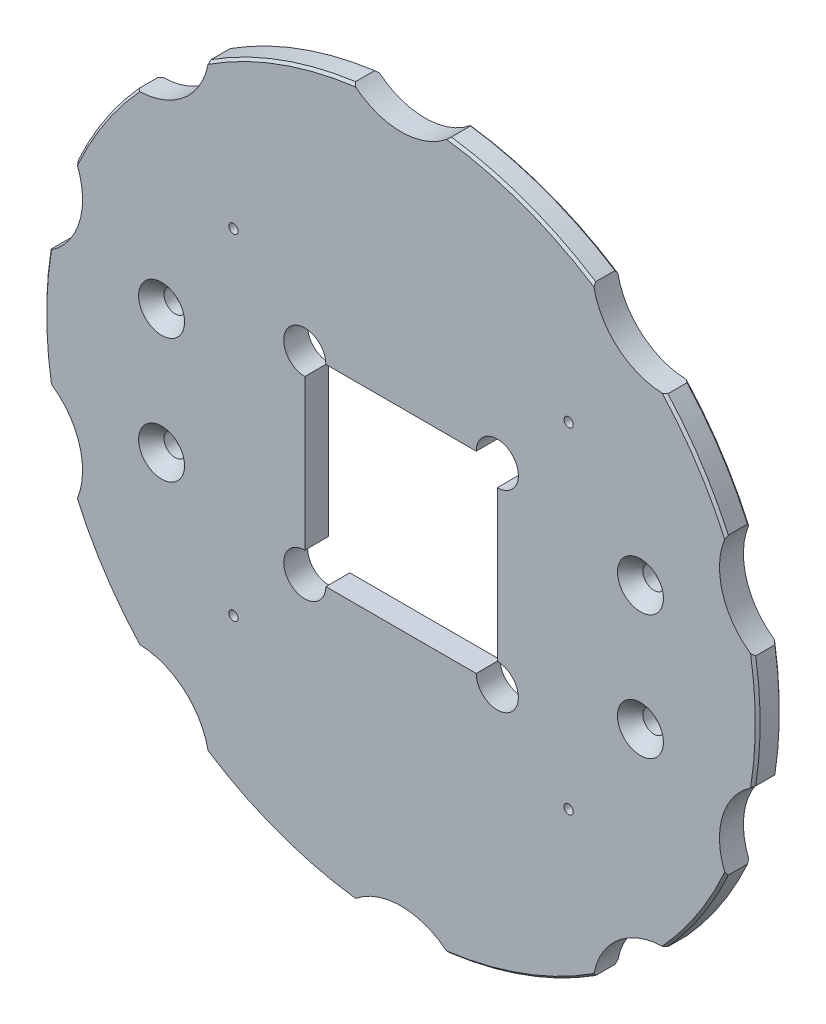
ISO-10303-21;
HEADER;
FILE_DESCRIPTION(('STEP AP214'),'2;1');
FILE_NAME('part.step','',(''),(''),'','','');
FILE_SCHEMA(('AUTOMOTIVE_DESIGN { 1 0 10303 214 1 1 1 1 }'));
ENDSEC;
DATA;
#1=APPLICATION_CONTEXT('core data for automotive mechanical design processes');
#2=APPLICATION_PROTOCOL_DEFINITION('international standard','automotive_design',2000,#1);
#3=PRODUCT_CONTEXT('',#1,'mechanical');
#4=PRODUCT('Part','Part','',(#3));
#5=PRODUCT_RELATED_PRODUCT_CATEGORY('part','',(#4));
#6=PRODUCT_DEFINITION_FORMATION('','',#4);
#7=PRODUCT_DEFINITION_CONTEXT('part definition',#1,'design');
#8=PRODUCT_DEFINITION('design','',#6,#7);
#9=PRODUCT_DEFINITION_SHAPE('','',#8);
#10=(LENGTH_UNIT() NAMED_UNIT(*) SI_UNIT(.MILLI.,.METRE.));
#11=(NAMED_UNIT(*) PLANE_ANGLE_UNIT() SI_UNIT($,.RADIAN.));
#12=(NAMED_UNIT(*) SI_UNIT($,.STERADIAN.) SOLID_ANGLE_UNIT());
#13=UNCERTAINTY_MEASURE_WITH_UNIT(LENGTH_MEASURE(1.E-05),#10,'distance_accuracy_value','');
#14=(GEOMETRIC_REPRESENTATION_CONTEXT(3) GLOBAL_UNCERTAINTY_ASSIGNED_CONTEXT((#13)) GLOBAL_UNIT_ASSIGNED_CONTEXT((#10,
#11,#12)) REPRESENTATION_CONTEXT('',''));
#15=CARTESIAN_POINT('',(0.,0.,0.));
#16=DIRECTION('',(0.,0.,1.));
#17=DIRECTION('',(1.,0.,0.));
#18=AXIS2_PLACEMENT_3D('',#15,#16,#17);
#19=CARTESIAN_POINT('',(0.,0.,12.7));
#20=DIRECTION('',(0.,0.,1.));
#21=DIRECTION('',(1.,0.,0.));
#22=AXIS2_PLACEMENT_3D('',#19,#20,#21);
#23=PLANE('',#22);
#24=CARTESIAN_POINT('',(-88.9,-88.9,12.7));
#25=DIRECTION('',(0.,0.,1.));
#26=DIRECTION('',(1.,0.,0.));
#27=AXIS2_PLACEMENT_3D('',#24,#25,#26);
#28=CIRCLE('',#27,2.4511);
#29=CARTESIAN_POINT('',(-86.4489,-88.9,12.7));
#30=VERTEX_POINT('',#29);
#31=EDGE_CURVE('E1530',#30,#30,#28,.T.);
#32=ORIENTED_EDGE('',*,*,#31,.F.);
#33=EDGE_LOOP('',(#32));
#34=FACE_BOUND('',#33,.T.);
#35=CARTESIAN_POINT('',(88.9,-88.9,12.7));
#36=DIRECTION('',(0.,0.,1.));
#37=DIRECTION('',(1.,0.,0.));
#38=AXIS2_PLACEMENT_3D('',#35,#36,#37);
#39=CIRCLE('',#38,2.4511);
#40=CARTESIAN_POINT('',(91.3511,-88.9,12.7));
#41=VERTEX_POINT('',#40);
#42=EDGE_CURVE('E1524',#41,#41,#39,.T.);
#43=ORIENTED_EDGE('',*,*,#42,.F.);
#44=EDGE_LOOP('',(#43));
#45=FACE_BOUND('',#44,.T.);
#46=CARTESIAN_POINT('',(88.9,88.9,12.7));
#47=DIRECTION('',(0.,0.,1.));
#48=DIRECTION('',(1.,0.,0.));
#49=AXIS2_PLACEMENT_3D('',#46,#47,#48);
#50=CIRCLE('',#49,2.4511);
#51=CARTESIAN_POINT('',(91.3511,88.9,12.7));
#52=VERTEX_POINT('',#51);
#53=EDGE_CURVE('E1518',#52,#52,#50,.T.);
#54=ORIENTED_EDGE('',*,*,#53,.F.);
#55=EDGE_LOOP('',(#54));
#56=FACE_BOUND('',#55,.T.);
#57=CARTESIAN_POINT('',(-88.9,88.9,12.7));
#58=DIRECTION('',(0.,0.,1.));
#59=DIRECTION('',(1.,0.,0.));
#60=AXIS2_PLACEMENT_3D('',#57,#58,#59);
#61=CIRCLE('',#60,2.4511);
#62=CARTESIAN_POINT('',(-86.4489,88.9,12.7));
#63=VERTEX_POINT('',#62);
#64=EDGE_CURVE('E1512',#63,#63,#61,.T.);
#65=ORIENTED_EDGE('',*,*,#64,.F.);
#66=EDGE_LOOP('',(#65));
#67=FACE_BOUND('',#66,.T.);
#68=CARTESIAN_POINT('',(127.,-33.02,12.7));
#69=DIRECTION('',(0.,0.,1.));
#70=DIRECTION('',(1.,0.,0.));
#71=AXIS2_PLACEMENT_3D('',#68,#69,#70);
#72=CIRCLE('',#71,12.192);
#73=CARTESIAN_POINT('',(139.192,-33.02,12.7));
#74=VERTEX_POINT('',#73);
#75=EDGE_CURVE('E1505',#74,#74,#72,.T.);
#76=ORIENTED_EDGE('',*,*,#75,.F.);
#77=EDGE_LOOP('',(#76));
#78=FACE_BOUND('',#77,.T.);
#79=CARTESIAN_POINT('',(127.,33.02,12.7));
#80=DIRECTION('',(0.,0.,1.));
#81=DIRECTION('',(1.,0.,0.));
#82=AXIS2_PLACEMENT_3D('',#79,#80,#81);
#83=CIRCLE('',#82,12.192);
#84=CARTESIAN_POINT('',(139.192,33.02,12.7));
#85=VERTEX_POINT('',#84);
#86=EDGE_CURVE('E1498',#85,#85,#83,.T.);
#87=ORIENTED_EDGE('',*,*,#86,.F.);
#88=EDGE_LOOP('',(#87));
#89=FACE_BOUND('',#88,.T.);
#90=CARTESIAN_POINT('',(-127.,-33.02,12.7));
#91=DIRECTION('',(0.,0.,1.));
#92=DIRECTION('',(1.,0.,0.));
#93=AXIS2_PLACEMENT_3D('',#90,#91,#92);
#94=CIRCLE('',#93,12.192);
#95=CARTESIAN_POINT('',(-114.808,-33.02,12.7));
#96=VERTEX_POINT('',#95);
#97=EDGE_CURVE('E1492',#96,#96,#94,.T.);
#98=ORIENTED_EDGE('',*,*,#97,.F.);
#99=EDGE_LOOP('',(#98));
#100=FACE_BOUND('',#99,.T.);
#101=CARTESIAN_POINT('',(-127.,33.02,12.7));
#102=DIRECTION('',(0.,0.,1.));
#103=DIRECTION('',(1.,0.,0.));
#104=AXIS2_PLACEMENT_3D('',#101,#102,#103);
#105=CIRCLE('',#104,12.192);
#106=CARTESIAN_POINT('',(-114.808,33.02,12.7));
#107=VERTEX_POINT('',#106);
#108=EDGE_CURVE('E945',#107,#107,#105,.T.);
#109=ORIENTED_EDGE('',*,*,#108,.F.);
#110=EDGE_LOOP('',(#109));
#111=FACE_BOUND('',#110,.T.);
#112=CARTESIAN_POINT('',(-207.01,-62.2300000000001,12.7));
#113=DIRECTION('',(0.,0.,-1.));
#114=DIRECTION('',(-1.,0.,0.));
#115=AXIS2_PLACEMENT_3D('',#112,#113,#114);
#116=CIRCLE('',#115,38.1);
#117=CARTESIAN_POINT('',(-185.412164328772,-30.8430043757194,12.7));
#118=VERTEX_POINT('',#117);
#119=CARTESIAN_POINT('',(-171.685444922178,-76.5053566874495,12.7));
#120=VERTEX_POINT('',#119);
#121=EDGE_CURVE('E991',#118,#120,#116,.T.);
#122=ORIENTED_EDGE('',*,*,#121,.T.);
#123=CARTESIAN_POINT('',(0.,0.,12.7));
#124=DIRECTION('',(0.,0.,1.));
#125=DIRECTION('',(1.,0.,0.));
#126=AXIS2_PLACEMENT_3D('',#123,#124,#125);
#127=CIRCLE('',#126,187.96);
#128=CARTESIAN_POINT('',(-138.547956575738,-127.017421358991,12.7));
#129=VERTEX_POINT('',#128);
#130=EDGE_CURVE('E1367',#120,#129,#127,.T.);
#131=ORIENTED_EDGE('',*,*,#130,.T.);
#132=CARTESIAN_POINT('',(-139.7,-165.1,12.7));
#133=DIRECTION('',(0.,0.,-1.));
#134=DIRECTION('',(1.,0.,0.));
#135=AXIS2_PLACEMENT_3D('',#132,#133,#134);
#136=CIRCLE('',#135,38.1);
#137=CARTESIAN_POINT('',(-102.333381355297,-157.660523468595,12.7));
#138=VERTEX_POINT('',#137);
#139=EDGE_CURVE('E1189',#129,#138,#136,.T.);
#140=ORIENTED_EDGE('',*,*,#139,.T.);
#141=CARTESIAN_POINT('',(-24.1188910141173,-186.406117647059,12.7));
#142=VERTEX_POINT('',#141);
#143=EDGE_CURVE('E1823',#138,#142,#127,.T.);
#144=ORIENTED_EDGE('',*,*,#143,.T.);
#145=CARTESIAN_POINT('',(0.,-215.9,12.7));
#146=DIRECTION('',(0.,0.,-1.));
#147=DIRECTION('',(1.,0.,0.));
#148=AXIS2_PLACEMENT_3D('',#145,#146,#147);
#149=CIRCLE('',#148,38.1);
#150=CARTESIAN_POINT('',(24.1188910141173,-186.406117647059,12.7));
#151=VERTEX_POINT('',#150);
#152=EDGE_CURVE('E1225',#142,#151,#149,.T.);
#153=ORIENTED_EDGE('',*,*,#152,.T.);
#154=CARTESIAN_POINT('',(102.333381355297,-157.660523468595,12.7));
#155=VERTEX_POINT('',#154);
#156=EDGE_CURVE('E1825',#151,#155,#127,.T.);
#157=ORIENTED_EDGE('',*,*,#156,.T.);
#158=CARTESIAN_POINT('',(139.7,-165.1,12.7));
#159=DIRECTION('',(0.,0.,-1.));
#160=DIRECTION('',(1.,0.,0.));
#161=AXIS2_PLACEMENT_3D('',#158,#159,#160);
#162=CIRCLE('',#161,38.1);
#163=CARTESIAN_POINT('',(138.547956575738,-127.017421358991,12.7));
#164=VERTEX_POINT('',#163);
#165=EDGE_CURVE('E1172',#155,#164,#162,.T.);
#166=ORIENTED_EDGE('',*,*,#165,.T.);
#167=CARTESIAN_POINT('',(171.685444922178,-76.5053566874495,12.7));
#168=VERTEX_POINT('',#167);
#169=EDGE_CURVE('E1826',#164,#168,#127,.T.);
#170=ORIENTED_EDGE('',*,*,#169,.T.);
#171=CARTESIAN_POINT('',(207.01,-62.2300000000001,12.7));
#172=DIRECTION('',(0.,0.,-1.));
#173=DIRECTION('',(1.,0.,0.));
#174=AXIS2_PLACEMENT_3D('',#171,#172,#173);
#175=CIRCLE('',#174,38.1);
#176=CARTESIAN_POINT('',(185.412164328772,-30.8430043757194,12.7));
#177=VERTEX_POINT('',#176);
#178=EDGE_CURVE('E1790',#168,#177,#175,.T.);
#179=ORIENTED_EDGE('',*,*,#178,.T.);
#180=CARTESIAN_POINT('',(185.412164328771,30.8430043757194,12.7));
#181=VERTEX_POINT('',#180);
#182=EDGE_CURVE('E1828',#177,#181,#127,.T.);
#183=ORIENTED_EDGE('',*,*,#182,.T.);
#184=CARTESIAN_POINT('',(207.01,62.2300000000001,12.7));
#185=DIRECTION('',(0.,0.,1.));
#186=DIRECTION('',(1.,0.,0.));
#187=AXIS2_PLACEMENT_3D('',#184,#185,#186);
#188=CIRCLE('',#187,38.1);
#189=CARTESIAN_POINT('',(171.685444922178,76.5053566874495,12.7));
#190=VERTEX_POINT('',#189);
#191=EDGE_CURVE('E1268',#190,#181,#188,.T.);
#192=ORIENTED_EDGE('',*,*,#191,.F.);
#193=CARTESIAN_POINT('',(138.547956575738,127.017421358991,12.7));
#194=VERTEX_POINT('',#193);
#195=EDGE_CURVE('E1832',#190,#194,#127,.T.);
#196=ORIENTED_EDGE('',*,*,#195,.T.);
#197=CARTESIAN_POINT('',(139.7,165.1,12.7));
#198=DIRECTION('',(0.,0.,1.));
#199=DIRECTION('',(1.,0.,0.));
#200=AXIS2_PLACEMENT_3D('',#197,#198,#199);
#201=CIRCLE('',#200,38.1);
#202=CARTESIAN_POINT('',(102.333381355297,157.660523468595,12.7));
#203=VERTEX_POINT('',#202);
#204=EDGE_CURVE('E1293',#203,#194,#201,.T.);
#205=ORIENTED_EDGE('',*,*,#204,.F.);
#206=CARTESIAN_POINT('',(24.1188910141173,186.406117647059,12.7));
#207=VERTEX_POINT('',#206);
#208=EDGE_CURVE('E1362',#203,#207,#127,.T.);
#209=ORIENTED_EDGE('',*,*,#208,.T.);
#210=CARTESIAN_POINT('',(0.,215.9,12.7));
#211=DIRECTION('',(0.,0.,1.));
#212=DIRECTION('',(1.,0.,0.));
#213=AXIS2_PLACEMENT_3D('',#210,#211,#212);
#214=CIRCLE('',#213,38.1);
#215=CARTESIAN_POINT('',(-24.1188910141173,186.406117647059,12.7));
#216=VERTEX_POINT('',#215);
#217=EDGE_CURVE('E1333',#216,#207,#214,.T.);
#218=ORIENTED_EDGE('',*,*,#217,.F.);
#219=CARTESIAN_POINT('',(-102.333381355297,157.660523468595,12.7));
#220=VERTEX_POINT('',#219);
#221=EDGE_CURVE('E1363',#216,#220,#127,.T.);
#222=ORIENTED_EDGE('',*,*,#221,.T.);
#223=CARTESIAN_POINT('',(-139.7,165.1,12.7));
#224=DIRECTION('',(0.,0.,1.));
#225=DIRECTION('',(1.,0.,0.));
#226=AXIS2_PLACEMENT_3D('',#223,#224,#225);
#227=CIRCLE('',#226,38.1);
#228=CARTESIAN_POINT('',(-138.547956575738,127.017421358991,12.7));
#229=VERTEX_POINT('',#228);
#230=EDGE_CURVE('E1314',#229,#220,#227,.T.);
#231=ORIENTED_EDGE('',*,*,#230,.F.);
#232=CARTESIAN_POINT('',(-171.685444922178,76.5053566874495,12.7));
#233=VERTEX_POINT('',#232);
#234=EDGE_CURVE('E1366',#229,#233,#127,.T.);
#235=ORIENTED_EDGE('',*,*,#234,.T.);
#236=CARTESIAN_POINT('',(-207.01,62.2300000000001,12.7));
#237=DIRECTION('',(0.,0.,1.));
#238=DIRECTION('',(-1.,0.,0.));
#239=AXIS2_PLACEMENT_3D('',#236,#237,#238);
#240=CIRCLE('',#239,38.1);
#241=CARTESIAN_POINT('',(-185.412164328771,30.8430043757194,12.7));
#242=VERTEX_POINT('',#241);
#243=EDGE_CURVE('E1246',#242,#233,#240,.T.);
#244=ORIENTED_EDGE('',*,*,#243,.F.);
#245=EDGE_CURVE('E1827',#242,#118,#127,.T.);
#246=ORIENTED_EDGE('',*,*,#245,.T.);
#247=EDGE_LOOP('',(#122,#131,#140,#144,#153,#157,#166,#170,#179,#183,#192,#196,#205,#209,#218,
#222,#231,#235,#244,#246));
#248=FACE_BOUND('',#247,.T.);
#249=DIRECTION('',(-1.,0.,0.));
#250=VECTOR('',#249,1.);
#251=CARTESIAN_POINT('',(-39.878,51.054,12.7));
#252=LINE('',#251,#250);
#253=CARTESIAN_POINT('',(39.878,51.054,12.7));
#254=VERTEX_POINT('',#253);
#255=CARTESIAN_POINT('',(-39.878,51.054,12.7));
#256=VERTEX_POINT('',#255);
#257=EDGE_CURVE('E964',#254,#256,#252,.T.);
#258=ORIENTED_EDGE('',*,*,#257,.F.);
#259=CARTESIAN_POINT('',(51.054,51.054,12.7));
#260=DIRECTION('',(0.,0.,1.));
#261=DIRECTION('',(1.,0.,0.));
#262=AXIS2_PLACEMENT_3D('',#259,#260,#261);
#263=CIRCLE('',#262,11.176);
#264=CARTESIAN_POINT('',(51.054,39.878,12.7));
#265=VERTEX_POINT('',#264);
#266=EDGE_CURVE('E935',#265,#254,#263,.T.);
#267=ORIENTED_EDGE('',*,*,#266,.F.);
#268=DIRECTION('',(0.,1.,0.));
#269=VECTOR('',#268,1.);
#270=CARTESIAN_POINT('',(51.054,39.878,12.7));
#271=LINE('',#270,#269);
#272=CARTESIAN_POINT('',(51.054,-39.878,12.7));
#273=VERTEX_POINT('',#272);
#274=EDGE_CURVE('E976',#273,#265,#271,.T.);
#275=ORIENTED_EDGE('',*,*,#274,.F.);
#276=CARTESIAN_POINT('',(51.054,-51.054,12.7));
#277=DIRECTION('',(0.,0.,1.));
#278=DIRECTION('',(-1.,0.,0.));
#279=AXIS2_PLACEMENT_3D('',#276,#277,#278);
#280=CIRCLE('',#279,11.176);
#281=CARTESIAN_POINT('',(39.878,-51.054,12.7));
#282=VERTEX_POINT('',#281);
#283=EDGE_CURVE('E974',#282,#273,#280,.T.);
#284=ORIENTED_EDGE('',*,*,#283,.F.);
#285=DIRECTION('',(1.,0.,0.));
#286=VECTOR('',#285,1.);
#287=CARTESIAN_POINT('',(-39.878,-51.054,12.7));
#288=LINE('',#287,#286);
#289=CARTESIAN_POINT('',(-39.878,-51.054,12.7));
#290=VERTEX_POINT('',#289);
#291=EDGE_CURVE('E972',#290,#282,#288,.T.);
#292=ORIENTED_EDGE('',*,*,#291,.F.);
#293=CARTESIAN_POINT('',(-51.054,-51.054,12.7));
#294=DIRECTION('',(0.,0.,1.));
#295=DIRECTION('',(1.,0.,0.));
#296=AXIS2_PLACEMENT_3D('',#293,#294,#295);
#297=CIRCLE('',#296,11.176);
#298=CARTESIAN_POINT('',(-51.054,-39.878,12.7));
#299=VERTEX_POINT('',#298);
#300=EDGE_CURVE('E970',#299,#290,#297,.T.);
#301=ORIENTED_EDGE('',*,*,#300,.F.);
#302=DIRECTION('',(0.,-1.,0.));
#303=VECTOR('',#302,1.);
#304=CARTESIAN_POINT('',(-51.054,39.878,12.7));
#305=LINE('',#304,#303);
#306=CARTESIAN_POINT('',(-51.054,39.878,12.7));
#307=VERTEX_POINT('',#306);
#308=EDGE_CURVE('E968',#307,#299,#305,.T.);
#309=ORIENTED_EDGE('',*,*,#308,.F.);
#310=CARTESIAN_POINT('',(-51.054,51.054,12.7));
#311=DIRECTION('',(0.,0.,1.));
#312=DIRECTION('',(-1.,0.,0.));
#313=AXIS2_PLACEMENT_3D('',#310,#311,#312);
#314=CIRCLE('',#313,11.176);
#315=EDGE_CURVE('E966',#256,#307,#314,.T.);
#316=ORIENTED_EDGE('',*,*,#315,.F.);
#317=EDGE_LOOP('',(#258,#267,#275,#284,#292,#301,#309,#316));
#318=FACE_BOUND('',#317,.T.);
#319=ADVANCED_FACE('F614',(#34,#45,#56,#67,#78,#89,#100,#111,#248,#318),#23,.T.);
#320=CARTESIAN_POINT('',(0.,0.,0.));
#321=DIRECTION('',(0.,0.,1.));
#322=DIRECTION('',(1.,0.,0.));
#323=AXIS2_PLACEMENT_3D('',#320,#321,#322);
#324=PLANE('',#323);
#325=CARTESIAN_POINT('',(-88.9,-88.9,0.));
#326=DIRECTION('',(0.,0.,1.));
#327=DIRECTION('',(1.,0.,0.));
#328=AXIS2_PLACEMENT_3D('',#325,#326,#327);
#329=CIRCLE('',#328,2.4511);
#330=CARTESIAN_POINT('',(-86.4489,-88.9,0.));
#331=VERTEX_POINT('',#330);
#332=EDGE_CURVE('E1527',#331,#331,#329,.T.);
#333=ORIENTED_EDGE('',*,*,#332,.T.);
#334=EDGE_LOOP('',(#333));
#335=FACE_BOUND('',#334,.T.);
#336=CARTESIAN_POINT('',(88.9,-88.9,0.));
#337=DIRECTION('',(0.,0.,1.));
#338=DIRECTION('',(1.,0.,0.));
#339=AXIS2_PLACEMENT_3D('',#336,#337,#338);
#340=CIRCLE('',#339,2.4511);
#341=CARTESIAN_POINT('',(91.3511,-88.9,0.));
#342=VERTEX_POINT('',#341);
#343=EDGE_CURVE('E1521',#342,#342,#340,.T.);
#344=ORIENTED_EDGE('',*,*,#343,.T.);
#345=EDGE_LOOP('',(#344));
#346=FACE_BOUND('',#345,.T.);
#347=CARTESIAN_POINT('',(88.9,88.9,0.));
#348=DIRECTION('',(0.,0.,1.));
#349=DIRECTION('',(1.,0.,0.));
#350=AXIS2_PLACEMENT_3D('',#347,#348,#349);
#351=CIRCLE('',#350,2.4511);
#352=CARTESIAN_POINT('',(91.3511,88.9,0.));
#353=VERTEX_POINT('',#352);
#354=EDGE_CURVE('E1515',#353,#353,#351,.T.);
#355=ORIENTED_EDGE('',*,*,#354,.T.);
#356=EDGE_LOOP('',(#355));
#357=FACE_BOUND('',#356,.T.);
#358=CARTESIAN_POINT('',(-88.9,88.9,0.));
#359=DIRECTION('',(0.,0.,1.));
#360=DIRECTION('',(1.,0.,0.));
#361=AXIS2_PLACEMENT_3D('',#358,#359,#360);
#362=CIRCLE('',#361,2.4511);
#363=CARTESIAN_POINT('',(-86.4489,88.9,0.));
#364=VERTEX_POINT('',#363);
#365=EDGE_CURVE('E1509',#364,#364,#362,.T.);
#366=ORIENTED_EDGE('',*,*,#365,.T.);
#367=EDGE_LOOP('',(#366));
#368=FACE_BOUND('',#367,.T.);
#369=CARTESIAN_POINT('',(0.,0.,0.));
#370=DIRECTION('',(0.,0.,1.));
#371=DIRECTION('',(1.,0.,0.));
#372=AXIS2_PLACEMENT_3D('',#369,#370,#371);
#373=CIRCLE('',#372,187.96);
#374=CARTESIAN_POINT('',(-138.547956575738,-127.017421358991,0.));
#375=VERTEX_POINT('',#374);
#376=CARTESIAN_POINT('',(-171.685444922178,-76.5053566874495,0.));
#377=VERTEX_POINT('',#376);
#378=EDGE_CURVE('E1803',#375,#377,#373,.F.);
#379=ORIENTED_EDGE('',*,*,#378,.T.);
#380=CARTESIAN_POINT('',(-207.01,-62.2300000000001,0.));
#381=DIRECTION('',(0.,0.,-1.));
#382=DIRECTION('',(-1.,0.,0.));
#383=AXIS2_PLACEMENT_3D('',#380,#381,#382);
#384=CIRCLE('',#383,38.1);
#385=CARTESIAN_POINT('',(-185.412164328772,-30.8430043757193,0.));
#386=VERTEX_POINT('',#385);
#387=EDGE_CURVE('E936',#386,#377,#384,.T.);
#388=ORIENTED_EDGE('',*,*,#387,.F.);
#389=CARTESIAN_POINT('',(-185.412164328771,30.8430043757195,0.));
#390=VERTEX_POINT('',#389);
#391=EDGE_CURVE('E1383',#386,#390,#373,.F.);
#392=ORIENTED_EDGE('',*,*,#391,.T.);
#393=CARTESIAN_POINT('',(-207.01,62.2300000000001,0.));
#394=DIRECTION('',(0.,0.,1.));
#395=DIRECTION('',(-1.,0.,0.));
#396=AXIS2_PLACEMENT_3D('',#393,#394,#395);
#397=CIRCLE('',#396,38.1);
#398=CARTESIAN_POINT('',(-171.685444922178,76.5053566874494,0.));
#399=VERTEX_POINT('',#398);
#400=EDGE_CURVE('E1243',#390,#399,#397,.T.);
#401=ORIENTED_EDGE('',*,*,#400,.T.);
#402=CARTESIAN_POINT('',(-138.547956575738,127.017421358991,0.));
#403=VERTEX_POINT('',#402);
#404=EDGE_CURVE('E1806',#399,#403,#373,.F.);
#405=ORIENTED_EDGE('',*,*,#404,.T.);
#406=CARTESIAN_POINT('',(-139.7,165.1,0.));
#407=DIRECTION('',(0.,0.,1.));
#408=DIRECTION('',(1.,0.,0.));
#409=AXIS2_PLACEMENT_3D('',#406,#407,#408);
#410=CIRCLE('',#409,38.1);
#411=CARTESIAN_POINT('',(-102.333381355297,157.660523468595,0.));
#412=VERTEX_POINT('',#411);
#413=EDGE_CURVE('E1312',#403,#412,#410,.T.);
#414=ORIENTED_EDGE('',*,*,#413,.T.);
#415=CARTESIAN_POINT('',(-24.1188910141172,186.406117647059,0.));
#416=VERTEX_POINT('',#415);
#417=EDGE_CURVE('E1376',#412,#416,#373,.F.);
#418=ORIENTED_EDGE('',*,*,#417,.T.);
#419=CARTESIAN_POINT('',(0.,215.9,0.));
#420=DIRECTION('',(0.,0.,1.));
#421=DIRECTION('',(1.,0.,0.));
#422=AXIS2_PLACEMENT_3D('',#419,#420,#421);
#423=CIRCLE('',#422,38.1);
#424=CARTESIAN_POINT('',(24.1188910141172,186.406117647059,0.));
#425=VERTEX_POINT('',#424);
#426=EDGE_CURVE('E1331',#416,#425,#423,.T.);
#427=ORIENTED_EDGE('',*,*,#426,.T.);
#428=CARTESIAN_POINT('',(102.333381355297,157.660523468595,0.));
#429=VERTEX_POINT('',#428);
#430=EDGE_CURVE('E1379',#425,#429,#373,.F.);
#431=ORIENTED_EDGE('',*,*,#430,.T.);
#432=CARTESIAN_POINT('',(139.7,165.1,0.));
#433=DIRECTION('',(0.,0.,1.));
#434=DIRECTION('',(1.,0.,0.));
#435=AXIS2_PLACEMENT_3D('',#432,#433,#434);
#436=CIRCLE('',#435,38.1);
#437=CARTESIAN_POINT('',(138.547956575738,127.017421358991,0.));
#438=VERTEX_POINT('',#437);
#439=EDGE_CURVE('E1287',#429,#438,#436,.T.);
#440=ORIENTED_EDGE('',*,*,#439,.T.);
#441=CARTESIAN_POINT('',(171.685444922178,76.5053566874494,0.));
#442=VERTEX_POINT('',#441);
#443=EDGE_CURVE('E1382',#438,#442,#373,.F.);
#444=ORIENTED_EDGE('',*,*,#443,.T.);
#445=CARTESIAN_POINT('',(207.01,62.2300000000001,0.));
#446=DIRECTION('',(0.,0.,1.));
#447=DIRECTION('',(1.,0.,0.));
#448=AXIS2_PLACEMENT_3D('',#445,#446,#447);
#449=CIRCLE('',#448,38.1);
#450=CARTESIAN_POINT('',(185.412164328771,30.8430043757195,0.));
#451=VERTEX_POINT('',#450);
#452=EDGE_CURVE('E1263',#442,#451,#449,.T.);
#453=ORIENTED_EDGE('',*,*,#452,.T.);
#454=CARTESIAN_POINT('',(185.412164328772,-30.8430043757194,0.));
#455=VERTEX_POINT('',#454);
#456=EDGE_CURVE('E1809',#451,#455,#373,.F.);
#457=ORIENTED_EDGE('',*,*,#456,.T.);
#458=CARTESIAN_POINT('',(207.01,-62.2300000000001,0.));
#459=DIRECTION('',(0.,0.,-1.));
#460=DIRECTION('',(1.,0.,0.));
#461=AXIS2_PLACEMENT_3D('',#458,#459,#460);
#462=CIRCLE('',#461,38.1);
#463=CARTESIAN_POINT('',(171.685444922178,-76.5053566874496,0.));
#464=VERTEX_POINT('',#463);
#465=EDGE_CURVE('E1794',#464,#455,#462,.T.);
#466=ORIENTED_EDGE('',*,*,#465,.F.);
#467=CARTESIAN_POINT('',(138.547956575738,-127.017421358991,0.));
#468=VERTEX_POINT('',#467);
#469=EDGE_CURVE('E1785',#464,#468,#373,.F.);
#470=ORIENTED_EDGE('',*,*,#469,.T.);
#471=CARTESIAN_POINT('',(139.7,-165.1,0.));
#472=DIRECTION('',(0.,0.,-1.));
#473=DIRECTION('',(1.,0.,0.));
#474=AXIS2_PLACEMENT_3D('',#471,#472,#473);
#475=CIRCLE('',#474,38.1);
#476=CARTESIAN_POINT('',(102.333381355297,-157.660523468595,0.));
#477=VERTEX_POINT('',#476);
#478=EDGE_CURVE('E1169',#477,#468,#475,.T.);
#479=ORIENTED_EDGE('',*,*,#478,.F.);
#480=CARTESIAN_POINT('',(24.1188910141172,-186.406117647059,0.));
#481=VERTEX_POINT('',#480);
#482=EDGE_CURVE('E1808',#477,#481,#373,.F.);
#483=ORIENTED_EDGE('',*,*,#482,.T.);
#484=CARTESIAN_POINT('',(0.,-215.9,0.));
#485=DIRECTION('',(0.,0.,-1.));
#486=DIRECTION('',(1.,0.,0.));
#487=AXIS2_PLACEMENT_3D('',#484,#485,#486);
#488=CIRCLE('',#487,38.1);
#489=CARTESIAN_POINT('',(-24.1188910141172,-186.406117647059,0.));
#490=VERTEX_POINT('',#489);
#491=EDGE_CURVE('E1221',#490,#481,#488,.T.);
#492=ORIENTED_EDGE('',*,*,#491,.F.);
#493=CARTESIAN_POINT('',(-102.333381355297,-157.660523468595,0.));
#494=VERTEX_POINT('',#493);
#495=EDGE_CURVE('E1807',#490,#494,#373,.F.);
#496=ORIENTED_EDGE('',*,*,#495,.T.);
#497=CARTESIAN_POINT('',(-139.7,-165.1,0.));
#498=DIRECTION('',(0.,0.,-1.));
#499=DIRECTION('',(1.,0.,0.));
#500=AXIS2_PLACEMENT_3D('',#497,#498,#499);
#501=CIRCLE('',#500,38.1);
#502=EDGE_CURVE('E1187',#375,#494,#501,.T.);
#503=ORIENTED_EDGE('',*,*,#502,.F.);
#504=EDGE_LOOP('',(#379,#388,#392,#401,#405,#414,#418,#427,#431,#440,#444,#453,#457,#466,#470,
#479,#483,#492,#496,#503));
#505=FACE_BOUND('',#504,.T.);
#506=CARTESIAN_POINT('',(127.,-33.02,0.));
#507=DIRECTION('',(0.,0.,1.));
#508=DIRECTION('',(1.,0.,0.));
#509=AXIS2_PLACEMENT_3D('',#506,#507,#508);
#510=CIRCLE('',#509,5.94360000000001);
#511=CARTESIAN_POINT('',(132.9436,-33.02,0.));
#512=VERTEX_POINT('',#511);
#513=EDGE_CURVE('E1348',#512,#512,#510,.T.);
#514=ORIENTED_EDGE('',*,*,#513,.T.);
#515=EDGE_LOOP('',(#514));
#516=FACE_BOUND('',#515,.T.);
#517=CARTESIAN_POINT('',(-127.,-33.02,0.));
#518=DIRECTION('',(0.,0.,1.));
#519=DIRECTION('',(1.,0.,0.));
#520=AXIS2_PLACEMENT_3D('',#517,#518,#519);
#521=CIRCLE('',#520,5.94359999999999);
#522=CARTESIAN_POINT('',(-121.0564,-33.02,0.));
#523=VERTEX_POINT('',#522);
#524=EDGE_CURVE('E1350',#523,#523,#521,.T.);
#525=ORIENTED_EDGE('',*,*,#524,.T.);
#526=EDGE_LOOP('',(#525));
#527=FACE_BOUND('',#526,.T.);
#528=CARTESIAN_POINT('',(-127.,33.02,0.));
#529=DIRECTION('',(0.,0.,1.));
#530=DIRECTION('',(1.,0.,0.));
#531=AXIS2_PLACEMENT_3D('',#528,#529,#530);
#532=CIRCLE('',#531,5.94359999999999);
#533=CARTESIAN_POINT('',(-121.0564,33.02,0.));
#534=VERTEX_POINT('',#533);
#535=EDGE_CURVE('E1354',#534,#534,#532,.T.);
#536=ORIENTED_EDGE('',*,*,#535,.T.);
#537=EDGE_LOOP('',(#536));
#538=FACE_BOUND('',#537,.T.);
#539=CARTESIAN_POINT('',(127.,33.02,0.));
#540=DIRECTION('',(0.,0.,1.));
#541=DIRECTION('',(1.,0.,0.));
#542=AXIS2_PLACEMENT_3D('',#539,#540,#541);
#543=CIRCLE('',#542,5.94360000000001);
#544=CARTESIAN_POINT('',(132.9436,33.02,0.));
#545=VERTEX_POINT('',#544);
#546=EDGE_CURVE('E1359',#545,#545,#543,.T.);
#547=ORIENTED_EDGE('',*,*,#546,.T.);
#548=EDGE_LOOP('',(#547));
#549=FACE_BOUND('',#548,.T.);
#550=CARTESIAN_POINT('',(51.054,51.054,0.));
#551=DIRECTION('',(0.,0.,1.));
#552=DIRECTION('',(1.,0.,0.));
#553=AXIS2_PLACEMENT_3D('',#550,#551,#552);
#554=CIRCLE('',#553,11.176);
#555=CARTESIAN_POINT('',(51.054,39.878,0.));
#556=VERTEX_POINT('',#555);
#557=CARTESIAN_POINT('',(39.878,51.054,0.));
#558=VERTEX_POINT('',#557);
#559=EDGE_CURVE('E639',#556,#558,#554,.T.);
#560=ORIENTED_EDGE('',*,*,#559,.T.);
#561=DIRECTION('',(-1.,0.,0.));
#562=VECTOR('',#561,1.);
#563=CARTESIAN_POINT('',(-39.878,51.054,0.));
#564=LINE('',#563,#562);
#565=CARTESIAN_POINT('',(-39.878,51.054,0.));
#566=VERTEX_POINT('',#565);
#567=EDGE_CURVE('E922',#558,#566,#564,.T.);
#568=ORIENTED_EDGE('',*,*,#567,.T.);
#569=CARTESIAN_POINT('',(-51.054,51.054,0.));
#570=DIRECTION('',(0.,0.,1.));
#571=DIRECTION('',(-1.,0.,0.));
#572=AXIS2_PLACEMENT_3D('',#569,#570,#571);
#573=CIRCLE('',#572,11.176);
#574=CARTESIAN_POINT('',(-51.054,39.878,0.));
#575=VERTEX_POINT('',#574);
#576=EDGE_CURVE('E931',#566,#575,#573,.T.);
#577=ORIENTED_EDGE('',*,*,#576,.T.);
#578=DIRECTION('',(0.,-1.,0.));
#579=VECTOR('',#578,1.);
#580=CARTESIAN_POINT('',(-51.054,39.878,0.));
#581=LINE('',#580,#579);
#582=CARTESIAN_POINT('',(-51.054,-39.878,0.));
#583=VERTEX_POINT('',#582);
#584=EDGE_CURVE('E951',#575,#583,#581,.T.);
#585=ORIENTED_EDGE('',*,*,#584,.T.);
#586=CARTESIAN_POINT('',(-51.054,-51.054,0.));
#587=DIRECTION('',(0.,0.,1.));
#588=DIRECTION('',(1.,0.,0.));
#589=AXIS2_PLACEMENT_3D('',#586,#587,#588);
#590=CIRCLE('',#589,11.176);
#591=CARTESIAN_POINT('',(-39.878,-51.054,0.));
#592=VERTEX_POINT('',#591);
#593=EDGE_CURVE('E954',#583,#592,#590,.T.);
#594=ORIENTED_EDGE('',*,*,#593,.T.);
#595=DIRECTION('',(1.,0.,0.));
#596=VECTOR('',#595,1.);
#597=CARTESIAN_POINT('',(-39.878,-51.054,0.));
#598=LINE('',#597,#596);
#599=CARTESIAN_POINT('',(39.878,-51.054,0.));
#600=VERTEX_POINT('',#599);
#601=EDGE_CURVE('E957',#592,#600,#598,.T.);
#602=ORIENTED_EDGE('',*,*,#601,.T.);
#603=CARTESIAN_POINT('',(51.054,-51.054,0.));
#604=DIRECTION('',(0.,0.,1.));
#605=DIRECTION('',(-1.,0.,0.));
#606=AXIS2_PLACEMENT_3D('',#603,#604,#605);
#607=CIRCLE('',#606,11.176);
#608=CARTESIAN_POINT('',(51.054,-39.878,0.));
#609=VERTEX_POINT('',#608);
#610=EDGE_CURVE('E960',#600,#609,#607,.T.);
#611=ORIENTED_EDGE('',*,*,#610,.T.);
#612=DIRECTION('',(0.,1.,0.));
#613=VECTOR('',#612,1.);
#614=CARTESIAN_POINT('',(51.054,39.878,0.));
#615=LINE('',#614,#613);
#616=EDGE_CURVE('E941',#609,#556,#615,.T.);
#617=ORIENTED_EDGE('',*,*,#616,.T.);
#618=EDGE_LOOP('',(#560,#568,#577,#585,#594,#602,#611,#617));
#619=FACE_BOUND('',#618,.T.);
#620=ADVANCED_FACE('F939',(#335,#346,#357,#368,#505,#516,#527,#538,#549,#619),#324,.F.);
#621=CARTESIAN_POINT('',(0.,0.,12.7));
#622=DIRECTION('',(0.,0.,-1.));
#623=DIRECTION('',(-1.,0.,0.));
#624=AXIS2_PLACEMENT_3D('',#621,#622,#623);
#625=CYLINDRICAL_SURFACE('',#624,189.23);
#626=CARTESIAN_POINT('',(0.,0.,1.26999999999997));
#627=DIRECTION('',(0.,0.,1.));
#628=DIRECTION('',(1.,0.,0.));
#629=AXIS2_PLACEMENT_3D('',#626,#627,#628);
#630=CIRCLE('',#629,189.23);
#631=CARTESIAN_POINT('',(-186.853029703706,29.898799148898,1.26999999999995));
#632=VERTEX_POINT('',#631);
#633=CARTESIAN_POINT('',(-186.853029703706,-29.898799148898,1.26999999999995));
#634=VERTEX_POINT('',#633);
#635=EDGE_CURVE('E1773',#632,#634,#630,.T.);
#636=ORIENTED_EDGE('',*,*,#635,.T.);
#637=DIRECTION('',(0.,0.,-1.));
#638=VECTOR('',#637,1.);
#639=CARTESIAN_POINT('',(-186.853029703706,-29.898799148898,6.35));
#640=LINE('',#639,#638);
#641=CARTESIAN_POINT('',(-186.853029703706,-29.898799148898,11.43));
#642=VERTEX_POINT('',#641);
#643=EDGE_CURVE('E1025',#634,#642,#640,.F.);
#644=ORIENTED_EDGE('',*,*,#643,.T.);
#645=CARTESIAN_POINT('',(0.,0.,11.43));
#646=DIRECTION('',(0.,0.,1.));
#647=DIRECTION('',(1.,0.,0.));
#648=AXIS2_PLACEMENT_3D('',#645,#646,#647);
#649=CIRCLE('',#648,189.23);
#650=CARTESIAN_POINT('',(-186.853029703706,29.898799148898,11.43));
#651=VERTEX_POINT('',#650);
#652=EDGE_CURVE('E1372',#642,#651,#649,.F.);
#653=ORIENTED_EDGE('',*,*,#652,.T.);
#654=DIRECTION('',(0.,0.,-1.));
#655=VECTOR('',#654,1.);
#656=CARTESIAN_POINT('',(-186.853029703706,29.898799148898,6.35));
#657=LINE('',#656,#655);
#658=EDGE_CURVE('E1256',#632,#651,#657,.F.);
#659=ORIENTED_EDGE('',*,*,#658,.F.);
#660=EDGE_LOOP('',(#636,#644,#653,#659));
#661=FACE_BOUND('',#660,.T.);
#662=ADVANCED_FACE('F1458',(#661),#625,.T.);
#663=CARTESIAN_POINT('',(0.,0.,12.7));
#664=DIRECTION('',(0.,0.,-1.));
#665=DIRECTION('',(-1.,0.,0.));
#666=AXIS2_PLACEMENT_3D('',#663,#664,#665);
#667=CONICAL_SURFACE('',#666,187.96,0.785398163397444);
#668=CARTESIAN_POINT('',(-188.889936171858,-95.7452694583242,-11.1100748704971));
#669=CARTESIAN_POINT('',(-188.221642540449,-95.3839180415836,-10.3506284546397));
#670=CARTESIAN_POINT('',(-187.563867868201,-95.0024949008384,-9.5914592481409));
#671=CARTESIAN_POINT('',(-186.270699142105,-94.1998480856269,-8.07518741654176));
#672=CARTESIAN_POINT('',(-185.635303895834,-93.77862653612,-7.31808468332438));
#673=CARTESIAN_POINT('',(-184.384818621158,-92.894320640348,-5.80332285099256));
#674=CARTESIAN_POINT('',(-183.769855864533,-92.4310237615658,-5.04568257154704));
#675=CARTESIAN_POINT('',(-182.565268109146,-91.4645934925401,-3.53555077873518));
#676=CARTESIAN_POINT('',(-181.975646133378,-90.9614553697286,-2.78305988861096));
#677=CARTESIAN_POINT('',(-180.5398597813,-89.6579059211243,-0.916487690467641));
#678=CARTESIAN_POINT('',(-179.710187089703,-88.8330182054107,0.193363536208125));
#679=CARTESIAN_POINT('',(-178.116967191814,-87.0935154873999,2.39061150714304));
#680=CARTESIAN_POINT('',(-177.353437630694,-86.1788766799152,3.47800220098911));
#681=CARTESIAN_POINT('',(-175.901156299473,-84.2594380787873,5.62008704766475));
#682=CARTESIAN_POINT('',(-175.212303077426,-83.2547640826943,6.67482413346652));
#683=CARTESIAN_POINT('',(-174.241734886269,-81.6781679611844,8.22457566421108));
#684=CARTESIAN_POINT('',(-173.928688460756,-81.1410878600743,8.7357243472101));
#685=CARTESIAN_POINT('',(-173.324862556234,-80.0433085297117,9.7456172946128));
#686=CARTESIAN_POINT('',(-173.034081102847,-79.4826114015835,10.2443626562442));
#687=CARTESIAN_POINT('',(-172.384522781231,-78.1486486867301,11.3894404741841));
#688=CARTESIAN_POINT('',(-172.034879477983,-77.3661760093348,12.03030107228));
#689=CARTESIAN_POINT('',(-171.382101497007,-75.758326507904,13.2812733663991));
#690=CARTESIAN_POINT('',(-171.078965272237,-74.9329511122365,13.8913860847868));
#691=CARTESIAN_POINT('',(-170.524554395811,-73.2397749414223,15.0737812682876));
#692=CARTESIAN_POINT('',(-170.273234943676,-72.3720116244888,15.646096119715));
#693=CARTESIAN_POINT('',(-169.828113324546,-70.5940124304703,16.745440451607));
#694=CARTESIAN_POINT('',(-169.634298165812,-69.683786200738,17.2724801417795));
#695=CARTESIAN_POINT('',(-169.345543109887,-68.0221774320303,18.1647031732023));
#696=CARTESIAN_POINT('',(-169.238315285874,-67.2785537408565,18.540369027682));
#697=CARTESIAN_POINT('',(-169.067002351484,-65.7678817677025,19.2526829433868));
#698=CARTESIAN_POINT('',(-169.002915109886,-65.0008346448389,19.5893329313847));
#699=CARTESIAN_POINT('',(-168.921500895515,-63.4469087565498,20.2175501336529));
#700=CARTESIAN_POINT('',(-168.904123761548,-62.6600521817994,20.5091653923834));
#701=CARTESIAN_POINT('',(-168.919374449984,-61.0698003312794,21.0417526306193));
#702=CARTESIAN_POINT('',(-168.951993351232,-60.2664080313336,21.2827336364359));
#703=CARTESIAN_POINT('',(-169.060479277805,-58.7794515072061,21.6738581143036));
#704=CARTESIAN_POINT('',(-169.128501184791,-58.0975147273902,21.8323888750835));
#705=CARTESIAN_POINT('',(-169.302783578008,-56.7299295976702,22.1067547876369));
#706=CARTESIAN_POINT('',(-169.409040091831,-56.0442816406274,22.2225943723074));
#707=CARTESIAN_POINT('',(-169.660231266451,-54.6742382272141,22.4090803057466));
#708=CARTESIAN_POINT('',(-169.805146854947,-53.9898423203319,22.4797488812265));
#709=CARTESIAN_POINT('',(-170.133394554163,-52.6270219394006,22.5743845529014));
#710=CARTESIAN_POINT('',(-170.316727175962,-51.9485975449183,22.5983510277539));
#711=CARTESIAN_POINT('',(-170.720924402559,-50.6021163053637,22.5990174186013));
#712=CARTESIAN_POINT('',(-170.941833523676,-49.9340727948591,22.5756609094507));
#713=CARTESIAN_POINT('',(-171.419113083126,-48.6141525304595,22.4821175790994));
#714=CARTESIAN_POINT('',(-171.675483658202,-47.962275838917,22.4119305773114));
#715=CARTESIAN_POINT('',(-172.221216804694,-46.678890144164,22.2262912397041));
#716=CARTESIAN_POINT('',(-172.510590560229,-46.0473881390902,22.1108235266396));
#717=CARTESIAN_POINT('',(-173.119271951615,-44.8086077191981,21.8370820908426));
#718=CARTESIAN_POINT('',(-173.438580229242,-44.2013298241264,21.6788074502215));
#719=CARTESIAN_POINT('',(-174.103474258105,-43.0145731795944,21.3227679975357));
#720=CARTESIAN_POINT('',(-174.449023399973,-42.4350574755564,21.1250575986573));
#721=CARTESIAN_POINT('',(-175.163598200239,-41.3048049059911,20.6934128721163));
#722=CARTESIAN_POINT('',(-175.53262366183,-40.7540677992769,20.4594788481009));
#723=CARTESIAN_POINT('',(-176.29127570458,-39.6822446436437,19.9587941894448));
#724=CARTESIAN_POINT('',(-176.680909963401,-39.1611697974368,19.69203127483));
#725=CARTESIAN_POINT('',(-177.478021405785,-38.149148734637,19.1290942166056));
#726=CARTESIAN_POINT('',(-177.885506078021,-37.6582153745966,18.8329076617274));
#727=CARTESIAN_POINT('',(-178.851787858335,-36.5506713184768,18.1130769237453));
#728=CARTESIAN_POINT('',(-179.41641150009,-35.9455959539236,17.6794714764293));
#729=CARTESIAN_POINT('',(-180.567376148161,-34.7879882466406,16.7732946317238));
#730=CARTESIAN_POINT('',(-181.153715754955,-34.2354525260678,16.3007257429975));
#731=CARTESIAN_POINT('',(-182.343991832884,-33.1812483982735,15.3226486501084));
#732=CARTESIAN_POINT('',(-182.947925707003,-32.679572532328,14.8171452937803));
#733=CARTESIAN_POINT('',(-184.169967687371,-31.7251829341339,13.7783986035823));
#734=CARTESIAN_POINT('',(-184.788072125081,-31.27245669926,13.2451624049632));
#735=CARTESIAN_POINT('',(-185.88916831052,-30.5147668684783,12.2833233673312));
#736=CARTESIAN_POINT('',(-186.369771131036,-30.2000831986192,11.8595849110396));
#737=CARTESIAN_POINT('',(-187.298825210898,-29.6208711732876,11.0337172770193));
#738=CARTESIAN_POINT('',(-187.746842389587,-29.3543448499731,10.6324992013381));
#739=CARTESIAN_POINT('',(-188.647148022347,-28.8431212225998,9.82088231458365));
#740=CARTESIAN_POINT('',(-189.09943722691,-28.5984278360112,9.410481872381));
#741=CARTESIAN_POINT('',(-190.008912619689,-28.1296248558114,8.58039989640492));
#742=CARTESIAN_POINT('',(-190.466109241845,-27.9055773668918,8.1606947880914));
#743=CARTESIAN_POINT('',(-191.383423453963,-27.4783700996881,7.31419735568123));
#744=CARTESIAN_POINT('',(-191.843540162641,-27.2752043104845,6.88740711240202));
#745=CARTESIAN_POINT('',(-192.304912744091,-27.0821635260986,6.45746900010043));
#746=B_SPLINE_CURVE_WITH_KNOTS('',3,(#668,#669,#670,#671,#672,#673,#674,#675,#676,#677,#678,
#679,#680,#681,#682,#683,#684,#685,#686,#687,#688,#689,#690,#691,#692,#693,#694,#695,#696,#697,
#698,#699,#700,#701,#702,#703,#704,#705,#706,#707,#708,#709,#710,#711,#712,#713,#714,#715,#716,
#717,#718,#719,#720,#721,#722,#723,#724,#725,#726,#727,#728,#729,#730,#731,#732,#733,#734,#735,
#736,#737,#738,#739,#740,#741,#742,#743,#744,#745),.UNSPECIFIED.,.F.,.F.,(4,2,2,2,2,2,2,2,2,2,2,
2,2,2,2,2,2,2,2,2,2,2,2,2,2,2,2,2,2,2,2,2,2,2,2,2,2,2,4),(0.,3.22243711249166,6.44470226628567,
9.68426028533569,12.9242036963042,17.7580420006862,22.5931658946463,27.4216364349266,
29.8354541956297,32.2490576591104,35.4573152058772,38.6654660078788,41.870831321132,
45.0754719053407,47.5933943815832,50.1111924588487,52.6262856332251,55.140930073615,
57.2490026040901,59.3568561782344,61.4636717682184,63.5705153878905,65.6798725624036,
67.7892378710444,69.8993201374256,72.0094476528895,74.1166835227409,76.2239017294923,
78.3319105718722,80.4408124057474,83.2407991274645,86.0406057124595,88.8400011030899,
91.6386797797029,93.7795682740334,95.7525759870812,97.7259370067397,99.705052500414,
101.683596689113),.UNSPECIFIED.);
#747=CARTESIAN_POINT('',(-172.36684292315,-78.0875429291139,11.43));
#748=VERTEX_POINT('',#747);
#749=EDGE_CURVE('E1019',#748,#120,#746,.T.);
#750=ORIENTED_EDGE('',*,*,#749,.F.);
#751=CARTESIAN_POINT('',(-140.277866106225,-127.004382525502,11.43));
#752=VERTEX_POINT('',#751);
#753=EDGE_CURVE('E1841',#752,#748,#649,.F.);
#754=ORIENTED_EDGE('',*,*,#753,.F.);
#755=CARTESIAN_POINT('',(-138.547677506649,-127.017429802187,12.7002));
#756=CARTESIAN_POINT('',(-138.693063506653,-127.013030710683,12.596006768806));
#757=CARTESIAN_POINT('',(-138.838160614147,-127.009473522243,12.4913754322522));
#758=CARTESIAN_POINT('',(-139.127753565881,-127.004022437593,12.2812761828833));
#759=CARTESIAN_POINT('',(-139.272249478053,-127.00212834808,12.1758083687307));
#760=CARTESIAN_POINT('',(-139.560650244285,-126.999981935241,11.964051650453));
#761=CARTESIAN_POINT('',(-139.704555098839,-126.99972961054,11.8577627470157));
#762=CARTESIAN_POINT('',(-139.99178459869,-127.000846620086,11.6443774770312));
#763=CARTESIAN_POINT('',(-140.135109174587,-127.002216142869,11.5372810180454));
#764=CARTESIAN_POINT('',(-140.278132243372,-127.004386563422,11.4298));
#765=B_SPLINE_CURVE_WITH_KNOTS('',3,(#755,#756,#757,#758,#759,#760,#761,#762,#763,#764),
.UNSPECIFIED.,.F.,.F.,(4,2,2,2,4),(0.,0.53675934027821,1.07345628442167,1.61015277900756,
2.14691166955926),.UNSPECIFIED.);
#766=EDGE_CURVE('E1132',#129,#752,#765,.T.);
#767=ORIENTED_EDGE('',*,*,#766,.F.);
#768=ORIENTED_EDGE('',*,*,#130,.F.);
#769=EDGE_LOOP('',(#750,#754,#767,#768));
#770=FACE_BOUND('',#769,.T.);
#771=ADVANCED_FACE('F1034',(#770),#667,.T.);
#772=CARTESIAN_POINT('',(0.,0.,1.26999999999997));
#773=DIRECTION('',(0.,0.,1.));
#774=DIRECTION('',(1.,0.,0.));
#775=AXIS2_PLACEMENT_3D('',#772,#773,#774);
#776=CONICAL_SURFACE('',#775,189.23,0.785398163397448);
#777=CARTESIAN_POINT('',(-192.304912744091,-27.0821635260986,6.24253099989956));
#778=CARTESIAN_POINT('',(-191.844063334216,-27.2749853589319,5.81308038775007));
#779=CARTESIAN_POINT('',(-191.384466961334,-27.4779093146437,5.38677055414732));
#780=CARTESIAN_POINT('',(-190.468199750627,-27.9045786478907,4.5412293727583));
#781=CARTESIAN_POINT('',(-190.011529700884,-28.1283294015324,4.12199988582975));
#782=CARTESIAN_POINT('',(-189.102051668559,-28.5970270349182,3.29189326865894));
#783=CARTESIAN_POINT('',(-188.649241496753,-28.8419608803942,2.88101119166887));
#784=CARTESIAN_POINT('',(-187.747888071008,-29.3537227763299,2.06843723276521));
#785=CARTESIAN_POINT('',(-187.299344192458,-29.620547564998,1.6667439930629));
#786=CARTESIAN_POINT('',(-186.369772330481,-30.2000825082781,0.840416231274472));
#787=CARTESIAN_POINT('',(-185.889173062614,-30.5147641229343,0.416681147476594));
#788=CARTESIAN_POINT('',(-184.731653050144,-31.311279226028,-0.594446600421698));
#789=CARTESIAN_POINT('',(-184.058201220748,-31.8072668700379,-1.17476647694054));
#790=CARTESIAN_POINT('',(-182.727874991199,-32.8581142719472,-2.30243627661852));
#791=CARTESIAN_POINT('',(-182.071020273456,-33.4130402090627,-2.84974803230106));
#792=CARTESIAN_POINT('',(-180.867060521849,-34.5041300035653,-3.83213974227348));
#793=CARTESIAN_POINT('',(-180.317176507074,-35.0325858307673,-4.27236131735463));
#794=CARTESIAN_POINT('',(-179.237186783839,-36.1363791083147,-5.11747385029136));
#795=CARTESIAN_POINT('',(-178.707084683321,-36.7117250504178,-5.52235838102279));
#796=CARTESIAN_POINT('',(-177.670998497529,-37.9100423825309,-6.29086284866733));
#797=CARTESIAN_POINT('',(-177.165016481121,-38.5330178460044,-6.65447924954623));
#798=CARTESIAN_POINT('',(-176.18229091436,-39.8263924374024,-7.33387413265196));
#799=CARTESIAN_POINT('',(-175.705542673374,-40.4967839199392,-7.64966030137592));
#800=CARTESIAN_POINT('',(-174.829737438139,-41.8189835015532,-8.19970375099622));
#801=CARTESIAN_POINT('',(-174.427579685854,-42.4667107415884,-8.43881431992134));
#802=CARTESIAN_POINT('',(-173.656581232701,-43.7976726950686,-8.86701009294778));
#803=CARTESIAN_POINT('',(-173.287738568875,-44.4809053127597,-9.05609824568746));
#804=CARTESIAN_POINT('',(-172.588474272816,-45.8782989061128,-9.37944000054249));
#805=CARTESIAN_POINT('',(-172.258006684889,-46.5924214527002,-9.51375968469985));
#806=CARTESIAN_POINT('',(-171.639377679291,-48.0471362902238,-9.72422946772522));
#807=CARTESIAN_POINT('',(-171.351214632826,-48.787727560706,-9.80038180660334));
#808=CARTESIAN_POINT('',(-170.826102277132,-50.2740612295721,-9.89138523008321));
#809=CARTESIAN_POINT('',(-170.588254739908,-51.0194137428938,-9.90741607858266));
#810=CARTESIAN_POINT('',(-170.159180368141,-52.5223828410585,-9.88098159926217));
#811=CARTESIAN_POINT('',(-169.967952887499,-53.279999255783,-9.83851708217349));
#812=CARTESIAN_POINT('',(-169.633227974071,-54.8007651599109,-9.69627884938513));
#813=CARTESIAN_POINT('',(-169.489756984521,-55.5639174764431,-9.59647346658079));
#814=CARTESIAN_POINT('',(-169.250615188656,-57.0885580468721,-9.34226654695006));
#815=CARTESIAN_POINT('',(-169.154946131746,-57.8500462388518,-9.1878630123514));
#816=CARTESIAN_POINT('',(-169.010773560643,-59.3595613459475,-8.82971165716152));
#817=CARTESIAN_POINT('',(-168.961916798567,-60.1076465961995,-8.6263481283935));
#818=CARTESIAN_POINT('',(-168.908117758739,-61.5914182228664,-8.17414163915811));
#819=CARTESIAN_POINT('',(-168.903174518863,-62.3271048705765,-7.92529967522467));
#820=CARTESIAN_POINT('',(-168.934685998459,-63.7826296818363,-7.38676204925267));
#821=CARTESIAN_POINT('',(-168.971155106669,-64.50246224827,-7.09705221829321));
#822=CARTESIAN_POINT('',(-169.082755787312,-65.9235503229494,-6.48140803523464));
#823=CARTESIAN_POINT('',(-169.157897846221,-66.6248007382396,-6.15546387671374));
#824=CARTESIAN_POINT('',(-169.318958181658,-67.8206169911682,-5.56386933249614));
#825=CARTESIAN_POINT('',(-169.396532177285,-68.320010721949,-5.30560382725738));
#826=CARTESIAN_POINT('',(-169.56972424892,-69.3072052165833,-4.77375660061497));
#827=CARTESIAN_POINT('',(-169.665338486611,-69.7950084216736,-4.50017814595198));
#828=CARTESIAN_POINT('',(-169.977813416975,-71.2411159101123,-3.65835881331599));
#829=CARTESIAN_POINT('',(-170.220271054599,-72.1818635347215,-3.06916121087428));
#830=CARTESIAN_POINT('',(-170.766286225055,-74.0164954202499,-1.84438008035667));
#831=CARTESIAN_POINT('',(-171.069965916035,-74.9102814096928,-1.20870545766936));
#832=CARTESIAN_POINT('',(-171.731655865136,-76.6492131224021,0.0996341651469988));
#833=CARTESIAN_POINT('',(-172.089665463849,-77.4943594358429,0.772298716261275));
#834=CARTESIAN_POINT('',(-172.754266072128,-78.9213583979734,1.96742943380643));
#835=CARTESIAN_POINT('',(-173.049758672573,-79.5141865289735,2.48308081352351));
#836=CARTESIAN_POINT('',(-173.665484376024,-80.6740892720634,3.52851445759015));
#837=CARTESIAN_POINT('',(-173.98571986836,-81.2411613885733,4.05829808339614));
#838=CARTESIAN_POINT('',(-174.649368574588,-82.3500709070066,5.13014921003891));
#839=CARTESIAN_POINT('',(-174.992791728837,-82.8918973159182,5.6722219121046));
#840=CARTESIAN_POINT('',(-175.70119332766,-83.9503611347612,6.76664609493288));
#841=CARTESIAN_POINT('',(-176.066171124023,-84.4669993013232,7.31899726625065));
#842=CARTESIAN_POINT('',(-177.192257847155,-85.9807009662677,8.99033418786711));
#843=CARTESIAN_POINT('',(-177.983944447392,-86.9405985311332,10.1226755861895));
#844=CARTESIAN_POINT('',(-179.639407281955,-88.7625284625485,12.4119021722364));
#845=CARTESIAN_POINT('',(-180.503161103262,-89.6245910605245,13.5687796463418));
#846=CARTESIAN_POINT('',(-181.975737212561,-90.9615355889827,15.4831773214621));
#847=CARTESIAN_POINT('',(-182.565457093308,-91.4647540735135,16.2357916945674));
#848=CARTESIAN_POINT('',(-183.770235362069,-92.4313192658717,17.7461543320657));
#849=CARTESIAN_POINT('',(-184.385290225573,-92.8946714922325,18.5039018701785));
#850=CARTESIAN_POINT('',(-185.6357773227,-93.778944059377,20.018650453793));
#851=CARTESIAN_POINT('',(-186.271075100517,-94.2000889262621,20.7756316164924));
#852=CARTESIAN_POINT('',(-187.564054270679,-95.0026031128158,22.2916744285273));
#853=CARTESIAN_POINT('',(-188.221737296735,-95.3839695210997,23.0507362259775));
#854=CARTESIAN_POINT('',(-188.889936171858,-95.7452694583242,23.8100748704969));
#855=B_SPLINE_CURVE_WITH_KNOTS('',3,(#777,#778,#779,#780,#781,#782,#783,#784,#785,#786,#787,
#788,#789,#790,#791,#792,#793,#794,#795,#796,#797,#798,#799,#800,#801,#802,#803,#804,#805,#806,
#807,#808,#809,#810,#811,#812,#813,#814,#815,#816,#817,#818,#819,#820,#821,#822,#823,#824,#825,
#826,#827,#828,#829,#830,#831,#832,#833,#834,#835,#836,#837,#838,#839,#840,#841,#842,#843,#844,
#845,#846,#847,#848,#849,#850,#851,#852,#853,#854),.UNSPECIFIED.,.F.,.F.,(4,2,2,2,2,2,2,2,2,2,2,
2,2,2,2,2,2,2,2,2,2,2,2,2,2,2,2,2,2,2,2,2,2,2,2,2,2,2,4),(0.,1.97630077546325,3.95311312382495,
5.92871764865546,7.90402833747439,10.0449168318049,13.0966636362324,16.1518740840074,
18.7916738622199,21.4319527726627,24.0724577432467,26.7125379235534,29.1068196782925,
31.5009602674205,33.8922035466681,36.2833547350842,38.6273312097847,40.9712751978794,
43.3165149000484,45.6618404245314,47.9893252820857,50.31675914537,52.6450019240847,
54.9738763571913,56.6759141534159,58.3775902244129,61.7817994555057,65.1928696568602,
68.6038984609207,71.121366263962,73.6390774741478,76.1578749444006,78.6765967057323,
83.71837545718,88.7585920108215,91.999055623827,95.2390699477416,98.460815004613,
101.682795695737),.UNSPECIFIED.);
#856=EDGE_CURVE('E1002',#634,#386,#855,.T.);
#857=ORIENTED_EDGE('',*,*,#856,.F.);
#858=ORIENTED_EDGE('',*,*,#635,.F.);
#859=CARTESIAN_POINT('',(-192.304912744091,27.0821635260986,6.24253099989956));
#860=CARTESIAN_POINT('',(-191.844063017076,27.2749854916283,5.81308009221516));
#861=CARTESIAN_POINT('',(-191.384466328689,27.4779095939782,5.38676996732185));
#862=CARTESIAN_POINT('',(-190.468198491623,27.9045792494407,4.5412282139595));
#863=CARTESIAN_POINT('',(-190.011528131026,28.128330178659,4.12199844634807));
#864=CARTESIAN_POINT('',(-189.102050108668,28.5970278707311,3.29189185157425));
#865=CARTESIAN_POINT('',(-188.649240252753,28.8419615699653,2.88101006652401));
#866=CARTESIAN_POINT('',(-187.747887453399,29.3537231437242,2.06843667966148));
#867=CARTESIAN_POINT('',(-187.29934388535,29.6205477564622,1.66674372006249));
#868=CARTESIAN_POINT('',(-186.369772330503,30.2000825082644,0.840416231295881));
#869=CARTESIAN_POINT('',(-185.889173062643,30.5147641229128,0.416681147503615));
#870=CARTESIAN_POINT('',(-184.731653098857,31.3112791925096,-0.59444655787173));
#871=CARTESIAN_POINT('',(-184.058201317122,31.8072667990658,-1.17476639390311));
#872=CARTESIAN_POINT('',(-182.727875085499,32.8581141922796,-2.3024361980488));
#873=CARTESIAN_POINT('',(-182.071020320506,33.4130401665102,-2.84974799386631));
#874=CARTESIAN_POINT('',(-180.867056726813,34.5041334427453,-3.83214283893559));
#875=CARTESIAN_POINT('',(-180.31716902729,35.0325930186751,-4.27236730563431));
#876=CARTESIAN_POINT('',(-179.237172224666,36.1363944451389,-5.11748510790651));
#877=CARTESIAN_POINT('',(-178.707066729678,36.7117447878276,-5.52237201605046));
#878=CARTESIAN_POINT('',(-177.670981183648,37.9100634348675,-6.29087537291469));
#879=CARTESIAN_POINT('',(-177.165002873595,38.5330351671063,-6.65448884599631));
#880=CARTESIAN_POINT('',(-176.182284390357,39.8264016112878,-7.3338784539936));
#881=CARTESIAN_POINT('',(-175.705539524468,40.4967886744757,-7.64966227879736));
#882=CARTESIAN_POINT('',(-174.829763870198,41.8189435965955,-8.19968715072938));
#883=CARTESIAN_POINT('',(-174.427630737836,42.4666285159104,-8.4387839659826));
#884=CARTESIAN_POINT('',(-173.656676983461,43.7975015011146,-8.86695891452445));
#885=CARTESIAN_POINT('',(-173.287854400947,44.4806874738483,-9.05603999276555));
#886=CARTESIAN_POINT('',(-172.588580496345,45.8780730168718,-9.37939556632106));
#887=CARTESIAN_POINT('',(-172.258088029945,46.5922381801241,-9.51372922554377));
#888=CARTESIAN_POINT('',(-171.639414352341,48.0470420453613,-9.72421977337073));
#889=CARTESIAN_POINT('',(-171.351231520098,48.7876797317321,-9.80037889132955));
#890=CARTESIAN_POINT('',(-170.826010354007,50.2743214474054,-9.89140114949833));
#891=CARTESIAN_POINT('',(-170.588086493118,51.0199410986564,-9.90742737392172));
#892=CARTESIAN_POINT('',(-170.158892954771,52.5234516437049,-9.88094220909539));
#893=CARTESIAN_POINT('',(-169.967622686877,53.2813423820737,-9.83843156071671));
#894=CARTESIAN_POINT('',(-169.632964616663,54.8021190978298,-9.69611202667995));
#895=CARTESIAN_POINT('',(-169.489569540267,55.5650042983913,-9.59631185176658));
#896=CARTESIAN_POINT('',(-169.250546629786,57.0891035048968,-9.34215598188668));
#897=CARTESIAN_POINT('',(-169.154920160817,57.8503174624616,-9.18779872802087));
#898=CARTESIAN_POINT('',(-169.010886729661,59.3583771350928,-8.82999255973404));
#899=CARTESIAN_POINT('',(-168.962070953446,60.1052903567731,-8.62698838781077));
#900=CARTESIAN_POINT('',(-168.908217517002,61.5867800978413,-8.17563269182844));
#901=CARTESIAN_POINT('',(-168.903180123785,62.3213565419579,-7.92728089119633));
#902=CARTESIAN_POINT('',(-168.934436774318,63.7770915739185,-7.38895595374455));
#903=CARTESIAN_POINT('',(-168.970879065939,64.4981926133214,-7.09883678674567));
#904=CARTESIAN_POINT('',(-169.08253706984,65.9215167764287,-6.48235386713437));
#905=CARTESIAN_POINT('',(-169.157753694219,66.6237394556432,-6.15598926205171));
#906=CARTESIAN_POINT('',(-169.387849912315,68.3321006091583,-5.310827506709));
#907=CARTESIAN_POINT('',(-169.563545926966,69.3263446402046,-4.77355715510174));
#908=CARTESIAN_POINT('',(-169.984094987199,71.2677104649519,-3.64230847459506));
#909=CARTESIAN_POINT('',(-170.229016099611,72.2147847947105,-3.04827471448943));
#910=CARTESIAN_POINT('',(-170.640838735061,73.5931237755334,-2.12644381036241));
#911=CARTESIAN_POINT('',(-170.784595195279,74.0431261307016,-1.81585609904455));
#912=CARTESIAN_POINT('',(-171.086318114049,74.9311409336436,-1.1845096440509));
#913=CARTESIAN_POINT('',(-171.244285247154,75.3691528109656,-0.863750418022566));
#914=CARTESIAN_POINT('',(-171.573259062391,76.2321497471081,-0.213851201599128));
#915=CARTESIAN_POINT('',(-171.744234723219,76.6571626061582,0.115267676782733));
#916=CARTESIAN_POINT('',(-172.09882827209,77.4952187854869,0.781675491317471));
#917=CARTESIAN_POINT('',(-172.282443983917,77.908264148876,1.11896301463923));
#918=CARTESIAN_POINT('',(-172.472051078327,78.3153997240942,1.45993093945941));
#919=B_SPLINE_CURVE_WITH_KNOTS('',3,(#859,#860,#861,#862,#863,#864,#865,#866,#867,#868,#869,
#870,#871,#872,#873,#874,#875,#876,#877,#878,#879,#880,#881,#882,#883,#884,#885,#886,#887,#888,
#889,#890,#891,#892,#893,#894,#895,#896,#897,#898,#899,#900,#901,#902,#903,#904,#905,#906,#907,
#908,#909,#910,#911,#912,#913,#914,#915,#916,#917,#918),.UNSPECIFIED.,.F.,.F.,(4,2,2,2,2,2,2,2,
2,2,2,2,2,2,2,2,2,2,2,2,2,2,2,2,2,2,2,2,2,4),(0.,1.97630213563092,3.95311584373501,
5.92871900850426,7.90402833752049,10.044916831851,13.0966634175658,16.1518740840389,
18.7916918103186,21.4319886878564,24.072475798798,26.7125379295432,29.1066677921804,
31.5006566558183,33.8920515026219,36.2833547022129,38.6281598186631,40.9729352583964,
43.3173542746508,45.6618402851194,47.9856594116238,50.3094927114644,52.6416575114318,
54.9738771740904,58.3997063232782,61.8289157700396,63.5246757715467,65.2205163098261,
66.9124324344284,68.6040579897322),.UNSPECIFIED.);
#920=EDGE_CURVE('E1805',#632,#390,#919,.T.);
#921=ORIENTED_EDGE('',*,*,#920,.T.);
#922=ORIENTED_EDGE('',*,*,#391,.F.);
#923=EDGE_LOOP('',(#857,#858,#921,#922));
#924=FACE_BOUND('',#923,.T.);
#925=ADVANCED_FACE('F1720',(#924),#776,.T.);
#926=CARTESIAN_POINT('',(192.304912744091,-27.0821635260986,6.45746900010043));
#927=CARTESIAN_POINT('',(191.838005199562,-27.2775209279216,6.89256476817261));
#928=CARTESIAN_POINT('',(191.372387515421,-27.4832450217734,7.32443352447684));
#929=CARTESIAN_POINT('',(190.444209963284,-27.9160507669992,8.18084917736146));
#930=CARTESIAN_POINT('',(189.981650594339,-28.1431358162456,8.60539489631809));
#931=CARTESIAN_POINT('',(189.059098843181,-28.6198034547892,9.44717756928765));
#932=CARTESIAN_POINT('',(188.599115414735,-28.8694393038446,9.8643942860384));
#933=CARTESIAN_POINT('',(187.683566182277,-29.3913552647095,10.6893038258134));
#934=CARTESIAN_POINT('',(187.228000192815,-29.6636344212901,11.0969970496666));
#935=CARTESIAN_POINT('',(185.856860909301,-30.5230735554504,12.3147851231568));
#936=CARTESIAN_POINT('',(184.949036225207,-31.1466010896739,13.1084355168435));
#937=CARTESIAN_POINT('',(183.162722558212,-32.4950349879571,14.6389145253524));
#938=CARTESIAN_POINT('',(182.284203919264,-33.2198347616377,15.3758016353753));
#939=CARTESIAN_POINT('',(180.865885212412,-34.5052000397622,16.5330958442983));
#940=CARTESIAN_POINT('',(180.314880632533,-35.0347972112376,16.9741981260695));
#941=CARTESIAN_POINT('',(179.503469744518,-35.8642952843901,17.609082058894));
#942=CARTESIAN_POINT('',(179.235514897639,-36.1466456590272,17.8162488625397));
#943=CARTESIAN_POINT('',(178.705046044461,-36.7232727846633,18.2210247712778));
#944=CARTESIAN_POINT('',(178.44253387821,-37.0175534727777,18.4186306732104));
#945=CARTESIAN_POINT('',(177.666091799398,-37.9160131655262,18.994411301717));
#946=CARTESIAN_POINT('',(177.161099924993,-38.5380043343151,19.3572411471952));
#947=CARTESIAN_POINT('',(176.180368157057,-39.8290920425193,20.0351488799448));
#948=CARTESIAN_POINT('',(175.704620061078,-40.4981752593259,20.3502401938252));
#949=CARTESIAN_POINT('',(174.829904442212,-41.8187327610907,20.8995984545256));
#950=CARTESIAN_POINT('',(174.427896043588,-42.4662016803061,21.138626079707));
#951=CARTESIAN_POINT('',(173.657176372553,-43.7966083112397,21.5666920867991));
#952=CARTESIAN_POINT('',(173.2884627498,-44.4795435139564,21.7557339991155));
#953=CARTESIAN_POINT('',(172.58914124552,-45.8768809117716,22.079160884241));
#954=CARTESIAN_POINT('',(172.258517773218,-46.5912700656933,22.2135682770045));
#955=CARTESIAN_POINT('',(171.639608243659,-48.046543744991,22.424168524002));
#956=CARTESIAN_POINT('',(171.35132069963,-48.7874273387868,22.5003634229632));
#957=CARTESIAN_POINT('',(170.826077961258,-50.274130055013,22.5913894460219));
#958=CARTESIAN_POINT('',(170.588210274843,-51.0195531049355,22.6074190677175));
#959=CARTESIAN_POINT('',(170.159104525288,-52.5226648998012,22.5809711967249));
#960=CARTESIAN_POINT('',(169.96786580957,-53.2803534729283,22.538494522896));
#961=CARTESIAN_POINT('',(169.633158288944,-54.8011232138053,22.3962347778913));
#962=CARTESIAN_POINT('',(169.489707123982,-55.5642062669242,22.2964305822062));
#963=CARTESIAN_POINT('',(169.250596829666,-57.0887042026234,22.0422369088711));
#964=CARTESIAN_POINT('',(169.154939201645,-57.8501190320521,21.8878457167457));
#965=CARTESIAN_POINT('',(169.010786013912,-59.3594307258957,21.5297426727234));
#966=CARTESIAN_POINT('',(168.961933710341,-60.1073865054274,21.3264189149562));
#967=CARTESIAN_POINT('',(168.908128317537,-61.5909207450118,20.8743017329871));
#968=CARTESIAN_POINT('',(168.903175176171,-62.3264992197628,20.6255083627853));
#969=CARTESIAN_POINT('',(168.934659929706,-63.7820615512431,20.0869876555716));
#970=CARTESIAN_POINT('',(168.971126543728,-64.5020342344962,19.7972320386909));
#971=CARTESIAN_POINT('',(169.082736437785,-65.9233682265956,19.1814925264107));
#972=CARTESIAN_POINT('',(169.157887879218,-66.6247255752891,18.8555009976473));
#973=CARTESIAN_POINT('',(169.306798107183,-67.7303334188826,18.308534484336));
#974=CARTESIAN_POINT('',(169.369095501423,-68.1412354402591,18.0976962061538));
#975=CARTESIAN_POINT('',(169.505984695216,-68.9552604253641,17.6655104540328));
#976=CARTESIAN_POINT('',(169.580573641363,-69.3583851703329,17.4441654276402));
#977=CARTESIAN_POINT('',(169.821975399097,-70.5561276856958,16.765434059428));
#978=CARTESIAN_POINT('',(170.006407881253,-71.3390027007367,16.2934067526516));
#979=CARTESIAN_POINT('',(170.417690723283,-72.8715238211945,15.3169194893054));
#980=CARTESIAN_POINT('',(170.644507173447,-73.6211959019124,14.8124856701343));
#981=CARTESIAN_POINT('',(171.136784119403,-75.0877002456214,13.7759931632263));
#982=CARTESIAN_POINT('',(171.402235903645,-75.8045398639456,13.2439407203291));
#983=CARTESIAN_POINT('',(171.902396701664,-77.042216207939,12.283315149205));
#984=CARTESIAN_POINT('',(172.129829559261,-77.5697633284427,11.8595596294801));
#985=CARTESIAN_POINT('',(172.401776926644,-78.1638597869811,11.3666861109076));
#986=CARTESIAN_POINT('',(172.436809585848,-78.2397301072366,11.3034427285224));
#987=CARTESIAN_POINT('',(173.035210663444,-79.5246013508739,10.2273568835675));
#988=CARTESIAN_POINT('',(173.651698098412,-80.6825511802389,9.18137486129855));
#989=CARTESIAN_POINT('',(174.645081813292,-82.3431481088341,7.57667580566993));
#990=CARTESIAN_POINT('',(174.987895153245,-82.8842835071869,7.03546110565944));
#991=CARTESIAN_POINT('',(175.695063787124,-83.9414954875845,5.9427072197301));
#992=CARTESIAN_POINT('',(176.059417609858,-84.4575737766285,5.39116874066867));
#993=CARTESIAN_POINT('',(177.185877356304,-85.97281196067,3.71885385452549));
#994=CARTESIAN_POINT('',(177.978727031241,-86.9345767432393,2.58465752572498));
#995=CARTESIAN_POINT('',(179.636677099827,-88.7598020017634,0.291755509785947));
#996=CARTESIAN_POINT('',(180.501745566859,-89.6233055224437,-0.866939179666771));
#997=CARTESIAN_POINT('',(181.976347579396,-90.9620899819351,-2.78397096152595));
#998=CARTESIAN_POINT('',(182.566705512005,-91.465819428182,-3.53738498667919));
#999=CARTESIAN_POINT('',(183.772832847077,-92.4333391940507,-5.04938234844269));
#1000=CARTESIAN_POINT('',(184.388599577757,-92.8971336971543,-5.80796513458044));
#1001=CARTESIAN_POINT('',(185.63921046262,-93.7812498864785,-7.32275462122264));
#1002=CARTESIAN_POINT('',(186.273868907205,-94.2018817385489,-8.07893388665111));
#1003=CARTESIAN_POINT('',(187.56549868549,-95.0034407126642,-9.59334146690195));
#1004=CARTESIAN_POINT('',(188.222470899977,-95.3843662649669,-10.3515698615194));
#1005=CARTESIAN_POINT('',(188.889936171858,-95.7452694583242,-11.1100748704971));
#1006=B_SPLINE_CURVE_WITH_KNOTS('',3,(#926,#927,#928,#929,#930,#931,#932,#933,#934,#935,#936,
#937,#938,#939,#940,#941,#942,#943,#944,#945,#946,#947,#948,#949,#950,#951,#952,#953,#954,#955,
#956,#957,#958,#959,#960,#961,#962,#963,#964,#965,#966,#967,#968,#969,#970,#971,#972,#973,#974,
#975,#976,#977,#978,#979,#980,#981,#982,#983,#984,#985,#986,#987,#988,#989,#990,#991,#992,#993,
#994,#995,#996,#997,#998,#999,#1000,#1001,#1002,#1003,#1004,#1005),.UNSPECIFIED.,.F.,.F.,(4,2,2,
2,2,2,2,2,2,2,2,2,2,2,2,2,2,2,2,2,2,2,2,2,2,2,2,2,2,2,2,2,2,2,2,2,2,2,2,4),(0.,2.00226774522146,
4.00485453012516,6.01230120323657,8.0196632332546,12.0872241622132,16.1505357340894,
18.7956950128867,20.1182802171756,21.4413054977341,24.0768488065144,26.7116494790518,
29.1049929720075,31.4981673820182,33.8903587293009,36.2824660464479,38.6266614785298,
40.9708241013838,43.3158510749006,45.6609517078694,47.9880326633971,50.3151108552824,
52.6438035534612,54.972987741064,56.3707273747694,57.7681429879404,60.5633482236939,
63.3563266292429,66.1486762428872,68.2895647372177,68.6039725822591,73.6282147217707,
76.1435831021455,78.6587798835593,83.7091722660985,88.7573436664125,92.0012362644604,
95.2447886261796,98.4631043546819,101.681547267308),.UNSPECIFIED.);
#1007=CARTESIAN_POINT('',(186.853029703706,-29.898799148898,11.43));
#1008=VERTEX_POINT('',#1007);
#1009=EDGE_CURVE('E1153',#1008,#177,#1006,.T.);
#1010=ORIENTED_EDGE('',*,*,#1009,.F.);
#1011=CARTESIAN_POINT('',(186.853029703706,29.898799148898,11.43));
#1012=VERTEX_POINT('',#1011);
#1013=EDGE_CURVE('E1840',#1012,#1008,#649,.F.);
#1014=ORIENTED_EDGE('',*,*,#1013,.F.);
#1015=CARTESIAN_POINT('',(192.304912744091,27.0821635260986,6.45746900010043));
#1016=CARTESIAN_POINT('',(191.837900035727,27.2775649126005,6.8926627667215));
#1017=CARTESIAN_POINT('',(191.372177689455,27.4833377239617,7.32462814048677));
#1018=CARTESIAN_POINT('',(190.443791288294,27.9162511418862,8.1812344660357));
#1019=CARTESIAN_POINT('',(189.981127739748,28.1433951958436,8.60587422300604));
#1020=CARTESIAN_POINT('',(189.05836816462,28.6201917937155,9.44784202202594));
#1021=CARTESIAN_POINT('',(188.598281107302,28.8698976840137,9.86514979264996));
#1022=CARTESIAN_POINT('',(187.682527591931,29.391964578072,10.6902357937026));
#1023=CARTESIAN_POINT('',(187.226860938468,29.6643245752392,11.0980144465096));
#1024=CARTESIAN_POINT('',(185.855838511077,30.5237630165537,12.3156818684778));
#1025=CARTESIAN_POINT('',(184.948229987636,31.1471801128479,13.1091338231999));
#1026=CARTESIAN_POINT('',(183.162317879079,32.4953700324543,14.6392537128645));
#1027=CARTESIAN_POINT('',(182.283984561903,33.2200358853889,15.3759803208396));
#1028=CARTESIAN_POINT('',(180.866086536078,34.5050160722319,16.5329317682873));
#1029=CARTESIAN_POINT('',(180.315295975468,35.0343960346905,16.9738654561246));
#1030=CARTESIAN_POINT('',(179.233653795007,36.1401023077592,17.8202057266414));
#1031=CARTESIAN_POINT('',(178.702802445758,36.7164292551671,18.2256118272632));
#1032=CARTESIAN_POINT('',(177.666873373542,37.9150635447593,18.9938449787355));
#1033=CARTESIAN_POINT('',(177.161721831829,38.5372249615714,19.3567983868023));
#1034=CARTESIAN_POINT('',(176.426016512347,39.5056877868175,19.8653566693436));
#1035=CARTESIAN_POINT('',(176.18446141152,39.8343643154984,20.0288913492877));
#1036=CARTESIAN_POINT('',(175.709246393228,40.5034891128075,20.3432560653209));
#1037=CARTESIAN_POINT('',(175.475589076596,40.8439411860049,20.4940819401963));
#1038=CARTESIAN_POINT('',(174.829421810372,41.8194649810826,20.899900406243));
#1039=CARTESIAN_POINT('',(174.42688294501,42.4678253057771,21.1392314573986));
#1040=CARTESIAN_POINT('',(173.655258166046,43.8000450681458,21.5677146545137));
#1041=CARTESIAN_POINT('',(173.286164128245,44.4838958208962,21.7568790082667));
#1042=CARTESIAN_POINT('',(172.761557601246,45.5324915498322,21.9993792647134));
#1043=CARTESIAN_POINT('',(172.5916850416,45.8854582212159,22.0732843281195));
#1044=CARTESIAN_POINT('',(172.26198295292,46.5986365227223,22.20699783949));
#1045=CARTESIAN_POINT('',(172.102151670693,46.9588468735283,22.2668087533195));
#1046=CARTESIAN_POINT('',(171.793140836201,47.6856303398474,22.3718919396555));
#1047=CARTESIAN_POINT('',(171.64395489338,48.0521994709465,22.4171729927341));
#1048=CARTESIAN_POINT('',(171.356618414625,48.7911202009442,22.4929199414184));
#1049=CARTESIAN_POINT('',(171.218466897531,49.1634712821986,22.5233871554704));
#1050=CARTESIAN_POINT('',(170.970994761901,49.8639417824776,22.5662751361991));
#1051=CARTESIAN_POINT('',(170.860269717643,50.191454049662,22.5805393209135));
#1052=CARTESIAN_POINT('',(170.647691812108,50.8496587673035,22.5976430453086));
#1053=CARTESIAN_POINT('',(170.545839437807,51.1803513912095,22.6004819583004));
#1054=CARTESIAN_POINT('',(170.334107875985,51.9026430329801,22.5942050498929));
#1055=CARTESIAN_POINT('',(170.225962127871,52.2947356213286,22.5829013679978));
#1056=CARTESIAN_POINT('',(170.022437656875,53.0814754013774,22.5445672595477));
#1057=CARTESIAN_POINT('',(169.927060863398,53.476122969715,22.5175344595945));
#1058=CARTESIAN_POINT('',(169.660223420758,54.6628917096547,22.4130605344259));
#1059=CARTESIAN_POINT('',(169.508148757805,55.457520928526,22.3122468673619));
#1060=CARTESIAN_POINT('',(169.255521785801,57.0473594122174,22.0509314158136));
#1061=CARTESIAN_POINT('',(169.155123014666,57.8425634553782,21.8902541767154));
#1062=CARTESIAN_POINT('',(169.005134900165,59.4244169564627,21.5136876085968));
#1063=CARTESIAN_POINT('',(168.955537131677,60.2110678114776,21.2978074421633));
#1064=CARTESIAN_POINT('',(168.905057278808,61.7619651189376,20.8186263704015));
#1065=CARTESIAN_POINT('',(168.903658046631,62.5263614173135,20.5558592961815));
#1066=CARTESIAN_POINT('',(168.945388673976,64.0374153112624,19.9866913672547));
#1067=CARTESIAN_POINT('',(168.988521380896,64.7840717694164,19.6802877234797));
#1068=CARTESIAN_POINT('',(169.116138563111,66.25628872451,19.029264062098));
#1069=CARTESIAN_POINT('',(169.200600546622,66.9818604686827,18.6846649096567));
#1070=CARTESIAN_POINT('',(169.407726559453,68.4106411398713,17.9618802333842));
#1071=CARTESIAN_POINT('',(169.530401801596,69.1138434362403,17.5836848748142));
#1072=CARTESIAN_POINT('',(169.791262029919,70.3996720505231,16.8532195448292));
#1073=CARTESIAN_POINT('',(169.924870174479,70.9853946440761,16.5047343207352));
#1074=CARTESIAN_POINT('',(170.216248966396,72.1387678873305,15.7888346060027));
#1075=CARTESIAN_POINT('',(170.374016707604,72.7064207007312,15.4214223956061));
#1076=CARTESIAN_POINT('',(170.880805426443,74.3811755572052,14.2947370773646));
#1077=CARTESIAN_POINT('',(171.263609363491,75.4615012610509,13.5101940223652));
#1078=CARTESIAN_POINT('',(171.793883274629,76.7736933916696,12.4917290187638));
#1079=CARTESIAN_POINT('',(171.905004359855,77.0398548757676,12.2815721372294));
#1080=CARTESIAN_POINT('',(172.132255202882,77.5673844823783,11.8580539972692));
#1081=CARTESIAN_POINT('',(172.248384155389,77.8287533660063,11.6446932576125));
#1082=CARTESIAN_POINT('',(172.902373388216,79.2574832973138,10.4594109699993));
#1083=CARTESIAN_POINT('',(173.487551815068,80.3795026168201,9.45777181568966));
#1084=CARTESIAN_POINT('',(174.429767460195,81.9917387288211,7.9211476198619));
#1085=CARTESIAN_POINT('',(174.754786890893,82.5176349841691,7.40293635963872));
#1086=CARTESIAN_POINT('',(175.425068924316,83.5461628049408,6.3565956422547));
#1087=CARTESIAN_POINT('',(175.77033044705,84.048795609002,5.82846671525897));
#1088=CARTESIAN_POINT('',(176.837617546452,85.5263204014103,4.22691947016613));
#1089=CARTESIAN_POINT('',(177.588580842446,86.4664872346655,3.14051534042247));
#1090=CARTESIAN_POINT('',(179.158719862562,88.2556049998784,0.943476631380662));
#1091=CARTESIAN_POINT('',(179.97787031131,89.1045894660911,-0.167148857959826));
#1092=CARTESIAN_POINT('',(181.443215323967,90.4906885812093,-2.09636842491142));
#1093=CARTESIAN_POINT('',(182.074693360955,91.0491774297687,-2.91089951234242));
#1094=CARTESIAN_POINT('',(183.367968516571,92.1192735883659,-4.54657120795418));
#1095=CARTESIAN_POINT('',(184.029763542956,92.6308841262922,-5.3677113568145));
#1096=CARTESIAN_POINT('',(185.376292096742,93.6031881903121,-7.00778492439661));
#1097=CARTESIAN_POINT('',(186.060796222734,94.0642608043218,-7.82668228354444));
#1098=CARTESIAN_POINT('',(187.456076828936,94.9398071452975,-9.46697271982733));
#1099=CARTESIAN_POINT('',(188.166852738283,95.3542818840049,-10.2883657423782));
#1100=CARTESIAN_POINT('',(188.889936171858,95.7452694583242,-11.1100748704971));
#1101=B_SPLINE_CURVE_WITH_KNOTS('',3,(#1015,#1016,#1017,#1018,#1019,#1020,#1021,#1022,#1023,
#1024,#1025,#1026,#1027,#1028,#1029,#1030,#1031,#1032,#1033,#1034,#1035,#1036,#1037,#1038,#1039,
#1040,#1041,#1042,#1043,#1044,#1045,#1046,#1047,#1048,#1049,#1050,#1051,#1052,#1053,#1054,#1055,
#1056,#1057,#1058,#1059,#1060,#1061,#1062,#1063,#1064,#1065,#1066,#1067,#1068,#1069,#1070,#1071,
#1072,#1073,#1074,#1075,#1076,#1077,#1078,#1079,#1080,#1081,#1082,#1083,#1084,#1085,#1086,#1087,
#1088,#1089,#1090,#1091,#1092,#1093,#1094,#1095,#1096,#1097,#1098,#1099,#1100),.UNSPECIFIED.,
.F.,.F.,(4,2,2,2,2,2,2,2,2,2,2,2,2,2,2,2,2,2,2,2,2,2,2,2,2,2,2,2,2,2,2,2,2,2,2,2,2,2,2,2,2,2,4),
(0.,2.00271891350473,4.00576144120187,6.01367061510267,8.0214906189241,12.0881460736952,
16.150537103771,18.7948202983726,21.4391393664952,24.0753759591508,25.3933836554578,
26.7118212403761,29.1082662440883,31.5041275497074,32.6996422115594,33.8949475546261,
35.0895291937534,36.2840044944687,37.3217444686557,38.3595413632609,39.5796611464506,
40.7999650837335,43.2415625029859,45.6903730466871,48.1387774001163,50.5609032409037,
52.9831839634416,55.4041479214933,57.8258229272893,59.9084127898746,61.9907523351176,
66.1504321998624,67.221023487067,68.2914432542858,73.1251156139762,75.5447462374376,
77.9642478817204,82.8228545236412,87.679668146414,91.1950842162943,94.7102580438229,
98.1969402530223,101.68354674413),.UNSPECIFIED.);
#1102=EDGE_CURVE('E1089',#1012,#181,#1101,.T.);
#1103=ORIENTED_EDGE('',*,*,#1102,.T.);
#1104=ORIENTED_EDGE('',*,*,#182,.F.);
#1105=EDGE_LOOP('',(#1010,#1014,#1103,#1104));
#1106=FACE_BOUND('',#1105,.T.);
#1107=ADVANCED_FACE('F1702',(#1106),#667,.T.);
#1108=CARTESIAN_POINT('',(188.889936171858,-95.7452694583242,23.8100748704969));
#1109=CARTESIAN_POINT('',(188.222626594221,-95.384449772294,23.0517463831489));
#1110=CARTESIAN_POINT('',(187.565807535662,-95.0036194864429,22.2936977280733));
#1111=CARTESIAN_POINT('',(186.274479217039,-94.2022733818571,20.7796553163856));
#1112=CARTESIAN_POINT('',(185.639968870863,-93.7817594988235,20.0236614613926));
#1113=CARTESIAN_POINT('',(184.389337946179,-92.8976824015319,18.5088713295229));
#1114=CARTESIAN_POINT('',(183.773414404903,-92.4337899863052,17.7501041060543));
#1115=CARTESIAN_POINT('',(182.566998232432,-91.4660699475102,16.2377592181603));
#1116=CARTESIAN_POINT('',(181.976508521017,-90.9622377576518,15.484182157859));
#1117=CARTESIAN_POINT('',(180.487539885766,-89.6104056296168,13.5484682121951));
#1118=CARTESIAN_POINT('',(179.609215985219,-88.7323719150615,12.3714449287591));
#1119=CARTESIAN_POINT('',(178.348066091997,-87.3396774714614,10.6254969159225));
#1120=CARTESIAN_POINT('',(177.936940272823,-86.8626613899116,10.0465827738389));
#1121=CARTESIAN_POINT('',(177.134605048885,-85.8831511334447,8.89658091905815));
#1122=CARTESIAN_POINT('',(176.743393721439,-85.3806594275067,8.32549245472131));
#1123=CARTESIAN_POINT('',(175.983819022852,-84.3522269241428,7.19510242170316));
#1124=CARTESIAN_POINT('',(175.615360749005,-83.8264018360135,6.63575937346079));
#1125=CARTESIAN_POINT('',(174.90072525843,-82.7488318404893,5.52778192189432));
#1126=CARTESIAN_POINT('',(174.554549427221,-82.1970853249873,4.97914818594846));
#1127=CARTESIAN_POINT('',(173.886386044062,-81.0678923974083,3.89500257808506));
#1128=CARTESIAN_POINT('',(173.564375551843,-80.4904712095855,3.35947859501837));
#1129=CARTESIAN_POINT('',(172.9459563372,-79.3090917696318,2.30316046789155));
#1130=CARTESIAN_POINT('',(172.649544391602,-78.7051368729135,1.78236447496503));
#1131=CARTESIAN_POINT('',(172.248414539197,-77.8288224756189,1.05536193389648));
#1132=CARTESIAN_POINT('',(172.132307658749,-77.5675034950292,0.842042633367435));
#1133=CARTESIAN_POINT('',(171.905048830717,-77.0399608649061,0.418511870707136));
#1134=CARTESIAN_POINT('',(171.79389983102,-76.7737344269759,0.208302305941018));
#1135=CARTESIAN_POINT('',(171.381306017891,-75.7527479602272,-0.584139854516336));
#1136=CARTESIAN_POINT('',(171.097585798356,-74.9815018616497,-1.15468868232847));
#1137=CARTESIAN_POINT('',(170.57499444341,-73.4010994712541,-2.2635684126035));
#1138=CARTESIAN_POINT('',(170.336139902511,-72.5919292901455,-2.80188734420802));
#1139=CARTESIAN_POINT('',(169.908017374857,-70.9354520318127,-3.84017430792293));
#1140=CARTESIAN_POINT('',(169.718785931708,-70.0881173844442,-4.34011388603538));
#1141=CARTESIAN_POINT('',(169.476488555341,-68.7904192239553,-5.05492811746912));
#1142=CARTESIAN_POINT('',(169.402653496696,-68.3534527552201,-5.28732698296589));
#1143=CARTESIAN_POINT('',(169.269512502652,-67.4706975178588,-5.7394888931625));
#1144=CARTESIAN_POINT('',(169.210210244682,-67.0249065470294,-5.95924872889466));
#1145=CARTESIAN_POINT('',(169.076461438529,-65.8597097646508,-6.51042728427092));
#1146=CARTESIAN_POINT('',(169.013688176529,-65.1338913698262,-6.83131976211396));
#1147=CARTESIAN_POINT('',(168.929867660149,-63.6636936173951,-7.43322980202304));
#1148=CARTESIAN_POINT('',(168.908809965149,-62.9193189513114,-7.71425732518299));
#1149=CARTESIAN_POINT('',(168.911292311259,-61.4158297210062,-8.23122872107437));
#1150=CARTESIAN_POINT('',(168.934788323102,-60.6567304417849,-8.46721684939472));
#1151=CARTESIAN_POINT('',(169.028799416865,-59.1275713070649,-8.88944762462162));
#1152=CARTESIAN_POINT('',(169.09931424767,-58.3575115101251,-9.07569053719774));
#1153=CARTESIAN_POINT('',(169.290033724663,-56.8049338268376,-9.39537661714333));
#1154=CARTESIAN_POINT('',(169.410692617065,-56.0223666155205,-9.52831469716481));
#1155=CARTESIAN_POINT('',(169.702489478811,-54.4587696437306,-9.73522350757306));
#1156=CARTESIAN_POINT('',(169.87362723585,-53.6777398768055,-9.80919448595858));
#1157=CARTESIAN_POINT('',(170.265730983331,-52.1250692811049,-9.89595821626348));
#1158=CARTESIAN_POINT('',(170.48668178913,-51.3534256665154,-9.90876958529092));
#1159=CARTESIAN_POINT('',(170.976435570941,-49.8269956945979,-9.872860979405));
#1160=CARTESIAN_POINT('',(171.245234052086,-49.0722077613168,-9.82414678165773));
#1161=CARTESIAN_POINT('',(171.787529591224,-47.6882604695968,-9.67748453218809));
#1162=CARTESIAN_POINT('',(172.055354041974,-47.0560398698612,-9.58718290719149));
#1163=CARTESIAN_POINT('',(172.621507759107,-45.8133098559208,-9.36383359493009));
#1164=CARTESIAN_POINT('',(172.919832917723,-45.2027975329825,-9.23079165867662));
#1165=CARTESIAN_POINT('',(173.543955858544,-44.0066943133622,-8.92463439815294));
#1166=CARTESIAN_POINT('',(173.869744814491,-43.4210955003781,-8.75153191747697));
#1167=CARTESIAN_POINT('',(174.545850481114,-42.2767827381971,-8.36831008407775));
#1168=CARTESIAN_POINT('',(174.896171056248,-41.7180730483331,-8.15818489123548));
#1169=CARTESIAN_POINT('',(175.746941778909,-40.4351413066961,-7.62337541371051));
#1170=CARTESIAN_POINT('',(176.25644813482,-39.7227860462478,-7.28453558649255));
#1171=CARTESIAN_POINT('',(177.308242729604,-38.3519188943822,-6.55308403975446));
#1172=CARTESIAN_POINT('',(177.850541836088,-37.6934250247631,-6.16045443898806));
#1173=CARTESIAN_POINT('',(178.964545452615,-36.4273459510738,-5.32725391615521));
#1174=CARTESIAN_POINT('',(179.536379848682,-35.8200232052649,-4.88645966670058));
#1175=CARTESIAN_POINT('',(180.702134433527,-34.6585744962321,-3.9653996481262));
#1176=CARTESIAN_POINT('',(181.296061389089,-34.1044650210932,-3.48512173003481));
#1177=CARTESIAN_POINT('',(182.312308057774,-33.2138615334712,-2.64742000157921));
#1178=CARTESIAN_POINT('',(182.729961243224,-32.8636643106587,-2.29876671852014));
#1179=CARTESIAN_POINT('',(183.572378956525,-32.1870355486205,-1.58763535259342));
#1180=CARTESIAN_POINT('',(183.99714170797,-31.8605981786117,-1.22516069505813));
#1181=CARTESIAN_POINT('',(185.281545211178,-30.9152199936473,-0.118540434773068));
#1182=CARTESIAN_POINT('',(186.150731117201,-30.3307084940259,0.644329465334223));
#1183=CARTESIAN_POINT('',(187.46160374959,-29.5232974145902,1.81188669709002));
#1184=CARTESIAN_POINT('',(187.896499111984,-29.2673647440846,2.20197690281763));
#1185=CARTESIAN_POINT('',(188.770213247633,-28.7759814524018,2.99066030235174));
#1186=CARTESIAN_POINT('',(189.209032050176,-28.5405309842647,3.38925355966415));
#1187=CARTESIAN_POINT('',(190.089115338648,-28.090028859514,4.19316484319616));
#1188=CARTESIAN_POINT('',(190.530373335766,-27.8749380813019,4.59846813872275));
#1189=CARTESIAN_POINT('',(191.415666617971,-27.4641454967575,5.415712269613));
#1190=CARTESIAN_POINT('',(191.859701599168,-27.268441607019,5.82765238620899));
#1191=CARTESIAN_POINT('',(192.304912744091,-27.0821635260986,6.24253099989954));
#1192=B_SPLINE_CURVE_WITH_KNOTS('',3,(#1108,#1109,#1110,#1111,#1112,#1113,#1114,#1115,#1116,
#1117,#1118,#1119,#1120,#1121,#1122,#1123,#1124,#1125,#1126,#1127,#1128,#1129,#1130,#1131,#1132,
#1133,#1134,#1135,#1136,#1137,#1138,#1139,#1140,#1141,#1142,#1143,#1144,#1145,#1146,#1147,#1148,
#1149,#1150,#1151,#1152,#1153,#1154,#1155,#1156,#1157,#1158,#1159,#1160,#1161,#1162,#1163,#1164,
#1165,#1166,#1167,#1168,#1169,#1170,#1171,#1172,#1173,#1174,#1175,#1176,#1177,#1178,#1179,#1180,
#1181,#1182,#1183,#1184,#1185,#1186,#1187,#1188,#1189,#1190,#1191),.UNSPECIFIED.,.F.,.F.,(4,2,2,
2,2,2,2,2,2,2,2,2,2,2,2,2,2,2,2,2,2,2,2,2,2,2,2,2,2,2,2,2,2,2,2,2,2,2,2,2,2,4),(0.,
3.21768454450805,6.43521221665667,9.67952217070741,12.9242035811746,18.0520735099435,
20.6177759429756,23.1832301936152,25.7371387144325,28.2912058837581,30.8428169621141,
33.3941062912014,34.4642977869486,35.5351173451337,38.5340972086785,41.5341841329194,
44.5364742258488,46.0372930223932,47.5384912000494,49.9244456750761,52.3098029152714,
54.6928041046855,57.0757925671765,59.4808556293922,61.8859085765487,64.2902293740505,
66.6943244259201,68.7695551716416,70.8445067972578,72.9187941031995,74.9934089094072,
77.8064129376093,80.6203543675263,83.4479464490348,86.2764118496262,88.2168461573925,
90.1568026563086,94.0393791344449,95.9525480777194,97.8657313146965,99.7751603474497,
101.684383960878),.UNSPECIFIED.);
#1193=CARTESIAN_POINT('',(172.36684292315,-78.0875429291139,1.26999999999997));
#1194=VERTEX_POINT('',#1193);
#1195=EDGE_CURVE('E1168',#1194,#464,#1192,.T.);
#1196=ORIENTED_EDGE('',*,*,#1195,.F.);
#1197=CARTESIAN_POINT('',(140.277866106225,-127.004382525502,1.26999999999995));
#1198=VERTEX_POINT('',#1197);
#1199=EDGE_CURVE('E1774',#1198,#1194,#630,.T.);
#1200=ORIENTED_EDGE('',*,*,#1199,.F.);
#1201=CARTESIAN_POINT('',(138.547677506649,-127.017429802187,-0.000199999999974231));
#1202=CARTESIAN_POINT('',(138.693063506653,-127.013030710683,0.103993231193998));
#1203=CARTESIAN_POINT('',(138.838160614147,-127.009473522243,0.208624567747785));
#1204=CARTESIAN_POINT('',(139.127753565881,-127.004022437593,0.418723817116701));
#1205=CARTESIAN_POINT('',(139.272249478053,-127.00212834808,0.524191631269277));
#1206=CARTESIAN_POINT('',(139.560650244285,-126.999981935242,0.735948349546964));
#1207=CARTESIAN_POINT('',(139.704555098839,-126.99972961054,0.842237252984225));
#1208=CARTESIAN_POINT('',(139.99178459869,-127.000846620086,1.05562252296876));
#1209=CARTESIAN_POINT('',(140.135109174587,-127.002216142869,1.16271898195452));
#1210=CARTESIAN_POINT('',(140.278132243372,-127.004386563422,1.27019999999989));
#1211=B_SPLINE_CURVE_WITH_KNOTS('',3,(#1201,#1202,#1203,#1204,#1205,#1206,#1207,#1208,#1209,
#1210),.UNSPECIFIED.,.F.,.F.,(4,2,2,2,4),(0.,0.536759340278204,1.07345628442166,
1.61015277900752,2.1469116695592),.UNSPECIFIED.);
#1212=EDGE_CURVE('E12',#468,#1198,#1211,.T.);
#1213=ORIENTED_EDGE('',*,*,#1212,.F.);
#1214=ORIENTED_EDGE('',*,*,#469,.F.);
#1215=EDGE_LOOP('',(#1196,#1200,#1213,#1214));
#1216=FACE_BOUND('',#1215,.T.);
#1217=ADVANCED_FACE('F1695',(#1216),#776,.T.);
#1218=ORIENTED_EDGE('',*,*,#1199,.T.);
#1219=DIRECTION('',(0.,0.,-1.));
#1220=VECTOR('',#1219,1.);
#1221=CARTESIAN_POINT('',(172.36684292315,-78.0875429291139,6.35));
#1222=LINE('',#1221,#1220);
#1223=CARTESIAN_POINT('',(172.36684292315,-78.0875429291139,11.43));
#1224=VERTEX_POINT('',#1223);
#1225=EDGE_CURVE('E1159',#1194,#1224,#1222,.F.);
#1226=ORIENTED_EDGE('',*,*,#1225,.T.);
#1227=CARTESIAN_POINT('',(140.277866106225,-127.004382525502,11.43));
#1228=VERTEX_POINT('',#1227);
#1229=EDGE_CURVE('E1842',#1224,#1228,#649,.F.);
#1230=ORIENTED_EDGE('',*,*,#1229,.T.);
#1231=DIRECTION('',(0.,0.,-1.));
#1232=VECTOR('',#1231,1.);
#1233=CARTESIAN_POINT('',(140.277866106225,-127.004382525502,6.35));
#1234=LINE('',#1233,#1232);
#1235=EDGE_CURVE('E1179',#1228,#1198,#1234,.T.);
#1236=ORIENTED_EDGE('',*,*,#1235,.T.);
#1237=EDGE_LOOP('',(#1218,#1226,#1230,#1236));
#1238=FACE_BOUND('',#1237,.T.);
#1239=ADVANCED_FACE('F1708',(#1238),#625,.T.);
#1240=CARTESIAN_POINT('',(25.4151561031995,-187.5155,1.26999999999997));
#1241=VERTEX_POINT('',#1240);
#1242=CARTESIAN_POINT('',(102.034192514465,-159.364414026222,1.26999999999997));
#1243=VERTEX_POINT('',#1242);
#1244=EDGE_CURVE('E1775',#1241,#1243,#630,.T.);
#1245=ORIENTED_EDGE('',*,*,#1244,.T.);
#1246=DIRECTION('',(0.,0.,-1.));
#1247=VECTOR('',#1246,1.);
#1248=CARTESIAN_POINT('',(102.034192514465,-159.364414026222,6.35));
#1249=LINE('',#1248,#1247);
#1250=CARTESIAN_POINT('',(102.034192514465,-159.364414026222,11.43));
#1251=VERTEX_POINT('',#1250);
#1252=EDGE_CURVE('E1174',#1243,#1251,#1249,.F.);
#1253=ORIENTED_EDGE('',*,*,#1252,.T.);
#1254=CARTESIAN_POINT('',(25.4151561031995,-187.5155,11.43));
#1255=VERTEX_POINT('',#1254);
#1256=EDGE_CURVE('E1843',#1251,#1255,#649,.F.);
#1257=ORIENTED_EDGE('',*,*,#1256,.T.);
#1258=DIRECTION('',(0.,0.,-1.));
#1259=VECTOR('',#1258,1.);
#1260=CARTESIAN_POINT('',(25.4151561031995,-187.5155,6.35));
#1261=LINE('',#1260,#1259);
#1262=EDGE_CURVE('E1230',#1255,#1241,#1261,.T.);
#1263=ORIENTED_EDGE('',*,*,#1262,.T.);
#1264=EDGE_LOOP('',(#1245,#1253,#1257,#1263));
#1265=FACE_BOUND('',#1264,.T.);
#1266=ADVANCED_FACE('F1688',(#1265),#625,.T.);
#1267=EDGE_CURVE('E1161',#168,#1224,#1006,.T.);
#1268=ORIENTED_EDGE('',*,*,#1267,.F.);
#1269=ORIENTED_EDGE('',*,*,#169,.F.);
#1270=CARTESIAN_POINT('',(140.278132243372,-127.004386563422,11.4298));
#1271=CARTESIAN_POINT('',(140.135109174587,-127.002216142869,11.5372810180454));
#1272=CARTESIAN_POINT('',(139.99178459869,-127.000846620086,11.6443774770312));
#1273=CARTESIAN_POINT('',(139.704555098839,-126.99972961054,11.8577627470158));
#1274=CARTESIAN_POINT('',(139.560650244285,-126.999981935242,11.964051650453));
#1275=CARTESIAN_POINT('',(139.272249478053,-127.00212834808,12.1758083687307));
#1276=CARTESIAN_POINT('',(139.127753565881,-127.004022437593,12.2812761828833));
#1277=CARTESIAN_POINT('',(138.838160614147,-127.009473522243,12.4913754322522));
#1278=CARTESIAN_POINT('',(138.693063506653,-127.013030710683,12.596006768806));
#1279=CARTESIAN_POINT('',(138.547677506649,-127.017429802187,12.7002));
#1280=B_SPLINE_CURVE_WITH_KNOTS('',3,(#1270,#1271,#1272,#1273,#1274,#1275,#1276,#1277,#1278,
#1279),.UNSPECIFIED.,.F.,.F.,(4,2,2,2,4),(0.,0.536758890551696,1.07345538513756,
1.61015232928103,2.14691166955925),.UNSPECIFIED.);
#1281=EDGE_CURVE('E1147',#1228,#164,#1280,.T.);
#1282=ORIENTED_EDGE('',*,*,#1281,.F.);
#1283=ORIENTED_EDGE('',*,*,#1229,.F.);
#1284=EDGE_LOOP('',(#1268,#1269,#1282,#1283));
#1285=FACE_BOUND('',#1284,.T.);
#1286=ADVANCED_FACE('F1682',(#1285),#667,.T.);
#1287=CARTESIAN_POINT('',(186.853029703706,-29.898799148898,1.26999999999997));
#1288=VERTEX_POINT('',#1287);
#1289=EDGE_CURVE('E1160',#455,#1288,#1192,.T.);
#1290=ORIENTED_EDGE('',*,*,#1289,.F.);
#1291=ORIENTED_EDGE('',*,*,#456,.F.);
#1292=CARTESIAN_POINT('',(188.889936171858,95.7452694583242,23.8100748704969));
#1293=CARTESIAN_POINT('',(188.276876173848,95.4137917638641,23.1133960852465));
#1294=CARTESIAN_POINT('',(187.672669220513,95.0654129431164,22.4169512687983));
#1295=CARTESIAN_POINT('',(186.482928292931,94.3350937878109,21.0256163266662));
#1296=CARTESIAN_POINT('',(185.897395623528,93.9531511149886,20.3307263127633));
#1297=CARTESIAN_POINT('',(184.74502547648,93.1552778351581,18.9424437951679));
#1298=CARTESIAN_POINT('',(184.178223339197,92.739287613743,18.24905619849));
#1299=CARTESIAN_POINT('',(183.065531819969,91.8740407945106,16.8662911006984));
#1300=CARTESIAN_POINT('',(182.519641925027,91.424785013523,16.1769135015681));
#1301=CARTESIAN_POINT('',(181.448287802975,90.4915485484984,14.8013616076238));
#1302=CARTESIAN_POINT('',(180.922892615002,90.0074638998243,14.1152040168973));
#1303=CARTESIAN_POINT('',(179.895681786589,89.0057057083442,12.7497988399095));
#1304=CARTESIAN_POINT('',(179.393865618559,88.4880329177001,12.0705510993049));
#1305=CARTESIAN_POINT('',(178.415736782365,87.4193304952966,10.7212647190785));
#1306=CARTESIAN_POINT('',(177.939401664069,86.8683311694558,10.0512183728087));
#1307=CARTESIAN_POINT('',(177.013502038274,85.7322767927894,8.7217429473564));
#1308=CARTESIAN_POINT('',(176.563933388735,85.147227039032,8.06231223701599));
#1309=CARTESIAN_POINT('',(175.773337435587,84.0531298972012,6.8761134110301));
#1310=CARTESIAN_POINT('',(175.42753290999,83.5498412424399,6.34721034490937));
#1311=CARTESIAN_POINT('',(174.756218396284,82.5199334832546,5.29933846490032));
#1312=CARTESIAN_POINT('',(174.430707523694,81.9933153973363,4.78036921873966));
#1313=CARTESIAN_POINT('',(173.801903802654,80.9174257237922,3.75490927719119));
#1314=CARTESIAN_POINT('',(173.498570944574,80.3681978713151,3.24839726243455));
#1315=CARTESIAN_POINT('',(172.91500858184,79.2459186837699,2.24874221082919));
#1316=CARTESIAN_POINT('',(172.634775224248,78.6728713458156,1.75559695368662));
#1317=CARTESIAN_POINT('',(172.24839075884,77.8287707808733,1.05531886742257));
#1318=CARTESIAN_POINT('',(172.132260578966,77.5673980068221,0.841956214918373));
#1319=CARTESIAN_POINT('',(171.905004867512,77.0398550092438,0.41842861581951));
#1320=CARTESIAN_POINT('',(171.793880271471,76.7736839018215,0.208264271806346));
#1321=CARTESIAN_POINT('',(171.297709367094,75.5458909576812,-0.744696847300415));
#1322=CARTESIAN_POINT('',(170.943049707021,74.5558963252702,-1.46751017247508));
#1323=CARTESIAN_POINT('',(170.308457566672,72.5135368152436,-2.85861288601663));
#1324=CARTESIAN_POINT('',(170.028598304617,71.4611120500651,-3.52684841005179));
#1325=CARTESIAN_POINT('',(169.636704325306,69.6712028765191,-4.57424448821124));
#1326=CARTESIAN_POINT('',(169.50010643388,68.9507489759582,-4.97342323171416));
#1327=CARTESIAN_POINT('',(169.266879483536,67.4852216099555,-5.73726032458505));
#1328=CARTESIAN_POINT('',(169.170254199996,66.7401458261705,-6.10191541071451));
#1329=CARTESIAN_POINT('',(169.020443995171,65.226983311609,-6.79154076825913));
#1330=CARTESIAN_POINT('',(168.96728260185,64.4588843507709,-7.1164894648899));
#1331=CARTESIAN_POINT('',(168.907995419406,62.903065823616,-7.72073629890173));
#1332=CARTESIAN_POINT('',(168.901866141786,62.1153477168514,-8.00003782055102));
#1333=CARTESIAN_POINT('',(168.940107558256,60.5147876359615,-8.51023887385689));
#1334=CARTESIAN_POINT('',(168.985099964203,59.7017558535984,-8.74050120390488));
#1335=CARTESIAN_POINT('',(169.129376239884,58.0656021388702,-9.1424202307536));
#1336=CARTESIAN_POINT('',(169.228669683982,57.2424784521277,-9.31406658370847));
#1337=CARTESIAN_POINT('',(169.419227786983,56.0076990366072,-9.52354458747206));
#1338=CARTESIAN_POINT('',(169.48955405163,55.5966747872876,-9.58531808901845));
#1339=CARTESIAN_POINT('',(169.644112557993,54.7751361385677,-9.69259174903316));
#1340=CARTESIAN_POINT('',(169.728342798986,54.3646216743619,-9.73809424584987));
#1341=CARTESIAN_POINT('',(169.910609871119,53.5454599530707,-9.81242910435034));
#1342=CARTESIAN_POINT('',(170.008637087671,53.1368115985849,-9.84127300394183));
#1343=CARTESIAN_POINT('',(170.218379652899,52.3222510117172,-9.88210038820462));
#1344=CARTESIAN_POINT('',(170.330092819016,51.9163383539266,-9.89408655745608));
#1345=CARTESIAN_POINT('',(170.545839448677,51.1803525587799,-9.9004815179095));
#1346=CARTESIAN_POINT('',(170.647691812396,50.8496592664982,-9.89764286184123));
#1347=CARTESIAN_POINT('',(170.860269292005,50.1914548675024,-9.88053953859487));
#1348=CARTESIAN_POINT('',(170.970993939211,49.8639435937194,-9.8662754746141));
#1349=CARTESIAN_POINT('',(171.226199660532,49.1415843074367,-9.82204679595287));
#1350=CARTESIAN_POINT('',(171.372774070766,48.7476396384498,-9.78933507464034));
#1351=CARTESIAN_POINT('',(171.678257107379,47.9662711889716,-9.70733440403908));
#1352=CARTESIAN_POINT('',(171.837167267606,47.5788482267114,-9.65804339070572));
#1353=CARTESIAN_POINT('',(172.166855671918,46.8111840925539,-9.54323548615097));
#1354=CARTESIAN_POINT('',(172.337642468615,46.4309483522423,-9.47770681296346));
#1355=CARTESIAN_POINT('',(172.690345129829,45.6787467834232,-9.3309545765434));
#1356=CARTESIAN_POINT('',(172.872262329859,45.3067819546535,-9.24972912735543));
#1357=CARTESIAN_POINT('',(173.434625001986,44.2026056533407,-8.98293826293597));
#1358=CARTESIAN_POINT('',(173.830952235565,43.4838041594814,-8.77451504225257));
#1359=CARTESIAN_POINT('',(174.660259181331,42.0863788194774,-8.30237070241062));
#1360=CARTESIAN_POINT('',(175.093261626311,41.4077803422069,-8.0386151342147));
#1361=CARTESIAN_POINT('',(175.984276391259,40.1024048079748,-7.46586371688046));
#1362=CARTESIAN_POINT('',(176.441871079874,39.4750508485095,-7.15752822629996));
#1363=CARTESIAN_POINT('',(177.382355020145,38.2633395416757,-6.4989760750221));
#1364=CARTESIAN_POINT('',(177.865235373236,37.6789672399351,-6.14877409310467));
#1365=CARTESIAN_POINT('',(178.853332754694,36.5516996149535,-5.41106240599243));
#1366=CARTESIAN_POINT('',(179.35859567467,36.0088963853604,-5.02347393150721));
#1367=CARTESIAN_POINT('',(180.386854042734,34.9654682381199,-4.21662612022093));
#1368=CARTESIAN_POINT('',(180.909849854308,34.4648441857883,-3.7973661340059));
#1369=CARTESIAN_POINT('',(182.297103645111,33.208991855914,-2.66503800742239));
#1370=CARTESIAN_POINT('',(183.173308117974,32.4866735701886,-1.92994036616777));
#1371=CARTESIAN_POINT('',(184.954799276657,31.1426253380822,-0.403401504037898));
#1372=CARTESIAN_POINT('',(185.860116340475,30.5210048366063,0.388099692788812));
#1373=CARTESIAN_POINT('',(187.228645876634,29.6632436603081,1.603579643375));
#1374=CARTESIAN_POINT('',(187.684160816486,29.3910064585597,2.01122977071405));
#1375=CARTESIAN_POINT('',(188.599606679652,28.8691690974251,2.83605051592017));
#1376=CARTESIAN_POINT('',(189.059537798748,28.6195699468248,3.25322155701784));
#1377=CARTESIAN_POINT('',(189.981973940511,28.1429754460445,4.09490153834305));
#1378=CARTESIAN_POINT('',(190.444469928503,27.9159263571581,4.51939005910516));
#1379=CARTESIAN_POINT('',(191.372518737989,27.4831870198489,5.37568818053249));
#1380=CARTESIAN_POINT('',(191.838071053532,27.2774933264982,5.80749658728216));
#1381=CARTESIAN_POINT('',(192.304912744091,27.0821635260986,6.24253099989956));
#1382=B_SPLINE_CURVE_WITH_KNOTS('',3,(#1292,#1293,#1294,#1295,#1296,#1297,#1298,#1299,#1300,
#1301,#1302,#1303,#1304,#1305,#1306,#1307,#1308,#1309,#1310,#1311,#1312,#1313,#1314,#1315,#1316,
#1317,#1318,#1319,#1320,#1321,#1322,#1323,#1324,#1325,#1326,#1327,#1328,#1329,#1330,#1331,#1332,
#1333,#1334,#1335,#1336,#1337,#1338,#1339,#1340,#1341,#1342,#1343,#1344,#1345,#1346,#1347,#1348,
#1349,#1350,#1351,#1352,#1353,#1354,#1355,#1356,#1357,#1358,#1359,#1360,#1361,#1362,#1363,#1364,
#1365,#1366,#1367,#1368,#1369,#1370,#1371,#1372,#1373,#1374,#1375,#1376,#1377,#1378,#1379,#1380,
#1381),.UNSPECIFIED.,.F.,.F.,(4,2,2,2,2,2,2,2,2,2,2,2,2,2,2,2,2,2,2,2,2,2,2,2,2,2,2,2,2,2,2,2,2,
2,2,2,2,2,2,2,2,2,2,2,4),(0.,2.95613695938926,5.91248002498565,8.87411492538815,
11.8356771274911,14.8064790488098,17.7772144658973,20.7452878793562,23.7129007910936,
26.135844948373,28.5586834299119,30.9770373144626,33.3949870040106,34.4653929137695,
35.5359980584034,39.3594933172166,43.186717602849,45.6896501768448,48.1928190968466,
50.6973421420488,53.2016794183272,55.7368019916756,58.2723717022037,59.5365663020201,
60.800579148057,62.0637154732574,63.3266506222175,64.3644464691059,65.4021875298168,
66.666404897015,67.9307797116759,69.1960746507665,70.4615217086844,72.99797197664,
75.5360061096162,78.0397018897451,80.5425224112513,83.0507363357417,85.5590017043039,
89.6108432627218,93.6670595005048,95.6741836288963,97.6813971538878,99.6837063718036,
101.685692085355),.UNSPECIFIED.);
#1383=CARTESIAN_POINT('',(186.853029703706,29.898799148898,1.26999999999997));
#1384=VERTEX_POINT('',#1383);
#1385=EDGE_CURVE('E1429',#451,#1384,#1382,.T.);
#1386=ORIENTED_EDGE('',*,*,#1385,.T.);
#1387=EDGE_CURVE('E1772',#1288,#1384,#630,.T.);
#1388=ORIENTED_EDGE('',*,*,#1387,.F.);
#1389=EDGE_LOOP('',(#1290,#1291,#1386,#1388));
#1390=FACE_BOUND('',#1389,.T.);
#1391=ADVANCED_FACE('F1676',(#1390),#776,.T.);
#1392=ORIENTED_EDGE('',*,*,#753,.T.);
#1393=DIRECTION('',(0.,0.,-1.));
#1394=VECTOR('',#1393,1.);
#1395=CARTESIAN_POINT('',(-172.36684292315,-78.0875429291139,6.35));
#1396=LINE('',#1395,#1394);
#1397=CARTESIAN_POINT('',(-172.36684292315,-78.0875429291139,1.26999999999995));
#1398=VERTEX_POINT('',#1397);
#1399=EDGE_CURVE('E1001',#748,#1398,#1396,.T.);
#1400=ORIENTED_EDGE('',*,*,#1399,.T.);
#1401=CARTESIAN_POINT('',(-140.277866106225,-127.004382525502,1.26999999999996));
#1402=VERTEX_POINT('',#1401);
#1403=EDGE_CURVE('E1378',#1398,#1402,#630,.T.);
#1404=ORIENTED_EDGE('',*,*,#1403,.T.);
#1405=DIRECTION('',(0.,0.,-1.));
#1406=VECTOR('',#1405,1.);
#1407=CARTESIAN_POINT('',(-140.277866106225,-127.004382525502,6.35));
#1408=LINE('',#1407,#1406);
#1409=EDGE_CURVE('E1215',#1402,#752,#1408,.F.);
#1410=ORIENTED_EDGE('',*,*,#1409,.T.);
#1411=EDGE_LOOP('',(#1392,#1400,#1404,#1410));
#1412=FACE_BOUND('',#1411,.T.);
#1413=ADVANCED_FACE('F1669',(#1412),#625,.T.);
#1414=EDGE_CURVE('E1024',#118,#642,#746,.T.);
#1415=ORIENTED_EDGE('',*,*,#1414,.F.);
#1416=ORIENTED_EDGE('',*,*,#245,.F.);
#1417=CARTESIAN_POINT('',(-172.472051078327,78.3153997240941,11.2400690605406));
#1418=CARTESIAN_POINT('',(-172.292047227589,77.9288850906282,11.5637687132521));
#1419=CARTESIAN_POINT('',(-172.117458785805,77.5370797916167,11.884120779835));
#1420=CARTESIAN_POINT('',(-171.779642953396,76.7426978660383,12.5174976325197));
#1421=CARTESIAN_POINT('',(-171.61641719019,76.3401197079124,12.8305213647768));
#1422=CARTESIAN_POINT('',(-171.144127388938,75.1147412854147,13.758549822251));
#1423=CARTESIAN_POINT('',(-170.853058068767,74.2755918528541,14.3614220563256));
#1424=CARTESIAN_POINT('',(-170.321246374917,72.5438525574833,15.5344871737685));
#1425=CARTESIAN_POINT('',(-170.081136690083,71.6507499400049,16.1042118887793));
#1426=CARTESIAN_POINT('',(-169.662197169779,69.8215064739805,17.1941416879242));
#1427=CARTESIAN_POINT('',(-169.483322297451,68.885397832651,17.7143829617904));
#1428=CARTESIAN_POINT('',(-169.229435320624,67.2071263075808,18.5748440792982));
#1429=CARTESIAN_POINT('',(-169.139706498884,66.4737566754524,18.9279076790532));
#1430=CARTESIAN_POINT('',(-169.002429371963,64.9855100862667,19.5951203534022));
#1431=CARTESIAN_POINT('',(-168.954880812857,64.2306332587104,19.9092696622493));
#1432=CARTESIAN_POINT('',(-168.905351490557,62.7052086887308,20.4921182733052));
#1433=CARTESIAN_POINT('',(-168.90319982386,61.9347306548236,20.7609842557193));
#1434=CARTESIAN_POINT('',(-168.947019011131,60.3794740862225,21.2492120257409));
#1435=CARTESIAN_POINT('',(-168.992987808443,59.5946961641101,21.4685759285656));
#1436=CARTESIAN_POINT('',(-169.13399475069,58.0322835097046,21.848683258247));
#1437=CARTESIAN_POINT('',(-169.228018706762,57.2548267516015,22.0105254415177));
#1438=CARTESIAN_POINT('',(-169.465897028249,55.6977395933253,22.2774720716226));
#1439=CARTESIAN_POINT('',(-169.609748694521,54.9181093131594,22.3825795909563));
#1440=CARTESIAN_POINT('',(-169.947446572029,53.3637971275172,22.5330712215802));
#1441=CARTESIAN_POINT('',(-170.141296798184,52.589115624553,22.578450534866));
#1442=CARTESIAN_POINT('',(-170.577746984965,51.0523873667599,22.6081082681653));
#1443=CARTESIAN_POINT('',(-170.820348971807,50.2903411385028,22.5923841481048));
#1444=CARTESIAN_POINT('',(-171.366754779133,48.7437462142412,22.4976866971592));
#1445=CARTESIAN_POINT('',(-171.673242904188,47.9603603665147,22.4151884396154));
#1446=CARTESIAN_POINT('',(-172.333379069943,46.423620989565,22.185185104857));
#1447=CARTESIAN_POINT('',(-172.687031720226,45.6702704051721,22.0376736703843));
#1448=CARTESIAN_POINT('',(-173.436706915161,44.1987236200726,21.681880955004));
#1449=CARTESIAN_POINT('',(-173.832784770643,43.4805751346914,21.4735197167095));
#1450=CARTESIAN_POINT('',(-174.661345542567,42.0846899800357,21.0017040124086));
#1451=CARTESIAN_POINT('',(-175.093828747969,41.4069536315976,20.7382491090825));
#1452=CARTESIAN_POINT('',(-175.984669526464,40.1018247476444,20.1656124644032));
#1453=CARTESIAN_POINT('',(-176.442675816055,39.4739462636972,19.8569864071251));
#1454=CARTESIAN_POINT('',(-177.384416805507,38.2607511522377,19.1975106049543));
#1455=CARTESIAN_POINT('',(-177.868163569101,37.6754547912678,18.8466409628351));
#1456=CARTESIAN_POINT('',(-178.85663497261,36.5481053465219,18.1085435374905));
#1457=CARTESIAN_POINT('',(-179.36134451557,36.0060219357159,17.7213416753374));
#1458=CARTESIAN_POINT('',(-180.38834001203,34.9640457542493,16.9154353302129));
#1459=CARTESIAN_POINT('',(-180.910621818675,34.4641431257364,16.4967382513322));
#1460=CARTESIAN_POINT('',(-182.083728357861,33.4021588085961,15.5392001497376));
#1461=CARTESIAN_POINT('',(-182.738058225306,32.8497993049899,14.9938756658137));
#1462=CARTESIAN_POINT('',(-184.063320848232,31.803496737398,13.8703546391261));
#1463=CARTESIAN_POINT('',(-184.734237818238,31.309500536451,13.2921887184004));
#1464=CARTESIAN_POINT('',(-185.889172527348,30.5147645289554,12.2833193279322));
#1465=CARTESIAN_POINT('',(-186.369772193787,30.2000826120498,11.8595838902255));
#1466=CARTESIAN_POINT('',(-187.299315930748,29.6205651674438,11.0332811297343));
#1467=CARTESIAN_POINT('',(-187.74783101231,29.3537567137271,10.6316138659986));
#1468=CARTESIAN_POINT('',(-188.649126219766,28.8420247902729,9.81909307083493));
#1469=CARTESIAN_POINT('',(-189.101906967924,28.5971045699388,9.40823818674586));
#1470=CARTESIAN_POINT('',(-190.011383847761,28.1284016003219,8.57813385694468));
#1471=CARTESIAN_POINT('',(-190.468082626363,27.9046346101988,8.15887843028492));
#1472=CARTESIAN_POINT('',(-191.384407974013,27.4779353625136,7.31328415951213));
#1473=CARTESIAN_POINT('',(-191.844033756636,27.2749977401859,6.88694717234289));
#1474=CARTESIAN_POINT('',(-192.304912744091,27.0821635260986,6.45746900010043));
#1475=B_SPLINE_CURVE_WITH_KNOTS('',3,(#1417,#1418,#1419,#1420,#1421,#1422,#1423,#1424,#1425,
#1426,#1427,#1428,#1429,#1430,#1431,#1432,#1433,#1434,#1435,#1436,#1437,#1438,#1439,#1440,#1441,
#1442,#1443,#1444,#1445,#1446,#1447,#1448,#1449,#1450,#1451,#1452,#1453,#1454,#1455,#1456,#1457,
#1458,#1459,#1460,#1461,#1462,#1463,#1464,#1465,#1466,#1467,#1468,#1469,#1470,#1471,#1472,#1473,
#1474),.UNSPECIFIED.,.F.,.F.,(4,2,2,2,2,2,2,2,2,2,2,2,2,2,2,2,2,2,2,2,2,2,2,2,2,2,2,2,4),(0.,
1.60585712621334,3.21194378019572,6.42950051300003,9.6849289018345,12.9379578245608,
15.3925220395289,17.8470714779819,20.2923787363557,22.7375814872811,25.1331880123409,
27.5286647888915,29.9243339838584,32.3201027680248,34.8512925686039,37.3827299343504,
39.9175087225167,42.4523076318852,44.9582020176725,47.4652813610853,49.970585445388,
52.4753023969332,55.5182495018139,58.5584044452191,60.6992929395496,62.674477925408,
64.6499556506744,66.6268936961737,68.60332128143),.UNSPECIFIED.);
#1476=EDGE_CURVE('E1257',#242,#651,#1475,.T.);
#1477=ORIENTED_EDGE('',*,*,#1476,.T.);
#1478=ORIENTED_EDGE('',*,*,#652,.F.);
#1479=EDGE_LOOP('',(#1415,#1416,#1477,#1478));
#1480=FACE_BOUND('',#1479,.T.);
#1481=ADVANCED_FACE('F1663',(#1480),#667,.T.);
#1482=EDGE_CURVE('E994',#377,#1398,#855,.T.);
#1483=ORIENTED_EDGE('',*,*,#1482,.F.);
#1484=ORIENTED_EDGE('',*,*,#378,.F.);
#1485=CARTESIAN_POINT('',(-140.278132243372,-127.004386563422,1.27020000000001));
#1486=CARTESIAN_POINT('',(-140.135109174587,-127.002216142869,1.1627189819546));
#1487=CARTESIAN_POINT('',(-139.99178459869,-127.000846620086,1.05562252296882));
#1488=CARTESIAN_POINT('',(-139.704555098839,-126.99972961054,0.84223725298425));
#1489=CARTESIAN_POINT('',(-139.560650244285,-126.999981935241,0.735948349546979));
#1490=CARTESIAN_POINT('',(-139.272249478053,-127.00212834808,0.52419163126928));
#1491=CARTESIAN_POINT('',(-139.127753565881,-127.004022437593,0.418723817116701));
#1492=CARTESIAN_POINT('',(-138.838160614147,-127.009473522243,0.208624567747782));
#1493=CARTESIAN_POINT('',(-138.693063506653,-127.013030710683,0.103993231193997));
#1494=CARTESIAN_POINT('',(-138.547677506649,-127.017429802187,-0.000199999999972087));
#1495=B_SPLINE_CURVE_WITH_KNOTS('',3,(#1485,#1486,#1487,#1488,#1489,#1490,#1491,#1492,#1493,
#1494),.UNSPECIFIED.,.F.,.F.,(4,2,2,2,4),(0.,0.536758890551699,1.0734553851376,1.61015232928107,
2.14691166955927),.UNSPECIFIED.);
#1496=EDGE_CURVE('E1211',#1402,#375,#1495,.T.);
#1497=ORIENTED_EDGE('',*,*,#1496,.F.);
#1498=ORIENTED_EDGE('',*,*,#1403,.F.);
#1499=EDGE_LOOP('',(#1483,#1484,#1497,#1498));
#1500=FACE_BOUND('',#1499,.T.);
#1501=ADVANCED_FACE('F1655',(#1500),#776,.T.);
#1502=CARTESIAN_POINT('',(-25.4151561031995,-187.5155,11.43));
#1503=VERTEX_POINT('',#1502);
#1504=CARTESIAN_POINT('',(-102.034192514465,-159.364414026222,11.43));
#1505=VERTEX_POINT('',#1504);
#1506=EDGE_CURVE('E1819',#1503,#1505,#649,.F.);
#1507=ORIENTED_EDGE('',*,*,#1506,.T.);
#1508=DIRECTION('',(0.,0.,-1.));
#1509=VECTOR('',#1508,1.);
#1510=CARTESIAN_POINT('',(-102.034192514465,-159.364414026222,6.35));
#1511=LINE('',#1510,#1509);
#1512=CARTESIAN_POINT('',(-102.034192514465,-159.364414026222,1.26999999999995));
#1513=VERTEX_POINT('',#1512);
#1514=EDGE_CURVE('E1200',#1505,#1513,#1511,.T.);
#1515=ORIENTED_EDGE('',*,*,#1514,.T.);
#1516=CARTESIAN_POINT('',(-25.4151561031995,-187.5155,1.26999999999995));
#1517=VERTEX_POINT('',#1516);
#1518=EDGE_CURVE('E1780',#1513,#1517,#630,.T.);
#1519=ORIENTED_EDGE('',*,*,#1518,.T.);
#1520=DIRECTION('',(0.,0.,-1.));
#1521=VECTOR('',#1520,1.);
#1522=CARTESIAN_POINT('',(-25.4151561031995,-187.5155,6.35));
#1523=LINE('',#1522,#1521);
#1524=EDGE_CURVE('E1235',#1517,#1503,#1523,.F.);
#1525=ORIENTED_EDGE('',*,*,#1524,.T.);
#1526=EDGE_LOOP('',(#1507,#1515,#1519,#1525));
#1527=FACE_BOUND('',#1526,.T.);
#1528=ADVANCED_FACE('F1661',(#1527),#625,.T.);
#1529=CARTESIAN_POINT('',(-101.606214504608,-165.788118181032,6.21329018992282));
#1530=CARTESIAN_POINT('',(-101.596759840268,-165.263947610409,6.66513880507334));
#1531=CARTESIAN_POINT('',(-101.598043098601,-164.736581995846,7.11356974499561));
#1532=CARTESIAN_POINT('',(-101.622932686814,-163.675606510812,8.00268796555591));
#1533=CARTESIAN_POINT('',(-101.64654609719,-163.141994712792,8.44337274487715));
#1534=CARTESIAN_POINT('',(-101.716833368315,-162.07078748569,9.31435354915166));
#1535=CARTESIAN_POINT('',(-101.763430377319,-161.533211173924,9.74467921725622));
#1536=CARTESIAN_POINT('',(-101.880578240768,-160.452790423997,10.5951802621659));
#1537=CARTESIAN_POINT('',(-101.951124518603,-159.909947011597,11.0153575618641));
#1538=CARTESIAN_POINT('',(-102.077195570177,-159.081999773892,11.6446541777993));
#1539=CARTESIAN_POINT('',(-102.123593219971,-158.798670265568,11.8579670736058));
#1540=CARTESIAN_POINT('',(-102.223294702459,-158.230514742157,12.2814995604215));
#1541=CARTESIAN_POINT('',(-102.276604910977,-157.945687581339,12.4917160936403));
#1542=CARTESIAN_POINT('',(-102.491213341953,-156.867800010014,13.279005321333));
#1543=CARTESIAN_POINT('',(-102.676127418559,-156.070642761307,13.8444562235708));
#1544=CARTESIAN_POINT('',(-102.996788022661,-154.869852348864,14.6682972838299));
#1545=CARTESIAN_POINT('',(-103.11091552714,-154.468669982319,14.938904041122));
#1546=CARTESIAN_POINT('',(-103.354120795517,-153.664815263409,15.4713280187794));
#1547=CARTESIAN_POINT('',(-103.483203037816,-153.262142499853,15.7331425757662));
#1548=CARTESIAN_POINT('',(-103.893733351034,-152.052117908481,16.5043795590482));
#1549=CARTESIAN_POINT('',(-104.198355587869,-151.243174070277,16.9993099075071));
#1550=CARTESIAN_POINT('',(-104.872987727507,-149.62561304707,17.9426699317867));
#1551=CARTESIAN_POINT('',(-105.242975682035,-148.816995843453,18.3911151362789));
#1552=CARTESIAN_POINT('',(-105.970206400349,-147.367847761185,19.1481212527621));
#1553=CARTESIAN_POINT('',(-106.314994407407,-146.726279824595,19.4666607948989));
#1554=CARTESIAN_POINT('',(-107.049734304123,-145.45026759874,20.0638391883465));
#1555=CARTESIAN_POINT('',(-107.439687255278,-144.815823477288,20.3424771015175));
#1556=CARTESIAN_POINT('',(-108.264127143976,-143.560308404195,20.8540316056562));
#1557=CARTESIAN_POINT('',(-108.698483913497,-142.93920447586,21.0870763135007));
#1558=CARTESIAN_POINT('',(-109.612189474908,-141.713741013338,21.5034302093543));
#1559=CARTESIAN_POINT('',(-110.091520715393,-141.109375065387,21.6867586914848));
#1560=CARTESIAN_POINT('',(-110.884971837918,-140.169897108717,21.9342900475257));
#1561=CARTESIAN_POINT('',(-111.184886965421,-139.827346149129,22.0163257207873));
#1562=CARTESIAN_POINT('',(-111.798879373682,-139.151090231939,22.1612264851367));
#1563=CARTESIAN_POINT('',(-112.112953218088,-138.817383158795,22.2240961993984));
#1564=CARTESIAN_POINT('',(-112.755493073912,-138.159035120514,22.3302182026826));
#1565=CARTESIAN_POINT('',(-113.0839968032,-137.834422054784,22.3734152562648));
#1566=CARTESIAN_POINT('',(-113.753782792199,-137.196265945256,22.439561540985));
#1567=CARTESIAN_POINT('',(-114.09506970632,-136.882727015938,22.4625033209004));
#1568=CARTESIAN_POINT('',(-114.442230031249,-136.575360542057,22.47511533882));
#1569=B_SPLINE_CURVE_WITH_KNOTS('',3,(#1529,#1530,#1531,#1532,#1533,#1534,#1535,#1536,#1537,
#1538,#1539,#1540,#1541,#1542,#1543,#1544,#1545,#1546,#1547,#1548,#1549,#1550,#1551,#1552,#1553,
#1554,#1555,#1556,#1557,#1558,#1559,#1560,#1561,#1562,#1563,#1564,#1565,#1566,#1567,#1568),
.UNSPECIFIED.,.F.,.F.,(4,2,2,2,2,2,2,2,2,2,2,2,2,2,2,2,2,2,2,4),(0.,2.07628351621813,
4.15322560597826,6.22326949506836,8.29291802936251,9.36585987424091,10.4397984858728,
13.4213302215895,14.9126611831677,16.4044399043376,19.3895382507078,22.373636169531,
24.7564259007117,27.1392716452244,29.5153222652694,31.8904494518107,33.2777115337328,
34.664638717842,36.0554363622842,37.4467454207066),.UNSPECIFIED.);
#1570=EDGE_CURVE('E1123',#1505,#138,#1569,.T.);
#1571=ORIENTED_EDGE('',*,*,#1570,.F.);
#1572=ORIENTED_EDGE('',*,*,#1506,.F.);
#1573=CARTESIAN_POINT('',(-5.10505035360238,-178.143563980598,22.4433034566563));
#1574=CARTESIAN_POINT('',(-5.46400908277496,-178.192095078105,22.3845113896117));
#1575=CARTESIAN_POINT('',(-5.8212526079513,-178.245615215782,22.3197028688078));
#1576=CARTESIAN_POINT('',(-6.5317874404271,-178.362347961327,22.1784410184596));
#1577=CARTESIAN_POINT('',(-6.88507923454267,-178.425559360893,22.1019891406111));
#1578=CARTESIAN_POINT('',(-7.93739619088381,-178.629132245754,21.8559557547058));
#1579=CARTESIAN_POINT('',(-8.62986932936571,-178.783569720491,21.669529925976));
#1580=CARTESIAN_POINT('',(-9.98936526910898,-179.126213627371,21.256707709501));
#1581=CARTESIAN_POINT('',(-10.6565134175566,-179.314216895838,21.0305519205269));
#1582=CARTESIAN_POINT('',(-11.9674465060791,-179.721805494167,20.5413293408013));
#1583=CARTESIAN_POINT('',(-12.6112207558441,-179.941405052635,20.2782459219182));
#1584=CARTESIAN_POINT('',(-14.2680209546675,-180.55555896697,19.5443014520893));
#1585=CARTESIAN_POINT('',(-15.2604346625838,-180.973697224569,19.0463241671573));
#1586=CARTESIAN_POINT('',(-17.1752543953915,-181.87439143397,17.9787275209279));
#1587=CARTESIAN_POINT('',(-18.097607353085,-182.356995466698,17.4090547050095));
#1588=CARTESIAN_POINT('',(-19.8727336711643,-183.377179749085,16.2110218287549));
#1589=CARTESIAN_POINT('',(-20.7254138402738,-183.914831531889,15.5825855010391));
#1590=CARTESIAN_POINT('',(-22.3609292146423,-185.036086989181,14.2791890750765));
#1591=CARTESIAN_POINT('',(-23.1438112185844,-185.619659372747,13.6042606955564));
#1592=CARTESIAN_POINT('',(-23.9685229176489,-186.283630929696,12.840733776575));
#1593=CARTESIAN_POINT('',(-24.0437697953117,-186.344687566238,12.7705616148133));
#1594=CARTESIAN_POINT('',(-24.5627127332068,-186.769051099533,12.2831167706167));
#1595=CARTESIAN_POINT('',(-24.9948504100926,-187.139162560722,11.8593765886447));
#1596=CARTESIAN_POINT('',(-26.240275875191,-188.254303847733,10.5870727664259));
#1597=CARTESIAN_POINT('',(-27.0204177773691,-189.017567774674,9.72188405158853));
#1598=CARTESIAN_POINT('',(-28.4953718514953,-190.586291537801,7.9562348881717));
#1599=CARTESIAN_POINT('',(-29.1901096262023,-191.391787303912,7.05574457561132));
#1600=CARTESIAN_POINT('',(-30.1708185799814,-192.627509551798,5.68418430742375));
#1601=CARTESIAN_POINT('',(-30.4877944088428,-193.044457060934,5.223022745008));
#1602=CARTESIAN_POINT('',(-31.101399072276,-193.886720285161,4.29477619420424));
#1603=CARTESIAN_POINT('',(-31.3980273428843,-194.312036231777,3.82769104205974));
#1604=CARTESIAN_POINT('',(-31.9707926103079,-195.169732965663,2.88914642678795));
#1605=CARTESIAN_POINT('',(-32.2469614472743,-195.60210144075,2.41769510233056));
#1606=CARTESIAN_POINT('',(-32.7795882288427,-196.4740035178,1.4703934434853));
#1607=CARTESIAN_POINT('',(-33.0360479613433,-196.913536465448,0.994543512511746));
#1608=CARTESIAN_POINT('',(-33.2828086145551,-197.356412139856,0.516804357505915));
#1609=B_SPLINE_CURVE_WITH_KNOTS('',3,(#1573,#1574,#1575,#1576,#1577,#1578,#1579,#1580,#1581,
#1582,#1583,#1584,#1585,#1586,#1587,#1588,#1589,#1590,#1591,#1592,#1593,#1594,#1595,#1596,#1597,
#1598,#1599,#1600,#1601,#1602,#1603,#1604,#1605,#1606,#1607,#1608),.UNSPECIFIED.,.F.,.F.,(4,2,2,
2,2,2,2,2,2,2,2,2,2,2,2,2,2,4),(0.,1.10070761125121,2.20127809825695,4.39934118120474,
6.58452520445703,8.77069636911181,12.3228239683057,15.8776158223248,19.4370871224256,
22.9941536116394,23.3530821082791,25.4807060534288,29.6545988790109,33.8321022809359,
35.925332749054,38.0186212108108,40.1085803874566,42.1983497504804),.UNSPECIFIED.);
#1610=EDGE_CURVE('E1116',#142,#1503,#1609,.T.);
#1611=ORIENTED_EDGE('',*,*,#1610,.F.);
#1612=ORIENTED_EDGE('',*,*,#143,.F.);
#1613=EDGE_LOOP('',(#1571,#1572,#1611,#1612));
#1614=FACE_BOUND('',#1613,.T.);
#1615=ADVANCED_FACE('F1638',(#1614),#667,.T.);
#1616=CARTESIAN_POINT('',(-114.442230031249,-136.575360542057,-9.77511533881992));
#1617=CARTESIAN_POINT('',(-114.171214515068,-136.815324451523,-9.76525515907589));
#1618=CARTESIAN_POINT('',(-113.903766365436,-137.059045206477,-9.7491153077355));
#1619=CARTESIAN_POINT('',(-113.376479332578,-137.553445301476,-9.70443461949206));
#1620=CARTESIAN_POINT('',(-113.116639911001,-137.804124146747,-9.67589466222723));
#1621=CARTESIAN_POINT('',(-112.605266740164,-138.311661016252,-9.6066059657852));
#1622=CARTESIAN_POINT('',(-112.353724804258,-138.568512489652,-9.5658696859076));
#1623=CARTESIAN_POINT('',(-111.859066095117,-139.088058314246,-9.47243154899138));
#1624=CARTESIAN_POINT('',(-111.615949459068,-139.350752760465,-9.41972949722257));
#1625=CARTESIAN_POINT('',(-110.90372799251,-140.142328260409,-9.24508169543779));
#1626=CARTESIAN_POINT('',(-110.447373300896,-140.679056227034,-9.10599147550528));
#1627=CARTESIAN_POINT('',(-109.570826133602,-141.769066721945,-8.78474960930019));
#1628=CARTESIAN_POINT('',(-109.150647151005,-142.322355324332,-8.60258198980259));
#1629=CARTESIAN_POINT('',(-108.457934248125,-143.287327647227,-8.25425776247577));
#1630=CARTESIAN_POINT('',(-108.176572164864,-143.696113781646,-8.09747273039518));
#1631=CARTESIAN_POINT('',(-107.633404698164,-144.518782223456,-7.76451473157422));
#1632=CARTESIAN_POINT('',(-107.371601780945,-144.932665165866,-7.58833932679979));
#1633=CARTESIAN_POINT('',(-106.615244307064,-146.180311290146,-7.03270778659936));
#1634=CARTESIAN_POINT('',(-106.149835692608,-147.019939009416,-6.62619484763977));
#1635=CARTESIAN_POINT('',(-105.293347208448,-148.708173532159,-5.75104820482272));
#1636=CARTESIAN_POINT('',(-104.902511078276,-149.556800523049,-5.28221901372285));
#1637=CARTESIAN_POINT('',(-104.193094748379,-151.253878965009,-4.29362957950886));
#1638=CARTESIAN_POINT('',(-103.874486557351,-152.102330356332,-3.77388917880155));
#1639=CARTESIAN_POINT('',(-103.323275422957,-153.740328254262,-2.72677954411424));
#1640=CARTESIAN_POINT('',(-103.086465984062,-154.530161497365,-2.20203921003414));
#1641=CARTESIAN_POINT('',(-102.668965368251,-156.101560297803,-1.12251782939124));
#1642=CARTESIAN_POINT('',(-102.488158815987,-156.883139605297,-0.567801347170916));
#1643=CARTESIAN_POINT('',(-102.276642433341,-157.94549985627,0.208146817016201));
#1644=CARTESIAN_POINT('',(-102.223363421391,-158.230147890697,0.418229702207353));
#1645=CARTESIAN_POINT('',(-102.123652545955,-158.798307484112,0.841759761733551));
#1646=CARTESIAN_POINT('',(-102.077223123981,-159.081818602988,1.05520810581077));
#1647=CARTESIAN_POINT('',(-101.950988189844,-159.910842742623,1.68532328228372));
#1648=CARTESIAN_POINT('',(-101.880346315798,-160.454575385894,2.10620137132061));
#1649=CARTESIAN_POINT('',(-101.763084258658,-161.536759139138,2.95813731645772));
#1650=CARTESIAN_POINT('',(-101.716468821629,-162.075209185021,3.38919716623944));
#1651=CARTESIAN_POINT('',(-101.646333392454,-163.146382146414,4.26023956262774));
#1652=CARTESIAN_POINT('',(-101.622814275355,-163.679104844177,4.70022244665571));
#1653=CARTESIAN_POINT('',(-101.59803884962,-164.738317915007,5.58790630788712));
#1654=CARTESIAN_POINT('',(-101.596775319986,-165.264810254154,6.03560473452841));
#1655=CARTESIAN_POINT('',(-101.606214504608,-165.788118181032,6.48670981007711));
#1656=B_SPLINE_CURVE_WITH_KNOTS('',3,(#1616,#1617,#1618,#1619,#1620,#1621,#1622,#1623,#1624,
#1625,#1626,#1627,#1628,#1629,#1630,#1631,#1632,#1633,#1634,#1635,#1636,#1637,#1638,#1639,#1640,
#1641,#1642,#1643,#1644,#1645,#1646,#1647,#1648,#1649,#1650,#1651,#1652,#1653,#1654,#1655),
.UNSPECIFIED.,.F.,.F.,(4,2,2,2,2,2,2,2,2,2,2,2,2,2,2,2,2,2,2,4),(0.,1.08624724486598,
2.17241744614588,3.25748182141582,4.34256385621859,6.49417646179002,8.64658814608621,
10.2071332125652,11.7678747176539,14.8898655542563,18.0218920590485,21.152702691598,
24.0826438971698,27.0065081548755,28.0797575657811,29.1533886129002,31.2264399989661,
33.2999007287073,35.3734400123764,37.4463065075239),.UNSPECIFIED.);
#1657=EDGE_CURVE('E1194',#494,#1513,#1656,.T.);
#1658=ORIENTED_EDGE('',*,*,#1657,.F.);
#1659=ORIENTED_EDGE('',*,*,#495,.F.);
#1660=CARTESIAN_POINT('',(-33.2828086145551,-197.356412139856,12.1831956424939));
#1661=CARTESIAN_POINT('',(-33.035088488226,-196.911814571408,11.703599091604));
#1662=CARTESIAN_POINT('',(-32.777593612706,-196.470585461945,11.2259060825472));
#1663=CARTESIAN_POINT('',(-32.2427403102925,-195.59534632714,10.2749523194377));
#1664=CARTESIAN_POINT('',(-31.9653799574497,-195.161337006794,9.8016920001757));
#1665=CARTESIAN_POINT('',(-31.390055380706,-194.300396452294,8.85954553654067));
#1666=CARTESIAN_POINT('',(-31.0920579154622,-193.873478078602,8.39066789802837));
#1667=CARTESIAN_POINT('',(-30.4755495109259,-193.028084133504,7.45889335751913));
#1668=CARTESIAN_POINT('',(-30.1570392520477,-192.60960828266,6.99599625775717));
#1669=CARTESIAN_POINT('',(-29.17661352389,-191.375888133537,5.6265068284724));
#1670=CARTESIAN_POINT('',(-28.4840972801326,-190.573773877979,4.72972404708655));
#1671=CARTESIAN_POINT('',(-27.014221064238,-189.011509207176,2.97124836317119));
#1672=CARTESIAN_POINT('',(-26.2369406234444,-188.251320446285,2.10952359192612));
#1673=CARTESIAN_POINT('',(-25.205262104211,-187.32756229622,1.05557522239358));
#1674=CARTESIAN_POINT('',(-24.992275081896,-187.141054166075,0.842415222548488));
#1675=CARTESIAN_POINT('',(-24.5600913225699,-186.771097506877,0.418886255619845));
#1676=CARTESIAN_POINT('',(-24.3408859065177,-186.587653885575,0.20852185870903));
#1677=CARTESIAN_POINT('',(-23.4833411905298,-185.886397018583,-0.596977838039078));
#1678=CARTESIAN_POINT('',(-22.8234595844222,-185.381020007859,-1.18032787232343));
#1679=CARTESIAN_POINT('',(-21.4533887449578,-184.402847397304,-2.3144475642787));
#1680=CARTESIAN_POINT('',(-20.7431993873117,-183.930051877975,-2.86521714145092));
#1681=CARTESIAN_POINT('',(-19.2725261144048,-183.022575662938,-3.92677099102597));
#1682=CARTESIAN_POINT('',(-18.5121281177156,-182.587832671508,-4.43762046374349));
#1683=CARTESIAN_POINT('',(-16.939528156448,-181.761295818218,-5.41256739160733));
#1684=CARTESIAN_POINT('',(-16.1273294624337,-181.369499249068,-5.87666779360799));
#1685=CARTESIAN_POINT('',(-14.5229206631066,-180.666554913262,-6.71216411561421));
#1686=CARTESIAN_POINT('',(-13.7348348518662,-180.351388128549,-7.08808147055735));
#1687=CARTESIAN_POINT('',(-12.1182116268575,-179.768349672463,-7.78537642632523));
#1688=CARTESIAN_POINT('',(-11.2896972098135,-179.500451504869,-8.10678457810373));
#1689=CARTESIAN_POINT('',(-10.0152263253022,-179.137199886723,-8.543544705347));
#1690=CARTESIAN_POINT('',(-9.58271419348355,-179.022037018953,-8.68219170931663));
#1691=CARTESIAN_POINT('',(-8.70908452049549,-178.806008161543,-8.94253924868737));
#1692=CARTESIAN_POINT('',(-8.26796752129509,-178.705141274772,-9.06424084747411));
#1693=CARTESIAN_POINT('',(-7.37707699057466,-178.518236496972,-9.28994836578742));
#1694=CARTESIAN_POINT('',(-6.92728701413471,-178.432230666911,-9.3939160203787));
#1695=CARTESIAN_POINT('',(-6.02094182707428,-178.275936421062,-9.58298893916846));
#1696=CARTESIAN_POINT('',(-5.56438487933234,-178.20565211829,-9.66808926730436));
#1697=CARTESIAN_POINT('',(-5.10505035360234,-178.143563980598,-9.74330345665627));
#1698=B_SPLINE_CURVE_WITH_KNOTS('',3,(#1660,#1661,#1662,#1663,#1664,#1665,#1666,#1667,#1668,
#1669,#1670,#1671,#1672,#1673,#1674,#1675,#1676,#1677,#1678,#1679,#1680,#1681,#1682,#1683,#1684,
#1685,#1686,#1687,#1688,#1689,#1690,#1691,#1692,#1693,#1694,#1695,#1696,#1697),.UNSPECIFIED.,
.F.,.F.,(4,2,2,2,2,2,2,2,2,2,2,2,2,2,2,2,2,2,4),(0.,2.09789474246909,4.1959931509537,
6.29755342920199,8.39904403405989,12.5602877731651,16.7176602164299,17.7807485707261,
18.8454017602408,21.8894596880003,24.9335251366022,27.9725101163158,31.0113034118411,
33.7929554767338,36.5730433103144,37.9782351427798,39.38333875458,40.7914368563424,
42.1999029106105),.UNSPECIFIED.);
#1699=EDGE_CURVE('E1816',#1517,#490,#1698,.T.);
#1700=ORIENTED_EDGE('',*,*,#1699,.F.);
#1701=ORIENTED_EDGE('',*,*,#1518,.F.);
#1702=EDGE_LOOP('',(#1658,#1659,#1700,#1701));
#1703=FACE_BOUND('',#1702,.T.);
#1704=ADVANCED_FACE('F1629',(#1703),#776,.T.);
#1705=DIRECTION('',(0.,0.,-1.));
#1706=VECTOR('',#1705,1.);
#1707=CARTESIAN_POINT('',(-172.36684292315,78.0875429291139,6.35));
#1708=LINE('',#1707,#1706);
#1709=CARTESIAN_POINT('',(-172.36684292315,78.0875429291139,11.43));
#1710=VERTEX_POINT('',#1709);
#1711=CARTESIAN_POINT('',(-172.36684292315,78.0875429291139,1.26999999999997));
#1712=VERTEX_POINT('',#1711);
#1713=EDGE_CURVE('E1250',#1710,#1712,#1708,.T.);
#1714=ORIENTED_EDGE('',*,*,#1713,.F.);
#1715=CARTESIAN_POINT('',(-140.277866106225,127.004382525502,11.43));
#1716=VERTEX_POINT('',#1715);
#1717=EDGE_CURVE('E1838',#1710,#1716,#649,.F.);
#1718=ORIENTED_EDGE('',*,*,#1717,.T.);
#1719=DIRECTION('',(0.,0.,-1.));
#1720=VECTOR('',#1719,1.);
#1721=CARTESIAN_POINT('',(-140.277866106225,127.004382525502,6.35));
#1722=LINE('',#1721,#1720);
#1723=CARTESIAN_POINT('',(-140.277866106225,127.004382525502,1.26999999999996));
#1724=VERTEX_POINT('',#1723);
#1725=EDGE_CURVE('E1323',#1724,#1716,#1722,.F.);
#1726=ORIENTED_EDGE('',*,*,#1725,.F.);
#1727=EDGE_CURVE('E1377',#1724,#1712,#630,.T.);
#1728=ORIENTED_EDGE('',*,*,#1727,.T.);
#1729=EDGE_LOOP('',(#1714,#1718,#1726,#1728));
#1730=FACE_BOUND('',#1729,.T.);
#1731=ADVANCED_FACE('F1645',(#1730),#625,.T.);
#1732=ORIENTED_EDGE('',*,*,#1013,.T.);
#1733=DIRECTION('',(0.,0.,-1.));
#1734=VECTOR('',#1733,1.);
#1735=CARTESIAN_POINT('',(186.853029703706,-29.898799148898,6.35));
#1736=LINE('',#1735,#1734);
#1737=EDGE_CURVE('E1787',#1008,#1288,#1736,.T.);
#1738=ORIENTED_EDGE('',*,*,#1737,.T.);
#1739=ORIENTED_EDGE('',*,*,#1387,.T.);
#1740=DIRECTION('',(0.,0.,-1.));
#1741=VECTOR('',#1740,1.);
#1742=CARTESIAN_POINT('',(186.853029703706,29.898799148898,6.35));
#1743=LINE('',#1742,#1741);
#1744=EDGE_CURVE('E1274',#1012,#1384,#1743,.T.);
#1745=ORIENTED_EDGE('',*,*,#1744,.F.);
#1746=EDGE_LOOP('',(#1732,#1738,#1739,#1745));
#1747=FACE_BOUND('',#1746,.T.);
#1748=ADVANCED_FACE('F1032',(#1747),#625,.T.);
#1749=ORIENTED_EDGE('',*,*,#1717,.F.);
#1750=EDGE_CURVE('E1098',#1710,#233,#1475,.T.);
#1751=ORIENTED_EDGE('',*,*,#1750,.T.);
#1752=ORIENTED_EDGE('',*,*,#234,.F.);
#1753=CARTESIAN_POINT('',(-138.547677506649,127.017429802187,12.7002));
#1754=CARTESIAN_POINT('',(-138.693063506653,127.013030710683,12.596006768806));
#1755=CARTESIAN_POINT('',(-138.838160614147,127.009473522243,12.4913754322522));
#1756=CARTESIAN_POINT('',(-139.127753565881,127.004022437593,12.2812761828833));
#1757=CARTESIAN_POINT('',(-139.272249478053,127.00212834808,12.1758083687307));
#1758=CARTESIAN_POINT('',(-139.560650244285,126.999981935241,11.964051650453));
#1759=CARTESIAN_POINT('',(-139.704555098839,126.99972961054,11.8577627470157));
#1760=CARTESIAN_POINT('',(-139.99178459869,127.000846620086,11.6443774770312));
#1761=CARTESIAN_POINT('',(-140.135109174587,127.002216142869,11.5372810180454));
#1762=CARTESIAN_POINT('',(-140.278132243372,127.004386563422,11.4298));
#1763=B_SPLINE_CURVE_WITH_KNOTS('',3,(#1753,#1754,#1755,#1756,#1757,#1758,#1759,#1760,#1761,
#1762),.UNSPECIFIED.,.F.,.F.,(4,2,2,2,4),(0.,0.53675934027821,1.07345628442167,1.61015277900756,
2.14691166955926),.UNSPECIFIED.);
#1764=EDGE_CURVE('E1066',#229,#1716,#1763,.T.);
#1765=ORIENTED_EDGE('',*,*,#1764,.T.);
#1766=EDGE_LOOP('',(#1749,#1751,#1752,#1765));
#1767=FACE_BOUND('',#1766,.T.);
#1768=ADVANCED_FACE('F1027',(#1767),#667,.T.);
#1769=CARTESIAN_POINT('',(114.442230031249,-136.575360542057,22.47511533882));
#1770=CARTESIAN_POINT('',(114.171214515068,-136.815324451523,22.465255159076));
#1771=CARTESIAN_POINT('',(113.903766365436,-137.059045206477,22.4491153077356));
#1772=CARTESIAN_POINT('',(113.376479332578,-137.553445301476,22.4044346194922));
#1773=CARTESIAN_POINT('',(113.116639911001,-137.804124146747,22.3758946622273));
#1774=CARTESIAN_POINT('',(112.605266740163,-138.311661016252,22.3066059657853));
#1775=CARTESIAN_POINT('',(112.353724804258,-138.568512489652,22.2658696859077));
#1776=CARTESIAN_POINT('',(111.859066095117,-139.088058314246,22.1724315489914));
#1777=CARTESIAN_POINT('',(111.615949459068,-139.350752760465,22.1197294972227));
#1778=CARTESIAN_POINT('',(110.90372799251,-140.142328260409,21.9450816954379));
#1779=CARTESIAN_POINT('',(110.447373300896,-140.679056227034,21.8059914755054));
#1780=CARTESIAN_POINT('',(109.570826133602,-141.769066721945,21.4847496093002));
#1781=CARTESIAN_POINT('',(109.150647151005,-142.322355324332,21.3025819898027));
#1782=CARTESIAN_POINT('',(108.457934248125,-143.287327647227,20.9542577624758));
#1783=CARTESIAN_POINT('',(108.176572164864,-143.696113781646,20.7974727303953));
#1784=CARTESIAN_POINT('',(107.633404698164,-144.518782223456,20.4645147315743));
#1785=CARTESIAN_POINT('',(107.371601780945,-144.932665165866,20.2883393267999));
#1786=CARTESIAN_POINT('',(106.615244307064,-146.180311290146,19.7327077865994));
#1787=CARTESIAN_POINT('',(106.149835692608,-147.019939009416,19.3261948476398));
#1788=CARTESIAN_POINT('',(105.293347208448,-148.708173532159,18.4510482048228));
#1789=CARTESIAN_POINT('',(104.902511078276,-149.556800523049,17.9822190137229));
#1790=CARTESIAN_POINT('',(104.193094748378,-151.253878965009,16.9936295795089));
#1791=CARTESIAN_POINT('',(103.874486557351,-152.102330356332,16.4738891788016));
#1792=CARTESIAN_POINT('',(103.323275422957,-153.740328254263,15.4267795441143));
#1793=CARTESIAN_POINT('',(103.086465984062,-154.530161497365,14.9020392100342));
#1794=CARTESIAN_POINT('',(102.66896536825,-156.101560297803,13.8225178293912));
#1795=CARTESIAN_POINT('',(102.488158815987,-156.883139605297,13.2678013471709));
#1796=CARTESIAN_POINT('',(102.276642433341,-157.94549985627,12.4918531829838));
#1797=CARTESIAN_POINT('',(102.223363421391,-158.230147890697,12.2817702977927));
#1798=CARTESIAN_POINT('',(102.123652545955,-158.798307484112,11.8582402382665));
#1799=CARTESIAN_POINT('',(102.077223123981,-159.081818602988,11.6447918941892));
#1800=CARTESIAN_POINT('',(101.950988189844,-159.910842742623,11.0146767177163));
#1801=CARTESIAN_POINT('',(101.880346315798,-160.454575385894,10.5937986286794));
#1802=CARTESIAN_POINT('',(101.763084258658,-161.536759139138,9.7418626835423));
#1803=CARTESIAN_POINT('',(101.716468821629,-162.075209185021,9.31080283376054));
#1804=CARTESIAN_POINT('',(101.646333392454,-163.146382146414,8.43976043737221));
#1805=CARTESIAN_POINT('',(101.622814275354,-163.679104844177,7.99977755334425));
#1806=CARTESIAN_POINT('',(101.59803884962,-164.738317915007,7.11209369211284));
#1807=CARTESIAN_POINT('',(101.596775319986,-165.264810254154,6.66439526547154));
#1808=CARTESIAN_POINT('',(101.606214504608,-165.788118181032,6.21329018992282));
#1809=B_SPLINE_CURVE_WITH_KNOTS('',3,(#1769,#1770,#1771,#1772,#1773,#1774,#1775,#1776,#1777,
#1778,#1779,#1780,#1781,#1782,#1783,#1784,#1785,#1786,#1787,#1788,#1789,#1790,#1791,#1792,#1793,
#1794,#1795,#1796,#1797,#1798,#1799,#1800,#1801,#1802,#1803,#1804,#1805,#1806,#1807,#1808),
.UNSPECIFIED.,.F.,.F.,(4,2,2,2,2,2,2,2,2,2,2,2,2,2,2,2,2,2,2,4),(0.,1.08624724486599,
2.17241744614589,3.25748182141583,4.3425638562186,6.49417646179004,8.64658814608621,
10.2071332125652,11.7678747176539,14.8898655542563,18.0218920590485,21.152702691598,
24.0826438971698,27.0065081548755,28.0797575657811,29.1533886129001,31.2264399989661,
33.2999007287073,35.3734400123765,37.446306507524),.UNSPECIFIED.);
#1810=EDGE_CURVE('E1140',#155,#1251,#1809,.T.);
#1811=ORIENTED_EDGE('',*,*,#1810,.F.);
#1812=ORIENTED_EDGE('',*,*,#156,.F.);
#1813=CARTESIAN_POINT('',(33.2828086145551,-197.356412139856,0.516804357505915));
#1814=CARTESIAN_POINT('',(33.035088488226,-196.911814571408,0.996400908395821));
#1815=CARTESIAN_POINT('',(32.777593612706,-196.470585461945,1.47409391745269));
#1816=CARTESIAN_POINT('',(32.2427403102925,-195.59534632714,2.42504768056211));
#1817=CARTESIAN_POINT('',(31.9653799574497,-195.161337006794,2.89830799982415));
#1818=CARTESIAN_POINT('',(31.3900553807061,-194.300396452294,3.8404544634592));
#1819=CARTESIAN_POINT('',(31.0920579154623,-193.873478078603,4.30933210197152));
#1820=CARTESIAN_POINT('',(30.475549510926,-193.028084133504,5.24110664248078));
#1821=CARTESIAN_POINT('',(30.1570392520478,-192.60960828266,5.70400374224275));
#1822=CARTESIAN_POINT('',(29.17661352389,-191.375888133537,7.07349317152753));
#1823=CARTESIAN_POINT('',(28.4840972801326,-190.573773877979,7.97027595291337));
#1824=CARTESIAN_POINT('',(27.014221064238,-189.011509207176,9.72875163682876));
#1825=CARTESIAN_POINT('',(26.2369406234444,-188.251320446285,10.5904764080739));
#1826=CARTESIAN_POINT('',(25.205262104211,-187.32756229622,11.6444247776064));
#1827=CARTESIAN_POINT('',(24.992275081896,-187.141054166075,11.8575847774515));
#1828=CARTESIAN_POINT('',(24.5600913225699,-186.771097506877,12.2811137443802));
#1829=CARTESIAN_POINT('',(24.3408859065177,-186.587653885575,12.491478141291));
#1830=CARTESIAN_POINT('',(23.4833411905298,-185.886397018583,13.2969778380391));
#1831=CARTESIAN_POINT('',(22.8234595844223,-185.381020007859,13.8803278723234));
#1832=CARTESIAN_POINT('',(21.4533887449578,-184.402847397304,15.0144475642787));
#1833=CARTESIAN_POINT('',(20.7431993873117,-183.930051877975,15.5652171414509));
#1834=CARTESIAN_POINT('',(19.2725261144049,-183.022575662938,16.626770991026));
#1835=CARTESIAN_POINT('',(18.5121281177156,-182.587832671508,17.1376204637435));
#1836=CARTESIAN_POINT('',(16.939528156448,-181.761295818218,18.1125673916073));
#1837=CARTESIAN_POINT('',(16.1273294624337,-181.369499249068,18.576667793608));
#1838=CARTESIAN_POINT('',(14.5229206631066,-180.666554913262,19.4121641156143));
#1839=CARTESIAN_POINT('',(13.7348348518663,-180.351388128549,19.7880814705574));
#1840=CARTESIAN_POINT('',(12.1182116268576,-179.768349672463,20.4853764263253));
#1841=CARTESIAN_POINT('',(11.2896972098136,-179.500451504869,20.8067845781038));
#1842=CARTESIAN_POINT('',(10.0152263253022,-179.137199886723,21.243544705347));
#1843=CARTESIAN_POINT('',(9.58271419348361,-179.022037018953,21.3821917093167));
#1844=CARTESIAN_POINT('',(8.70908452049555,-178.806008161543,21.6425392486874));
#1845=CARTESIAN_POINT('',(8.26796752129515,-178.705141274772,21.7642408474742));
#1846=CARTESIAN_POINT('',(7.37707699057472,-178.518236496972,21.9899483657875));
#1847=CARTESIAN_POINT('',(6.92728701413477,-178.432230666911,22.0939160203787));
#1848=CARTESIAN_POINT('',(6.02094182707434,-178.275936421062,22.2829889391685));
#1849=CARTESIAN_POINT('',(5.56438487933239,-178.20565211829,22.3680892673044));
#1850=CARTESIAN_POINT('',(5.1050503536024,-178.143563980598,22.4433034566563));
#1851=B_SPLINE_CURVE_WITH_KNOTS('',3,(#1813,#1814,#1815,#1816,#1817,#1818,#1819,#1820,#1821,
#1822,#1823,#1824,#1825,#1826,#1827,#1828,#1829,#1830,#1831,#1832,#1833,#1834,#1835,#1836,#1837,
#1838,#1839,#1840,#1841,#1842,#1843,#1844,#1845,#1846,#1847,#1848,#1849,#1850),.UNSPECIFIED.,
.F.,.F.,(4,2,2,2,2,2,2,2,2,2,2,2,2,2,2,2,2,2,4),(0.,2.09789474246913,4.19599315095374,
6.29755342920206,8.39904403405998,12.5602877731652,16.7176602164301,17.7807485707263,
18.845401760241,21.8894596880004,24.9335251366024,27.9725101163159,31.0113034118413,
33.792955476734,36.5730433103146,37.97823514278,39.3833387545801,40.7914368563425,
42.1999029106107),.UNSPECIFIED.);
#1852=EDGE_CURVE('E1107',#1255,#151,#1851,.T.);
#1853=ORIENTED_EDGE('',*,*,#1852,.F.);
#1854=ORIENTED_EDGE('',*,*,#1256,.F.);
#1855=EDGE_LOOP('',(#1811,#1812,#1853,#1854));
#1856=FACE_BOUND('',#1855,.T.);
#1857=ADVANCED_FACE('F1031',(#1856),#667,.T.);
#1858=CARTESIAN_POINT('',(101.606214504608,-165.788118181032,6.48670981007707));
#1859=CARTESIAN_POINT('',(101.596759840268,-165.263947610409,6.03486119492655));
#1860=CARTESIAN_POINT('',(101.598043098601,-164.736581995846,5.58643025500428));
#1861=CARTESIAN_POINT('',(101.622932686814,-163.675606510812,4.697312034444));
#1862=CARTESIAN_POINT('',(101.646546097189,-163.141994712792,4.25662725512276));
#1863=CARTESIAN_POINT('',(101.716833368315,-162.07078748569,3.38564645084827));
#1864=CARTESIAN_POINT('',(101.763430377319,-161.533211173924,2.95532078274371));
#1865=CARTESIAN_POINT('',(101.880578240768,-160.452790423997,2.10481973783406));
#1866=CARTESIAN_POINT('',(101.951124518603,-159.909947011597,1.68464243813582));
#1867=CARTESIAN_POINT('',(102.077195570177,-159.081999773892,1.05534582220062));
#1868=CARTESIAN_POINT('',(102.123593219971,-158.798670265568,0.842032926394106));
#1869=CARTESIAN_POINT('',(102.223294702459,-158.230514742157,0.418500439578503));
#1870=CARTESIAN_POINT('',(102.276604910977,-157.945687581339,0.208283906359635));
#1871=CARTESIAN_POINT('',(102.491213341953,-156.867800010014,-0.579005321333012));
#1872=CARTESIAN_POINT('',(102.676127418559,-156.070642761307,-1.1444562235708));
#1873=CARTESIAN_POINT('',(102.996788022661,-154.869852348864,-1.96829728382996));
#1874=CARTESIAN_POINT('',(103.11091552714,-154.468669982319,-2.23890404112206));
#1875=CARTESIAN_POINT('',(103.354120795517,-153.664815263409,-2.77132801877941));
#1876=CARTESIAN_POINT('',(103.483203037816,-153.262142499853,-3.0331425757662));
#1877=CARTESIAN_POINT('',(103.893733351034,-152.052117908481,-3.80437955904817));
#1878=CARTESIAN_POINT('',(104.198355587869,-151.243174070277,-4.29930990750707));
#1879=CARTESIAN_POINT('',(104.872987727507,-149.62561304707,-5.24266993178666));
#1880=CARTESIAN_POINT('',(105.242975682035,-148.816995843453,-5.69111513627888));
#1881=CARTESIAN_POINT('',(105.970206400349,-147.367847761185,-6.44812125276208));
#1882=CARTESIAN_POINT('',(106.314994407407,-146.726279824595,-6.76666079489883));
#1883=CARTESIAN_POINT('',(107.049734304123,-145.45026759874,-7.36383918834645));
#1884=CARTESIAN_POINT('',(107.439687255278,-144.815823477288,-7.64247710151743));
#1885=CARTESIAN_POINT('',(108.264127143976,-143.560308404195,-8.15403160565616));
#1886=CARTESIAN_POINT('',(108.698483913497,-142.93920447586,-8.38707631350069));
#1887=CARTESIAN_POINT('',(109.612189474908,-141.713741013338,-8.80343020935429));
#1888=CARTESIAN_POINT('',(110.091520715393,-141.109375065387,-8.98675869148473));
#1889=CARTESIAN_POINT('',(110.884971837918,-140.169897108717,-9.23429004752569));
#1890=CARTESIAN_POINT('',(111.184886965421,-139.827346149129,-9.31632572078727));
#1891=CARTESIAN_POINT('',(111.798879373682,-139.151090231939,-9.46122648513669));
#1892=CARTESIAN_POINT('',(112.112953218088,-138.817383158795,-9.52409619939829));
#1893=CARTESIAN_POINT('',(112.755493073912,-138.159035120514,-9.63021820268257));
#1894=CARTESIAN_POINT('',(113.0839968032,-137.834422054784,-9.67341525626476));
#1895=CARTESIAN_POINT('',(113.753782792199,-137.196265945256,-9.73956154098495));
#1896=CARTESIAN_POINT('',(114.09506970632,-136.882727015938,-9.76250332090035));
#1897=CARTESIAN_POINT('',(114.442230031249,-136.575360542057,-9.77511533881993));
#1898=B_SPLINE_CURVE_WITH_KNOTS('',3,(#1858,#1859,#1860,#1861,#1862,#1863,#1864,#1865,#1866,
#1867,#1868,#1869,#1870,#1871,#1872,#1873,#1874,#1875,#1876,#1877,#1878,#1879,#1880,#1881,#1882,
#1883,#1884,#1885,#1886,#1887,#1888,#1889,#1890,#1891,#1892,#1893,#1894,#1895,#1896,#1897),
.UNSPECIFIED.,.F.,.F.,(4,2,2,2,2,2,2,2,2,2,2,2,2,2,2,2,2,2,2,4),(0.,2.07628351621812,
4.15322560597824,6.22326949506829,8.29291802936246,9.36585987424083,10.4397984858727,
13.4213302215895,14.9126611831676,16.4044399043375,19.3895382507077,22.3736361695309,
24.7564259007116,27.1392716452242,29.5153222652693,31.8904494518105,33.2777115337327,
34.6646387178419,36.0554363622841,37.4467454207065),.UNSPECIFIED.);
#1899=EDGE_CURVE('E623',#1243,#477,#1898,.T.);
#1900=ORIENTED_EDGE('',*,*,#1899,.F.);
#1901=ORIENTED_EDGE('',*,*,#1244,.F.);
#1902=CARTESIAN_POINT('',(5.10505035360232,-178.143563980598,-9.74330345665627));
#1903=CARTESIAN_POINT('',(5.46400908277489,-178.192095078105,-9.68451138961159));
#1904=CARTESIAN_POINT('',(5.82125260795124,-178.245615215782,-9.61970286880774));
#1905=CARTESIAN_POINT('',(6.53178744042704,-178.362347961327,-9.47844101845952));
#1906=CARTESIAN_POINT('',(6.88507923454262,-178.425559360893,-9.40198914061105));
#1907=CARTESIAN_POINT('',(7.93739619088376,-178.629132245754,-9.1559557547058));
#1908=CARTESIAN_POINT('',(8.62986932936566,-178.783569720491,-8.96952992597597));
#1909=CARTESIAN_POINT('',(9.98936526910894,-179.126213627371,-8.55670770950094));
#1910=CARTESIAN_POINT('',(10.6565134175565,-179.314216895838,-8.33055192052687));
#1911=CARTESIAN_POINT('',(11.967446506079,-179.721805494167,-7.84132934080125));
#1912=CARTESIAN_POINT('',(12.6112207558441,-179.941405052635,-7.57824592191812));
#1913=CARTESIAN_POINT('',(14.2680209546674,-180.55555896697,-6.84430145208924));
#1914=CARTESIAN_POINT('',(15.2604346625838,-180.973697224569,-6.3463241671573));
#1915=CARTESIAN_POINT('',(17.1752543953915,-181.87439143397,-5.27872752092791));
#1916=CARTESIAN_POINT('',(18.0976073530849,-182.356995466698,-4.7090547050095));
#1917=CARTESIAN_POINT('',(19.8727336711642,-183.377179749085,-3.51102182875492));
#1918=CARTESIAN_POINT('',(20.7254138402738,-183.914831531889,-2.88258550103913));
#1919=CARTESIAN_POINT('',(22.3609292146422,-185.036086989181,-1.57918907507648));
#1920=CARTESIAN_POINT('',(23.1438112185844,-185.619659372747,-0.904260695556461));
#1921=CARTESIAN_POINT('',(23.9685229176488,-186.283630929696,-0.140733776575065));
#1922=CARTESIAN_POINT('',(24.0437697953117,-186.344687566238,-0.0705616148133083));
#1923=CARTESIAN_POINT('',(24.5627127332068,-186.769051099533,0.416883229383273));
#1924=CARTESIAN_POINT('',(24.9948504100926,-187.139162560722,0.840623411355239));
#1925=CARTESIAN_POINT('',(26.240275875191,-188.254303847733,2.11292723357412));
#1926=CARTESIAN_POINT('',(27.0204177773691,-189.017567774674,2.97811594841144));
#1927=CARTESIAN_POINT('',(28.4953718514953,-190.586291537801,4.74376511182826));
#1928=CARTESIAN_POINT('',(29.1901096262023,-191.391787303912,5.64425542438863));
#1929=CARTESIAN_POINT('',(30.1708185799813,-192.627509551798,7.01581569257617));
#1930=CARTESIAN_POINT('',(30.4877944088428,-193.044457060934,7.4769772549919));
#1931=CARTESIAN_POINT('',(31.101399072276,-193.886720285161,8.40522380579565));
#1932=CARTESIAN_POINT('',(31.3980273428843,-194.312036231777,8.87230895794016));
#1933=CARTESIAN_POINT('',(31.9707926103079,-195.169732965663,9.81085357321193));
#1934=CARTESIAN_POINT('',(32.2469614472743,-195.60210144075,10.2823048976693));
#1935=CARTESIAN_POINT('',(32.7795882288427,-196.4740035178,11.2296065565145));
#1936=CARTESIAN_POINT('',(33.0360479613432,-196.913536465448,11.7054564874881));
#1937=CARTESIAN_POINT('',(33.2828086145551,-197.356412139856,12.1831956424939));
#1938=B_SPLINE_CURVE_WITH_KNOTS('',3,(#1902,#1903,#1904,#1905,#1906,#1907,#1908,#1909,#1910,
#1911,#1912,#1913,#1914,#1915,#1916,#1917,#1918,#1919,#1920,#1921,#1922,#1923,#1924,#1925,#1926,
#1927,#1928,#1929,#1930,#1931,#1932,#1933,#1934,#1935,#1936,#1937),.UNSPECIFIED.,.F.,.F.,(4,2,2,
2,2,2,2,2,2,2,2,2,2,2,2,2,2,4),(0.,1.10070761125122,2.20127809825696,4.39934118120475,
6.58452520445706,8.77069636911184,12.3228239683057,15.8776158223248,19.4370871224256,
22.9941536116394,23.3530821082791,25.4807060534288,29.6545988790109,33.8321022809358,
35.9253327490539,38.0186212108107,40.1085803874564,42.1983497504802),.UNSPECIFIED.);
#1939=EDGE_CURVE('E1848',#481,#1241,#1938,.T.);
#1940=ORIENTED_EDGE('',*,*,#1939,.F.);
#1941=ORIENTED_EDGE('',*,*,#482,.F.);
#1942=EDGE_LOOP('',(#1900,#1901,#1940,#1941));
#1943=FACE_BOUND('',#1942,.T.);
#1944=ADVANCED_FACE('F1623',(#1943),#776,.T.);
#1945=ORIENTED_EDGE('',*,*,#404,.F.);
#1946=EDGE_CURVE('E1435',#399,#1712,#919,.T.);
#1947=ORIENTED_EDGE('',*,*,#1946,.T.);
#1948=ORIENTED_EDGE('',*,*,#1727,.F.);
#1949=CARTESIAN_POINT('',(-140.278132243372,127.004386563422,1.27020000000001));
#1950=CARTESIAN_POINT('',(-140.135109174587,127.002216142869,1.1627189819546));
#1951=CARTESIAN_POINT('',(-139.99178459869,127.000846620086,1.05562252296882));
#1952=CARTESIAN_POINT('',(-139.704555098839,126.99972961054,0.84223725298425));
#1953=CARTESIAN_POINT('',(-139.560650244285,126.999981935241,0.735948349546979));
#1954=CARTESIAN_POINT('',(-139.272249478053,127.00212834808,0.52419163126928));
#1955=CARTESIAN_POINT('',(-139.127753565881,127.004022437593,0.418723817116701));
#1956=CARTESIAN_POINT('',(-138.838160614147,127.009473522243,0.208624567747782));
#1957=CARTESIAN_POINT('',(-138.693063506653,127.013030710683,0.103993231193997));
#1958=CARTESIAN_POINT('',(-138.547677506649,127.017429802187,-0.000199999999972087));
#1959=B_SPLINE_CURVE_WITH_KNOTS('',3,(#1949,#1950,#1951,#1952,#1953,#1954,#1955,#1956,#1957,
#1958),.UNSPECIFIED.,.F.,.F.,(4,2,2,2,4),(0.,0.536758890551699,1.0734553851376,1.61015232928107,
2.14691166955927),.UNSPECIFIED.);
#1960=EDGE_CURVE('E1412',#1724,#403,#1959,.T.);
#1961=ORIENTED_EDGE('',*,*,#1960,.T.);
#1962=EDGE_LOOP('',(#1945,#1947,#1948,#1961));
#1963=FACE_BOUND('',#1962,.T.);
#1964=ADVANCED_FACE('F1627',(#1963),#776,.T.);
#1965=DIRECTION('',(0.,0.,-1.));
#1966=VECTOR('',#1965,1.);
#1967=CARTESIAN_POINT('',(172.36684292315,78.0875429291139,6.35));
#1968=LINE('',#1967,#1966);
#1969=CARTESIAN_POINT('',(172.36684292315,78.0875429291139,1.26999999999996));
#1970=VERTEX_POINT('',#1969);
#1971=CARTESIAN_POINT('',(172.36684292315,78.0875429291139,11.43));
#1972=VERTEX_POINT('',#1971);
#1973=EDGE_CURVE('E1281',#1970,#1972,#1968,.F.);
#1974=ORIENTED_EDGE('',*,*,#1973,.F.);
#1975=CARTESIAN_POINT('',(140.277866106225,127.004382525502,1.26999999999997));
#1976=VERTEX_POINT('',#1975);
#1977=EDGE_CURVE('E1770',#1970,#1976,#630,.T.);
#1978=ORIENTED_EDGE('',*,*,#1977,.T.);
#1979=DIRECTION('',(0.,0.,-1.));
#1980=VECTOR('',#1979,1.);
#1981=CARTESIAN_POINT('',(140.277866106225,127.004382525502,6.35));
#1982=LINE('',#1981,#1980);
#1983=CARTESIAN_POINT('',(140.277866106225,127.004382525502,11.43));
#1984=VERTEX_POINT('',#1983);
#1985=EDGE_CURVE('E1303',#1984,#1976,#1982,.T.);
#1986=ORIENTED_EDGE('',*,*,#1985,.F.);
#1987=EDGE_CURVE('E1371',#1984,#1972,#649,.F.);
#1988=ORIENTED_EDGE('',*,*,#1987,.T.);
#1989=EDGE_LOOP('',(#1974,#1978,#1986,#1988));
#1990=FACE_BOUND('',#1989,.T.);
#1991=ADVANCED_FACE('F1647',(#1990),#625,.T.);
#1992=ORIENTED_EDGE('',*,*,#195,.F.);
#1993=EDGE_CURVE('E1282',#190,#1972,#1101,.T.);
#1994=ORIENTED_EDGE('',*,*,#1993,.T.);
#1995=ORIENTED_EDGE('',*,*,#1987,.F.);
#1996=CARTESIAN_POINT('',(140.278132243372,127.004386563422,11.4298));
#1997=CARTESIAN_POINT('',(140.135109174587,127.002216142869,11.5372810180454));
#1998=CARTESIAN_POINT('',(139.99178459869,127.000846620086,11.6443774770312));
#1999=CARTESIAN_POINT('',(139.704555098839,126.99972961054,11.8577627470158));
#2000=CARTESIAN_POINT('',(139.560650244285,126.999981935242,11.964051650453));
#2001=CARTESIAN_POINT('',(139.272249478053,127.00212834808,12.1758083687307));
#2002=CARTESIAN_POINT('',(139.127753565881,127.004022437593,12.2812761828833));
#2003=CARTESIAN_POINT('',(138.838160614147,127.009473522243,12.4913754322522));
#2004=CARTESIAN_POINT('',(138.693063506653,127.013030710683,12.596006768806));
#2005=CARTESIAN_POINT('',(138.547677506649,127.017429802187,12.7002));
#2006=B_SPLINE_CURVE_WITH_KNOTS('',3,(#1996,#1997,#1998,#1999,#2000,#2001,#2002,#2003,#2004,
#2005),.UNSPECIFIED.,.F.,.F.,(4,2,2,2,4),(0.,0.536758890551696,1.07345538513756,
1.61015232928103,2.14691166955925),.UNSPECIFIED.);
#2007=EDGE_CURVE('E1082',#1984,#194,#2006,.T.);
#2008=ORIENTED_EDGE('',*,*,#2007,.T.);
#2009=EDGE_LOOP('',(#1992,#1994,#1995,#2008));
#2010=FACE_BOUND('',#2009,.T.);
#2011=ADVANCED_FACE('F1637',(#2010),#667,.T.);
#2012=ORIENTED_EDGE('',*,*,#1977,.F.);
#2013=EDGE_CURVE('E1434',#1970,#442,#1382,.T.);
#2014=ORIENTED_EDGE('',*,*,#2013,.T.);
#2015=ORIENTED_EDGE('',*,*,#443,.F.);
#2016=CARTESIAN_POINT('',(138.547677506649,127.017429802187,-0.000199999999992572));
#2017=CARTESIAN_POINT('',(138.693063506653,127.013030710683,0.103993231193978));
#2018=CARTESIAN_POINT('',(138.838160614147,127.009473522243,0.208624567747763));
#2019=CARTESIAN_POINT('',(139.127753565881,127.004022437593,0.41872381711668));
#2020=CARTESIAN_POINT('',(139.272249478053,127.00212834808,0.524191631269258));
#2021=CARTESIAN_POINT('',(139.560650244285,126.999981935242,0.735948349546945));
#2022=CARTESIAN_POINT('',(139.704555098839,126.99972961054,0.842237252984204));
#2023=CARTESIAN_POINT('',(139.99178459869,127.000846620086,1.05562252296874));
#2024=CARTESIAN_POINT('',(140.135109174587,127.002216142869,1.16271898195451));
#2025=CARTESIAN_POINT('',(140.278132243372,127.004386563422,1.27019999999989));
#2026=B_SPLINE_CURVE_WITH_KNOTS('',3,(#2016,#2017,#2018,#2019,#2020,#2021,#2022,#2023,#2024,
#2025),.UNSPECIFIED.,.F.,.F.,(4,2,2,2,4),(0.,0.536759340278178,1.07345628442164,1.6101527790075,
2.14691166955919),.UNSPECIFIED.);
#2027=EDGE_CURVE('E1424',#438,#1976,#2026,.T.);
#2028=ORIENTED_EDGE('',*,*,#2027,.T.);
#2029=EDGE_LOOP('',(#2012,#2014,#2015,#2028));
#2030=FACE_BOUND('',#2029,.T.);
#2031=ADVANCED_FACE('F1004',(#2030),#776,.T.);
#2032=DIRECTION('',(0.,0.,-1.));
#2033=VECTOR('',#2032,1.);
#2034=CARTESIAN_POINT('',(102.034192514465,159.364414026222,6.35));
#2035=LINE('',#2034,#2033);
#2036=CARTESIAN_POINT('',(102.034192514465,159.364414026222,1.26999999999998));
#2037=VERTEX_POINT('',#2036);
#2038=CARTESIAN_POINT('',(102.034192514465,159.364414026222,11.43));
#2039=VERTEX_POINT('',#2038);
#2040=EDGE_CURVE('E1298',#2037,#2039,#2035,.F.);
#2041=ORIENTED_EDGE('',*,*,#2040,.F.);
#2042=CARTESIAN_POINT('',(25.4151561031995,187.5155,1.26999999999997));
#2043=VERTEX_POINT('',#2042);
#2044=EDGE_CURVE('E1370',#2037,#2043,#630,.T.);
#2045=ORIENTED_EDGE('',*,*,#2044,.T.);
#2046=DIRECTION('',(0.,0.,-1.));
#2047=VECTOR('',#2046,1.);
#2048=CARTESIAN_POINT('',(25.4151561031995,187.5155,6.35));
#2049=LINE('',#2048,#2047);
#2050=CARTESIAN_POINT('',(25.4151561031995,187.5155,11.43));
#2051=VERTEX_POINT('',#2050);
#2052=EDGE_CURVE('E1337',#2051,#2043,#2049,.T.);
#2053=ORIENTED_EDGE('',*,*,#2052,.F.);
#2054=EDGE_CURVE('E1368',#2051,#2039,#649,.F.);
#2055=ORIENTED_EDGE('',*,*,#2054,.T.);
#2056=EDGE_LOOP('',(#2041,#2045,#2053,#2055));
#2057=FACE_BOUND('',#2056,.T.);
#2058=ADVANCED_FACE('F1747',(#2057),#625,.T.);
#2059=ORIENTED_EDGE('',*,*,#208,.F.);
#2060=CARTESIAN_POINT('',(114.442230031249,136.575360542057,22.47511533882));
#2061=CARTESIAN_POINT('',(114.171214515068,136.815324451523,22.465255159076));
#2062=CARTESIAN_POINT('',(113.903766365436,137.059045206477,22.4491153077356));
#2063=CARTESIAN_POINT('',(113.376479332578,137.553445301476,22.4044346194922));
#2064=CARTESIAN_POINT('',(113.116639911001,137.804124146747,22.3758946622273));
#2065=CARTESIAN_POINT('',(112.605266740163,138.311661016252,22.3066059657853));
#2066=CARTESIAN_POINT('',(112.353724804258,138.568512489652,22.2658696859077));
#2067=CARTESIAN_POINT('',(111.859066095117,139.088058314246,22.1724315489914));
#2068=CARTESIAN_POINT('',(111.615949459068,139.350752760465,22.1197294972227));
#2069=CARTESIAN_POINT('',(110.90372799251,140.142328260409,21.9450816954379));
#2070=CARTESIAN_POINT('',(110.447373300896,140.679056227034,21.8059914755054));
#2071=CARTESIAN_POINT('',(109.570826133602,141.769066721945,21.4847496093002));
#2072=CARTESIAN_POINT('',(109.150647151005,142.322355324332,21.3025819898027));
#2073=CARTESIAN_POINT('',(108.457934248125,143.287327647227,20.9542577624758));
#2074=CARTESIAN_POINT('',(108.176572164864,143.696113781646,20.7974727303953));
#2075=CARTESIAN_POINT('',(107.633404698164,144.518782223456,20.4645147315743));
#2076=CARTESIAN_POINT('',(107.371601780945,144.932665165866,20.2883393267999));
#2077=CARTESIAN_POINT('',(106.615244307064,146.180311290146,19.7327077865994));
#2078=CARTESIAN_POINT('',(106.149835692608,147.019939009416,19.3261948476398));
#2079=CARTESIAN_POINT('',(105.293347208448,148.708173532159,18.4510482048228));
#2080=CARTESIAN_POINT('',(104.902511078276,149.556800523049,17.9822190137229));
#2081=CARTESIAN_POINT('',(104.193094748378,151.253878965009,16.9936295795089));
#2082=CARTESIAN_POINT('',(103.874486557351,152.102330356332,16.4738891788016));
#2083=CARTESIAN_POINT('',(103.323275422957,153.740328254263,15.4267795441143));
#2084=CARTESIAN_POINT('',(103.086465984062,154.530161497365,14.9020392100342));
#2085=CARTESIAN_POINT('',(102.66896536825,156.101560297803,13.8225178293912));
#2086=CARTESIAN_POINT('',(102.488158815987,156.883139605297,13.2678013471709));
#2087=CARTESIAN_POINT('',(102.276642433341,157.94549985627,12.4918531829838));
#2088=CARTESIAN_POINT('',(102.223363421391,158.230147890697,12.2817702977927));
#2089=CARTESIAN_POINT('',(102.123652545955,158.798307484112,11.8582402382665));
#2090=CARTESIAN_POINT('',(102.077223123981,159.081818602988,11.6447918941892));
#2091=CARTESIAN_POINT('',(101.950988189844,159.910842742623,11.0146767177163));
#2092=CARTESIAN_POINT('',(101.880346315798,160.454575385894,10.5937986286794));
#2093=CARTESIAN_POINT('',(101.763084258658,161.536759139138,9.7418626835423));
#2094=CARTESIAN_POINT('',(101.716468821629,162.075209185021,9.31080283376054));
#2095=CARTESIAN_POINT('',(101.646333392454,163.146382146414,8.43976043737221));
#2096=CARTESIAN_POINT('',(101.622814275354,163.679104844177,7.99977755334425));
#2097=CARTESIAN_POINT('',(101.59803884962,164.738317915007,7.11209369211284));
#2098=CARTESIAN_POINT('',(101.596775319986,165.264810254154,6.66439526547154));
#2099=CARTESIAN_POINT('',(101.606214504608,165.788118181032,6.21329018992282));
#2100=B_SPLINE_CURVE_WITH_KNOTS('',3,(#2060,#2061,#2062,#2063,#2064,#2065,#2066,#2067,#2068,
#2069,#2070,#2071,#2072,#2073,#2074,#2075,#2076,#2077,#2078,#2079,#2080,#2081,#2082,#2083,#2084,
#2085,#2086,#2087,#2088,#2089,#2090,#2091,#2092,#2093,#2094,#2095,#2096,#2097,#2098,#2099),
.UNSPECIFIED.,.F.,.F.,(4,2,2,2,2,2,2,2,2,2,2,2,2,2,2,2,2,2,2,4),(0.,1.08624724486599,
2.17241744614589,3.25748182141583,4.3425638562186,6.49417646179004,8.64658814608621,
10.2071332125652,11.7678747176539,14.8898655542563,18.0218920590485,21.152702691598,
24.0826438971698,27.0065081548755,28.0797575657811,29.1533886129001,31.2264399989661,
33.2999007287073,35.3734400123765,37.446306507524),.UNSPECIFIED.);
#2101=EDGE_CURVE('E1073',#203,#2039,#2100,.T.);
#2102=ORIENTED_EDGE('',*,*,#2101,.T.);
#2103=ORIENTED_EDGE('',*,*,#2054,.F.);
#2104=CARTESIAN_POINT('',(33.2828086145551,197.356412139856,0.516804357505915));
#2105=CARTESIAN_POINT('',(33.035088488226,196.911814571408,0.996400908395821));
#2106=CARTESIAN_POINT('',(32.777593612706,196.470585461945,1.47409391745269));
#2107=CARTESIAN_POINT('',(32.2427403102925,195.59534632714,2.42504768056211));
#2108=CARTESIAN_POINT('',(31.9653799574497,195.161337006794,2.89830799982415));
#2109=CARTESIAN_POINT('',(31.3900553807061,194.300396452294,3.8404544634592));
#2110=CARTESIAN_POINT('',(31.0920579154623,193.873478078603,4.30933210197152));
#2111=CARTESIAN_POINT('',(30.475549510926,193.028084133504,5.24110664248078));
#2112=CARTESIAN_POINT('',(30.1570392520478,192.60960828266,5.70400374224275));
#2113=CARTESIAN_POINT('',(29.17661352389,191.375888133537,7.07349317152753));
#2114=CARTESIAN_POINT('',(28.4840972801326,190.573773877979,7.97027595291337));
#2115=CARTESIAN_POINT('',(27.014221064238,189.011509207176,9.72875163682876));
#2116=CARTESIAN_POINT('',(26.2369406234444,188.251320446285,10.5904764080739));
#2117=CARTESIAN_POINT('',(25.205262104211,187.32756229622,11.6444247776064));
#2118=CARTESIAN_POINT('',(24.992275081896,187.141054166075,11.8575847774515));
#2119=CARTESIAN_POINT('',(24.5600913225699,186.771097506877,12.2811137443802));
#2120=CARTESIAN_POINT('',(24.3408859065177,186.587653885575,12.491478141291));
#2121=CARTESIAN_POINT('',(23.4833411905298,185.886397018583,13.2969778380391));
#2122=CARTESIAN_POINT('',(22.8234595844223,185.381020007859,13.8803278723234));
#2123=CARTESIAN_POINT('',(21.4533887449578,184.402847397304,15.0144475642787));
#2124=CARTESIAN_POINT('',(20.7431993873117,183.930051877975,15.5652171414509));
#2125=CARTESIAN_POINT('',(19.2725261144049,183.022575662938,16.626770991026));
#2126=CARTESIAN_POINT('',(18.5121281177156,182.587832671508,17.1376204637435));
#2127=CARTESIAN_POINT('',(16.939528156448,181.761295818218,18.1125673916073));
#2128=CARTESIAN_POINT('',(16.1273294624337,181.369499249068,18.576667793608));
#2129=CARTESIAN_POINT('',(14.5229206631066,180.666554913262,19.4121641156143));
#2130=CARTESIAN_POINT('',(13.7348348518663,180.351388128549,19.7880814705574));
#2131=CARTESIAN_POINT('',(12.1182116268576,179.768349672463,20.4853764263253));
#2132=CARTESIAN_POINT('',(11.2896972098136,179.500451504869,20.8067845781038));
#2133=CARTESIAN_POINT('',(10.0152263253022,179.137199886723,21.243544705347));
#2134=CARTESIAN_POINT('',(9.58271419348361,179.022037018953,21.3821917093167));
#2135=CARTESIAN_POINT('',(8.70908452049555,178.806008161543,21.6425392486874));
#2136=CARTESIAN_POINT('',(8.26796752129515,178.705141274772,21.7642408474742));
#2137=CARTESIAN_POINT('',(7.37707699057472,178.518236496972,21.9899483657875));
#2138=CARTESIAN_POINT('',(6.92728701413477,178.432230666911,22.0939160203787));
#2139=CARTESIAN_POINT('',(6.02094182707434,178.275936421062,22.2829889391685));
#2140=CARTESIAN_POINT('',(5.56438487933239,178.20565211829,22.3680892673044));
#2141=CARTESIAN_POINT('',(5.1050503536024,178.143563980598,22.4433034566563));
#2142=B_SPLINE_CURVE_WITH_KNOTS('',3,(#2104,#2105,#2106,#2107,#2108,#2109,#2110,#2111,#2112,
#2113,#2114,#2115,#2116,#2117,#2118,#2119,#2120,#2121,#2122,#2123,#2124,#2125,#2126,#2127,#2128,
#2129,#2130,#2131,#2132,#2133,#2134,#2135,#2136,#2137,#2138,#2139,#2140,#2141),.UNSPECIFIED.,
.F.,.F.,(4,2,2,2,2,2,2,2,2,2,2,2,2,2,2,2,2,2,4),(0.,2.09789474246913,4.19599315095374,
6.29755342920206,8.39904403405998,12.5602877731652,16.7176602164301,17.7807485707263,
18.845401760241,21.8894596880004,24.9335251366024,27.9725101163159,31.0113034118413,
33.792955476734,36.5730433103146,37.97823514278,39.3833387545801,40.7914368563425,
42.1999029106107),.UNSPECIFIED.);
#2143=EDGE_CURVE('E1041',#2051,#207,#2142,.T.);
#2144=ORIENTED_EDGE('',*,*,#2143,.T.);
#2145=EDGE_LOOP('',(#2059,#2102,#2103,#2144));
#2146=FACE_BOUND('',#2145,.T.);
#2147=ADVANCED_FACE('F1752',(#2146),#667,.T.);
#2148=ORIENTED_EDGE('',*,*,#2044,.F.);
#2149=CARTESIAN_POINT('',(101.606214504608,165.788118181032,6.48670981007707));
#2150=CARTESIAN_POINT('',(101.596759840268,165.263947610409,6.03486119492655));
#2151=CARTESIAN_POINT('',(101.598043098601,164.736581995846,5.58643025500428));
#2152=CARTESIAN_POINT('',(101.622932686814,163.675606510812,4.697312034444));
#2153=CARTESIAN_POINT('',(101.646546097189,163.141994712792,4.25662725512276));
#2154=CARTESIAN_POINT('',(101.716833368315,162.07078748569,3.38564645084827));
#2155=CARTESIAN_POINT('',(101.763430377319,161.533211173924,2.95532078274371));
#2156=CARTESIAN_POINT('',(101.880578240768,160.452790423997,2.10481973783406));
#2157=CARTESIAN_POINT('',(101.951124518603,159.909947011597,1.68464243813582));
#2158=CARTESIAN_POINT('',(102.077195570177,159.081999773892,1.05534582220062));
#2159=CARTESIAN_POINT('',(102.123593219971,158.798670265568,0.842032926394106));
#2160=CARTESIAN_POINT('',(102.223294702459,158.230514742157,0.418500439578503));
#2161=CARTESIAN_POINT('',(102.276604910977,157.945687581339,0.208283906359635));
#2162=CARTESIAN_POINT('',(102.491213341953,156.867800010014,-0.579005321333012));
#2163=CARTESIAN_POINT('',(102.676127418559,156.070642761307,-1.1444562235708));
#2164=CARTESIAN_POINT('',(102.996788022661,154.869852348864,-1.96829728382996));
#2165=CARTESIAN_POINT('',(103.11091552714,154.468669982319,-2.23890404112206));
#2166=CARTESIAN_POINT('',(103.354120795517,153.664815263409,-2.77132801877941));
#2167=CARTESIAN_POINT('',(103.483203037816,153.262142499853,-3.0331425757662));
#2168=CARTESIAN_POINT('',(103.893733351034,152.052117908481,-3.80437955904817));
#2169=CARTESIAN_POINT('',(104.198355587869,151.243174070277,-4.29930990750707));
#2170=CARTESIAN_POINT('',(104.872987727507,149.62561304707,-5.24266993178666));
#2171=CARTESIAN_POINT('',(105.242975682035,148.816995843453,-5.69111513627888));
#2172=CARTESIAN_POINT('',(105.970206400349,147.367847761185,-6.44812125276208));
#2173=CARTESIAN_POINT('',(106.314994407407,146.726279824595,-6.76666079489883));
#2174=CARTESIAN_POINT('',(107.049734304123,145.45026759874,-7.36383918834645));
#2175=CARTESIAN_POINT('',(107.439687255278,144.815823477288,-7.64247710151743));
#2176=CARTESIAN_POINT('',(108.264127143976,143.560308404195,-8.15403160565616));
#2177=CARTESIAN_POINT('',(108.698483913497,142.93920447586,-8.38707631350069));
#2178=CARTESIAN_POINT('',(109.612189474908,141.713741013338,-8.80343020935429));
#2179=CARTESIAN_POINT('',(110.091520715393,141.109375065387,-8.98675869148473));
#2180=CARTESIAN_POINT('',(110.884971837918,140.169897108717,-9.23429004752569));
#2181=CARTESIAN_POINT('',(111.184886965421,139.827346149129,-9.31632572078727));
#2182=CARTESIAN_POINT('',(111.798879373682,139.151090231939,-9.46122648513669));
#2183=CARTESIAN_POINT('',(112.112953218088,138.817383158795,-9.52409619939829));
#2184=CARTESIAN_POINT('',(112.755493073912,138.159035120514,-9.63021820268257));
#2185=CARTESIAN_POINT('',(113.0839968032,137.834422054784,-9.67341525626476));
#2186=CARTESIAN_POINT('',(113.753782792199,137.196265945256,-9.73956154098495));
#2187=CARTESIAN_POINT('',(114.09506970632,136.882727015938,-9.76250332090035));
#2188=CARTESIAN_POINT('',(114.442230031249,136.575360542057,-9.77511533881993));
#2189=B_SPLINE_CURVE_WITH_KNOTS('',3,(#2149,#2150,#2151,#2152,#2153,#2154,#2155,#2156,#2157,
#2158,#2159,#2160,#2161,#2162,#2163,#2164,#2165,#2166,#2167,#2168,#2169,#2170,#2171,#2172,#2173,
#2174,#2175,#2176,#2177,#2178,#2179,#2180,#2181,#2182,#2183,#2184,#2185,#2186,#2187,#2188),
.UNSPECIFIED.,.F.,.F.,(4,2,2,2,2,2,2,2,2,2,2,2,2,2,2,2,2,2,2,4),(0.,2.07628351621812,
4.15322560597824,6.22326949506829,8.29291802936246,9.36585987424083,10.4397984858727,
13.4213302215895,14.9126611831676,16.4044399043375,19.3895382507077,22.3736361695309,
24.7564259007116,27.1392716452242,29.5153222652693,31.8904494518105,33.2777115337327,
34.6646387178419,36.0554363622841,37.4467454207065),.UNSPECIFIED.);
#2190=EDGE_CURVE('E1418',#2037,#429,#2189,.T.);
#2191=ORIENTED_EDGE('',*,*,#2190,.T.);
#2192=ORIENTED_EDGE('',*,*,#430,.F.);
#2193=CARTESIAN_POINT('',(5.10505035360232,178.143563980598,-9.74330345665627));
#2194=CARTESIAN_POINT('',(5.46400908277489,178.192095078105,-9.68451138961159));
#2195=CARTESIAN_POINT('',(5.82125260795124,178.245615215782,-9.61970286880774));
#2196=CARTESIAN_POINT('',(6.53178744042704,178.362347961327,-9.47844101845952));
#2197=CARTESIAN_POINT('',(6.88507923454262,178.425559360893,-9.40198914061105));
#2198=CARTESIAN_POINT('',(7.93739619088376,178.629132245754,-9.1559557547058));
#2199=CARTESIAN_POINT('',(8.62986932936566,178.783569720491,-8.96952992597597));
#2200=CARTESIAN_POINT('',(9.98936526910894,179.126213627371,-8.55670770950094));
#2201=CARTESIAN_POINT('',(10.6565134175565,179.314216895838,-8.33055192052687));
#2202=CARTESIAN_POINT('',(11.967446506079,179.721805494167,-7.84132934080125));
#2203=CARTESIAN_POINT('',(12.6112207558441,179.941405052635,-7.57824592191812));
#2204=CARTESIAN_POINT('',(14.2680209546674,180.55555896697,-6.84430145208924));
#2205=CARTESIAN_POINT('',(15.2604346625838,180.973697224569,-6.3463241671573));
#2206=CARTESIAN_POINT('',(17.1752543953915,181.87439143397,-5.27872752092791));
#2207=CARTESIAN_POINT('',(18.0976073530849,182.356995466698,-4.7090547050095));
#2208=CARTESIAN_POINT('',(19.8727336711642,183.377179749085,-3.51102182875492));
#2209=CARTESIAN_POINT('',(20.7254138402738,183.914831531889,-2.88258550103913));
#2210=CARTESIAN_POINT('',(22.3609292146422,185.036086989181,-1.57918907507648));
#2211=CARTESIAN_POINT('',(23.1438112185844,185.619659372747,-0.904260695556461));
#2212=CARTESIAN_POINT('',(23.9685229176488,186.283630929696,-0.140733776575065));
#2213=CARTESIAN_POINT('',(24.0437697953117,186.344687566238,-0.0705616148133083));
#2214=CARTESIAN_POINT('',(24.5627127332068,186.769051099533,0.416883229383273));
#2215=CARTESIAN_POINT('',(24.9948504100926,187.139162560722,0.840623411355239));
#2216=CARTESIAN_POINT('',(26.240275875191,188.254303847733,2.11292723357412));
#2217=CARTESIAN_POINT('',(27.0204177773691,189.017567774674,2.97811594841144));
#2218=CARTESIAN_POINT('',(28.4953718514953,190.586291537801,4.74376511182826));
#2219=CARTESIAN_POINT('',(29.1901096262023,191.391787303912,5.64425542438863));
#2220=CARTESIAN_POINT('',(30.1708185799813,192.627509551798,7.01581569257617));
#2221=CARTESIAN_POINT('',(30.4877944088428,193.044457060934,7.4769772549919));
#2222=CARTESIAN_POINT('',(31.101399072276,193.886720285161,8.40522380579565));
#2223=CARTESIAN_POINT('',(31.3980273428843,194.312036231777,8.87230895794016));
#2224=CARTESIAN_POINT('',(31.9707926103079,195.169732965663,9.81085357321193));
#2225=CARTESIAN_POINT('',(32.2469614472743,195.60210144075,10.2823048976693));
#2226=CARTESIAN_POINT('',(32.7795882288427,196.4740035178,11.2296065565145));
#2227=CARTESIAN_POINT('',(33.0360479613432,196.913536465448,11.7054564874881));
#2228=CARTESIAN_POINT('',(33.2828086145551,197.356412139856,12.1831956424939));
#2229=B_SPLINE_CURVE_WITH_KNOTS('',3,(#2193,#2194,#2195,#2196,#2197,#2198,#2199,#2200,#2201,
#2202,#2203,#2204,#2205,#2206,#2207,#2208,#2209,#2210,#2211,#2212,#2213,#2214,#2215,#2216,#2217,
#2218,#2219,#2220,#2221,#2222,#2223,#2224,#2225,#2226,#2227,#2228),.UNSPECIFIED.,.F.,.F.,(4,2,2,
2,2,2,2,2,2,2,2,2,2,2,2,2,2,4),(0.,1.10070761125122,2.20127809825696,4.39934118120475,
6.58452520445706,8.77069636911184,12.3228239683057,15.8776158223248,19.4370871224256,
22.9941536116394,23.3530821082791,25.4807060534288,29.6545988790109,33.8321022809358,
35.9253327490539,38.0186212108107,40.1085803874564,42.1983497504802),.UNSPECIFIED.);
#2230=EDGE_CURVE('E1381',#425,#2043,#2229,.T.);
#2231=ORIENTED_EDGE('',*,*,#2230,.T.);
#2232=EDGE_LOOP('',(#2148,#2191,#2192,#2231));
#2233=FACE_BOUND('',#2232,.T.);
#2234=ADVANCED_FACE('F1745',(#2233),#776,.T.);
#2235=DIRECTION('',(0.,0.,-1.));
#2236=VECTOR('',#2235,1.);
#2237=CARTESIAN_POINT('',(-102.034192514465,159.364414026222,6.35));
#2238=LINE('',#2237,#2236);
#2239=CARTESIAN_POINT('',(-102.034192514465,159.364414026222,11.43));
#2240=VERTEX_POINT('',#2239);
#2241=CARTESIAN_POINT('',(-102.034192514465,159.364414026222,1.26999999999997));
#2242=VERTEX_POINT('',#2241);
#2243=EDGE_CURVE('E1317',#2240,#2242,#2238,.T.);
#2244=ORIENTED_EDGE('',*,*,#2243,.F.);
#2245=CARTESIAN_POINT('',(-25.4151561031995,187.5155,11.43));
#2246=VERTEX_POINT('',#2245);
#2247=EDGE_CURVE('E1365',#2240,#2246,#649,.F.);
#2248=ORIENTED_EDGE('',*,*,#2247,.T.);
#2249=DIRECTION('',(0.,0.,-1.));
#2250=VECTOR('',#2249,1.);
#2251=CARTESIAN_POINT('',(-25.4151561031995,187.5155,6.35));
#2252=LINE('',#2251,#2250);
#2253=CARTESIAN_POINT('',(-25.4151561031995,187.5155,1.26999999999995));
#2254=VERTEX_POINT('',#2253);
#2255=EDGE_CURVE('E1344',#2254,#2246,#2252,.F.);
#2256=ORIENTED_EDGE('',*,*,#2255,.F.);
#2257=EDGE_CURVE('E1373',#2254,#2242,#630,.T.);
#2258=ORIENTED_EDGE('',*,*,#2257,.T.);
#2259=EDGE_LOOP('',(#2244,#2248,#2256,#2258));
#2260=FACE_BOUND('',#2259,.T.);
#2261=ADVANCED_FACE('F616',(#2260),#625,.T.);
#2262=ORIENTED_EDGE('',*,*,#2247,.F.);
#2263=CARTESIAN_POINT('',(-101.606214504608,165.788118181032,6.21329018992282));
#2264=CARTESIAN_POINT('',(-101.596759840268,165.263947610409,6.66513880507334));
#2265=CARTESIAN_POINT('',(-101.598043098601,164.736581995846,7.11356974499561));
#2266=CARTESIAN_POINT('',(-101.622932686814,163.675606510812,8.00268796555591));
#2267=CARTESIAN_POINT('',(-101.64654609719,163.141994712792,8.44337274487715));
#2268=CARTESIAN_POINT('',(-101.716833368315,162.07078748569,9.31435354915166));
#2269=CARTESIAN_POINT('',(-101.763430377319,161.533211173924,9.74467921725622));
#2270=CARTESIAN_POINT('',(-101.880578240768,160.452790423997,10.5951802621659));
#2271=CARTESIAN_POINT('',(-101.951124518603,159.909947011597,11.0153575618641));
#2272=CARTESIAN_POINT('',(-102.077195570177,159.081999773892,11.6446541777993));
#2273=CARTESIAN_POINT('',(-102.123593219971,158.798670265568,11.8579670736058));
#2274=CARTESIAN_POINT('',(-102.223294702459,158.230514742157,12.2814995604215));
#2275=CARTESIAN_POINT('',(-102.276604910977,157.945687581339,12.4917160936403));
#2276=CARTESIAN_POINT('',(-102.491213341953,156.867800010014,13.279005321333));
#2277=CARTESIAN_POINT('',(-102.676127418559,156.070642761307,13.8444562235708));
#2278=CARTESIAN_POINT('',(-102.996788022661,154.869852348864,14.6682972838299));
#2279=CARTESIAN_POINT('',(-103.11091552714,154.468669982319,14.938904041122));
#2280=CARTESIAN_POINT('',(-103.354120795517,153.664815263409,15.4713280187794));
#2281=CARTESIAN_POINT('',(-103.483203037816,153.262142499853,15.7331425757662));
#2282=CARTESIAN_POINT('',(-103.893733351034,152.052117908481,16.5043795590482));
#2283=CARTESIAN_POINT('',(-104.198355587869,151.243174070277,16.9993099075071));
#2284=CARTESIAN_POINT('',(-104.872987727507,149.62561304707,17.9426699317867));
#2285=CARTESIAN_POINT('',(-105.242975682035,148.816995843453,18.3911151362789));
#2286=CARTESIAN_POINT('',(-105.970206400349,147.367847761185,19.1481212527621));
#2287=CARTESIAN_POINT('',(-106.314994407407,146.726279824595,19.4666607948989));
#2288=CARTESIAN_POINT('',(-107.049734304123,145.45026759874,20.0638391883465));
#2289=CARTESIAN_POINT('',(-107.439687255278,144.815823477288,20.3424771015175));
#2290=CARTESIAN_POINT('',(-108.264127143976,143.560308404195,20.8540316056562));
#2291=CARTESIAN_POINT('',(-108.698483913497,142.93920447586,21.0870763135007));
#2292=CARTESIAN_POINT('',(-109.612189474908,141.713741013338,21.5034302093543));
#2293=CARTESIAN_POINT('',(-110.091520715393,141.109375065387,21.6867586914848));
#2294=CARTESIAN_POINT('',(-110.884971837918,140.169897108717,21.9342900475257));
#2295=CARTESIAN_POINT('',(-111.184886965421,139.827346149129,22.0163257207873));
#2296=CARTESIAN_POINT('',(-111.798879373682,139.151090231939,22.1612264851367));
#2297=CARTESIAN_POINT('',(-112.112953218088,138.817383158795,22.2240961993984));
#2298=CARTESIAN_POINT('',(-112.755493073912,138.159035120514,22.3302182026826));
#2299=CARTESIAN_POINT('',(-113.0839968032,137.834422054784,22.3734152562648));
#2300=CARTESIAN_POINT('',(-113.753782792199,137.196265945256,22.439561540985));
#2301=CARTESIAN_POINT('',(-114.09506970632,136.882727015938,22.4625033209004));
#2302=CARTESIAN_POINT('',(-114.442230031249,136.575360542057,22.47511533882));
#2303=B_SPLINE_CURVE_WITH_KNOTS('',3,(#2263,#2264,#2265,#2266,#2267,#2268,#2269,#2270,#2271,
#2272,#2273,#2274,#2275,#2276,#2277,#2278,#2279,#2280,#2281,#2282,#2283,#2284,#2285,#2286,#2287,
#2288,#2289,#2290,#2291,#2292,#2293,#2294,#2295,#2296,#2297,#2298,#2299,#2300,#2301,#2302),
.UNSPECIFIED.,.F.,.F.,(4,2,2,2,2,2,2,2,2,2,2,2,2,2,2,2,2,2,2,4),(0.,2.07628351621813,
4.15322560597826,6.22326949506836,8.29291802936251,9.36585987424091,10.4397984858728,
13.4213302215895,14.9126611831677,16.4044399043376,19.3895382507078,22.373636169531,
24.7564259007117,27.1392716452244,29.5153222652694,31.8904494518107,33.2777115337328,
34.664638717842,36.0554363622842,37.4467454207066),.UNSPECIFIED.);
#2304=EDGE_CURVE('E1057',#2240,#220,#2303,.T.);
#2305=ORIENTED_EDGE('',*,*,#2304,.T.);
#2306=ORIENTED_EDGE('',*,*,#221,.F.);
#2307=CARTESIAN_POINT('',(-5.10505035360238,178.143563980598,22.4433034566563));
#2308=CARTESIAN_POINT('',(-5.46400908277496,178.192095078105,22.3845113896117));
#2309=CARTESIAN_POINT('',(-5.8212526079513,178.245615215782,22.3197028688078));
#2310=CARTESIAN_POINT('',(-6.5317874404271,178.362347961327,22.1784410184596));
#2311=CARTESIAN_POINT('',(-6.88507923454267,178.425559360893,22.1019891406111));
#2312=CARTESIAN_POINT('',(-7.93739619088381,178.629132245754,21.8559557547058));
#2313=CARTESIAN_POINT('',(-8.62986932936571,178.783569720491,21.669529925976));
#2314=CARTESIAN_POINT('',(-9.98936526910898,179.126213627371,21.256707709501));
#2315=CARTESIAN_POINT('',(-10.6565134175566,179.314216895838,21.0305519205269));
#2316=CARTESIAN_POINT('',(-11.9674465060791,179.721805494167,20.5413293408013));
#2317=CARTESIAN_POINT('',(-12.6112207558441,179.941405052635,20.2782459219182));
#2318=CARTESIAN_POINT('',(-14.2680209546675,180.55555896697,19.5443014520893));
#2319=CARTESIAN_POINT('',(-15.2604346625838,180.973697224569,19.0463241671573));
#2320=CARTESIAN_POINT('',(-17.1752543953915,181.87439143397,17.9787275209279));
#2321=CARTESIAN_POINT('',(-18.097607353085,182.356995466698,17.4090547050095));
#2322=CARTESIAN_POINT('',(-19.8727336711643,183.377179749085,16.2110218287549));
#2323=CARTESIAN_POINT('',(-20.7254138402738,183.914831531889,15.5825855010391));
#2324=CARTESIAN_POINT('',(-22.3609292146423,185.036086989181,14.2791890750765));
#2325=CARTESIAN_POINT('',(-23.1438112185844,185.619659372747,13.6042606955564));
#2326=CARTESIAN_POINT('',(-23.9685229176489,186.283630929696,12.840733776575));
#2327=CARTESIAN_POINT('',(-24.0437697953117,186.344687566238,12.7705616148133));
#2328=CARTESIAN_POINT('',(-24.5627127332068,186.769051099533,12.2831167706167));
#2329=CARTESIAN_POINT('',(-24.9948504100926,187.139162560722,11.8593765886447));
#2330=CARTESIAN_POINT('',(-26.240275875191,188.254303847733,10.5870727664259));
#2331=CARTESIAN_POINT('',(-27.0204177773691,189.017567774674,9.72188405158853));
#2332=CARTESIAN_POINT('',(-28.4953718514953,190.586291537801,7.9562348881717));
#2333=CARTESIAN_POINT('',(-29.1901096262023,191.391787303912,7.05574457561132));
#2334=CARTESIAN_POINT('',(-30.1708185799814,192.627509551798,5.68418430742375));
#2335=CARTESIAN_POINT('',(-30.4877944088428,193.044457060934,5.223022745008));
#2336=CARTESIAN_POINT('',(-31.101399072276,193.886720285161,4.29477619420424));
#2337=CARTESIAN_POINT('',(-31.3980273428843,194.312036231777,3.82769104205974));
#2338=CARTESIAN_POINT('',(-31.9707926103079,195.169732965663,2.88914642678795));
#2339=CARTESIAN_POINT('',(-32.2469614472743,195.60210144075,2.41769510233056));
#2340=CARTESIAN_POINT('',(-32.7795882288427,196.4740035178,1.4703934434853));
#2341=CARTESIAN_POINT('',(-33.0360479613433,196.913536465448,0.994543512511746));
#2342=CARTESIAN_POINT('',(-33.2828086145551,197.356412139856,0.516804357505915));
#2343=B_SPLINE_CURVE_WITH_KNOTS('',3,(#2307,#2308,#2309,#2310,#2311,#2312,#2313,#2314,#2315,
#2316,#2317,#2318,#2319,#2320,#2321,#2322,#2323,#2324,#2325,#2326,#2327,#2328,#2329,#2330,#2331,
#2332,#2333,#2334,#2335,#2336,#2337,#2338,#2339,#2340,#2341,#2342),.UNSPECIFIED.,.F.,.F.,(4,2,2,
2,2,2,2,2,2,2,2,2,2,2,2,2,2,4),(0.,1.10070761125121,2.20127809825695,4.39934118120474,
6.58452520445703,8.77069636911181,12.3228239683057,15.8776158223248,19.4370871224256,
22.9941536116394,23.3530821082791,25.4807060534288,29.6545988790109,33.8321022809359,
35.925332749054,38.0186212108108,40.1085803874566,42.1983497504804),.UNSPECIFIED.);
#2344=EDGE_CURVE('E1050',#216,#2246,#2343,.T.);
#2345=ORIENTED_EDGE('',*,*,#2344,.T.);
#2346=EDGE_LOOP('',(#2262,#2305,#2306,#2345));
#2347=FACE_BOUND('',#2346,.T.);
#2348=ADVANCED_FACE('F1035',(#2347),#667,.T.);
#2349=ORIENTED_EDGE('',*,*,#417,.F.);
#2350=CARTESIAN_POINT('',(-114.442230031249,136.575360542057,-9.77511533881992));
#2351=CARTESIAN_POINT('',(-114.171214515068,136.815324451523,-9.76525515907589));
#2352=CARTESIAN_POINT('',(-113.903766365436,137.059045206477,-9.7491153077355));
#2353=CARTESIAN_POINT('',(-113.376479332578,137.553445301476,-9.70443461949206));
#2354=CARTESIAN_POINT('',(-113.116639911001,137.804124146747,-9.67589466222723));
#2355=CARTESIAN_POINT('',(-112.605266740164,138.311661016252,-9.6066059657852));
#2356=CARTESIAN_POINT('',(-112.353724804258,138.568512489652,-9.5658696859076));
#2357=CARTESIAN_POINT('',(-111.859066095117,139.088058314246,-9.47243154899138));
#2358=CARTESIAN_POINT('',(-111.615949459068,139.350752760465,-9.41972949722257));
#2359=CARTESIAN_POINT('',(-110.90372799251,140.142328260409,-9.24508169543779));
#2360=CARTESIAN_POINT('',(-110.447373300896,140.679056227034,-9.10599147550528));
#2361=CARTESIAN_POINT('',(-109.570826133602,141.769066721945,-8.78474960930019));
#2362=CARTESIAN_POINT('',(-109.150647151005,142.322355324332,-8.60258198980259));
#2363=CARTESIAN_POINT('',(-108.457934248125,143.287327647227,-8.25425776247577));
#2364=CARTESIAN_POINT('',(-108.176572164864,143.696113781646,-8.09747273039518));
#2365=CARTESIAN_POINT('',(-107.633404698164,144.518782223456,-7.76451473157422));
#2366=CARTESIAN_POINT('',(-107.371601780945,144.932665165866,-7.58833932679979));
#2367=CARTESIAN_POINT('',(-106.615244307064,146.180311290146,-7.03270778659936));
#2368=CARTESIAN_POINT('',(-106.149835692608,147.019939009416,-6.62619484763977));
#2369=CARTESIAN_POINT('',(-105.293347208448,148.708173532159,-5.75104820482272));
#2370=CARTESIAN_POINT('',(-104.902511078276,149.556800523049,-5.28221901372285));
#2371=CARTESIAN_POINT('',(-104.193094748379,151.253878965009,-4.29362957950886));
#2372=CARTESIAN_POINT('',(-103.874486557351,152.102330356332,-3.77388917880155));
#2373=CARTESIAN_POINT('',(-103.323275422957,153.740328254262,-2.72677954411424));
#2374=CARTESIAN_POINT('',(-103.086465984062,154.530161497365,-2.20203921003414));
#2375=CARTESIAN_POINT('',(-102.668965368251,156.101560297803,-1.12251782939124));
#2376=CARTESIAN_POINT('',(-102.488158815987,156.883139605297,-0.567801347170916));
#2377=CARTESIAN_POINT('',(-102.276642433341,157.94549985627,0.208146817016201));
#2378=CARTESIAN_POINT('',(-102.223363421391,158.230147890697,0.418229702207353));
#2379=CARTESIAN_POINT('',(-102.123652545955,158.798307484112,0.841759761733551));
#2380=CARTESIAN_POINT('',(-102.077223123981,159.081818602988,1.05520810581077));
#2381=CARTESIAN_POINT('',(-101.950988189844,159.910842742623,1.68532328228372));
#2382=CARTESIAN_POINT('',(-101.880346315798,160.454575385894,2.10620137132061));
#2383=CARTESIAN_POINT('',(-101.763084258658,161.536759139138,2.95813731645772));
#2384=CARTESIAN_POINT('',(-101.716468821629,162.075209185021,3.38919716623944));
#2385=CARTESIAN_POINT('',(-101.646333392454,163.146382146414,4.26023956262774));
#2386=CARTESIAN_POINT('',(-101.622814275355,163.679104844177,4.70022244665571));
#2387=CARTESIAN_POINT('',(-101.59803884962,164.738317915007,5.58790630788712));
#2388=CARTESIAN_POINT('',(-101.596775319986,165.264810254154,6.03560473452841));
#2389=CARTESIAN_POINT('',(-101.606214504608,165.788118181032,6.48670981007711));
#2390=B_SPLINE_CURVE_WITH_KNOTS('',3,(#2350,#2351,#2352,#2353,#2354,#2355,#2356,#2357,#2358,
#2359,#2360,#2361,#2362,#2363,#2364,#2365,#2366,#2367,#2368,#2369,#2370,#2371,#2372,#2373,#2374,
#2375,#2376,#2377,#2378,#2379,#2380,#2381,#2382,#2383,#2384,#2385,#2386,#2387,#2388,#2389),
.UNSPECIFIED.,.F.,.F.,(4,2,2,2,2,2,2,2,2,2,2,2,2,2,2,2,2,2,2,4),(0.,1.08624724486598,
2.17241744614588,3.25748182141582,4.34256385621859,6.49417646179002,8.64658814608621,
10.2071332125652,11.7678747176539,14.8898655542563,18.0218920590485,21.152702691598,
24.0826438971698,27.0065081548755,28.0797575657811,29.1533886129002,31.2264399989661,
33.2999007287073,35.3734400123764,37.4463065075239),.UNSPECIFIED.);
#2391=EDGE_CURVE('E1406',#412,#2242,#2390,.T.);
#2392=ORIENTED_EDGE('',*,*,#2391,.T.);
#2393=ORIENTED_EDGE('',*,*,#2257,.F.);
#2394=CARTESIAN_POINT('',(-33.2828086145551,197.356412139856,12.1831956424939));
#2395=CARTESIAN_POINT('',(-33.035088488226,196.911814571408,11.703599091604));
#2396=CARTESIAN_POINT('',(-32.777593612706,196.470585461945,11.2259060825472));
#2397=CARTESIAN_POINT('',(-32.2427403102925,195.59534632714,10.2749523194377));
#2398=CARTESIAN_POINT('',(-31.9653799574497,195.161337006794,9.8016920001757));
#2399=CARTESIAN_POINT('',(-31.390055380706,194.300396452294,8.85954553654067));
#2400=CARTESIAN_POINT('',(-31.0920579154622,193.873478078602,8.39066789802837));
#2401=CARTESIAN_POINT('',(-30.4755495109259,193.028084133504,7.45889335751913));
#2402=CARTESIAN_POINT('',(-30.1570392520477,192.60960828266,6.99599625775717));
#2403=CARTESIAN_POINT('',(-29.17661352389,191.375888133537,5.6265068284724));
#2404=CARTESIAN_POINT('',(-28.4840972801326,190.573773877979,4.72972404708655));
#2405=CARTESIAN_POINT('',(-27.014221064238,189.011509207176,2.97124836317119));
#2406=CARTESIAN_POINT('',(-26.2369406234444,188.251320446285,2.10952359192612));
#2407=CARTESIAN_POINT('',(-25.205262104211,187.32756229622,1.05557522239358));
#2408=CARTESIAN_POINT('',(-24.992275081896,187.141054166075,0.842415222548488));
#2409=CARTESIAN_POINT('',(-24.5600913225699,186.771097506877,0.418886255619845));
#2410=CARTESIAN_POINT('',(-24.3408859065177,186.587653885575,0.20852185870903));
#2411=CARTESIAN_POINT('',(-23.4833411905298,185.886397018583,-0.596977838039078));
#2412=CARTESIAN_POINT('',(-22.8234595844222,185.381020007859,-1.18032787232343));
#2413=CARTESIAN_POINT('',(-21.4533887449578,184.402847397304,-2.3144475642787));
#2414=CARTESIAN_POINT('',(-20.7431993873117,183.930051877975,-2.86521714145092));
#2415=CARTESIAN_POINT('',(-19.2725261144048,183.022575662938,-3.92677099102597));
#2416=CARTESIAN_POINT('',(-18.5121281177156,182.587832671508,-4.43762046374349));
#2417=CARTESIAN_POINT('',(-16.939528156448,181.761295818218,-5.41256739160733));
#2418=CARTESIAN_POINT('',(-16.1273294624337,181.369499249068,-5.87666779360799));
#2419=CARTESIAN_POINT('',(-14.5229206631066,180.666554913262,-6.71216411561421));
#2420=CARTESIAN_POINT('',(-13.7348348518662,180.351388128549,-7.08808147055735));
#2421=CARTESIAN_POINT('',(-12.1182116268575,179.768349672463,-7.78537642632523));
#2422=CARTESIAN_POINT('',(-11.2896972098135,179.500451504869,-8.10678457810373));
#2423=CARTESIAN_POINT('',(-10.0152263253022,179.137199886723,-8.543544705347));
#2424=CARTESIAN_POINT('',(-9.58271419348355,179.022037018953,-8.68219170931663));
#2425=CARTESIAN_POINT('',(-8.70908452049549,178.806008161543,-8.94253924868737));
#2426=CARTESIAN_POINT('',(-8.26796752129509,178.705141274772,-9.06424084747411));
#2427=CARTESIAN_POINT('',(-7.37707699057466,178.518236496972,-9.28994836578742));
#2428=CARTESIAN_POINT('',(-6.92728701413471,178.432230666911,-9.3939160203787));
#2429=CARTESIAN_POINT('',(-6.02094182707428,178.275936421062,-9.58298893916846));
#2430=CARTESIAN_POINT('',(-5.56438487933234,178.20565211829,-9.66808926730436));
#2431=CARTESIAN_POINT('',(-5.10505035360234,178.143563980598,-9.74330345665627));
#2432=B_SPLINE_CURVE_WITH_KNOTS('',3,(#2394,#2395,#2396,#2397,#2398,#2399,#2400,#2401,#2402,
#2403,#2404,#2405,#2406,#2407,#2408,#2409,#2410,#2411,#2412,#2413,#2414,#2415,#2416,#2417,#2418,
#2419,#2420,#2421,#2422,#2423,#2424,#2425,#2426,#2427,#2428,#2429,#2430,#2431),.UNSPECIFIED.,
.F.,.F.,(4,2,2,2,2,2,2,2,2,2,2,2,2,2,2,2,2,2,4),(0.,2.09789474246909,4.1959931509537,
6.29755342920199,8.39904403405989,12.5602877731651,16.7176602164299,17.7807485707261,
18.8454017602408,21.8894596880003,24.9335251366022,27.9725101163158,31.0113034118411,
33.7929554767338,36.5730433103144,37.9782351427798,39.38333875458,40.7914368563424,
42.1999029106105),.UNSPECIFIED.);
#2433=EDGE_CURVE('E1388',#2254,#416,#2432,.T.);
#2434=ORIENTED_EDGE('',*,*,#2433,.T.);
#2435=EDGE_LOOP('',(#2349,#2392,#2393,#2434));
#2436=FACE_BOUND('',#2435,.T.);
#2437=ADVANCED_FACE('F1468',(#2436),#776,.T.);
#2438=CARTESIAN_POINT('',(127.,33.02,0.));
#2439=DIRECTION('',(0.,0.,1.));
#2440=DIRECTION('',(1.,0.,0.));
#2441=AXIS2_PLACEMENT_3D('',#2438,#2439,#2440);
#2442=CYLINDRICAL_SURFACE('',#2441,5.94360000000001);
#2443=CARTESIAN_POINT('',(127.,33.02,5.51203804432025));
#2444=DIRECTION('',(0.,0.,1.));
#2445=DIRECTION('',(1.,0.,0.));
#2446=AXIS2_PLACEMENT_3D('',#2443,#2444,#2445);
#2447=CIRCLE('',#2446,5.94360000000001);
#2448=CARTESIAN_POINT('',(132.9436,33.02,5.51203804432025));
#2449=VERTEX_POINT('',#2448);
#2450=EDGE_CURVE('E1496',#2449,#2449,#2447,.T.);
#2451=ORIENTED_EDGE('',*,*,#2450,.T.);
#2452=EDGE_LOOP('',(#2451));
#2453=FACE_BOUND('',#2452,.T.);
#2454=ORIENTED_EDGE('',*,*,#546,.F.);
#2455=EDGE_LOOP('',(#2454));
#2456=FACE_BOUND('',#2455,.T.);
#2457=ADVANCED_FACE('F1464',(#2453,#2456),#2442,.F.);
#2458=CARTESIAN_POINT('',(-127.,33.02,0.));
#2459=DIRECTION('',(0.,0.,1.));
#2460=DIRECTION('',(1.,0.,0.));
#2461=AXIS2_PLACEMENT_3D('',#2458,#2459,#2460);
#2462=CYLINDRICAL_SURFACE('',#2461,5.94359999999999);
#2463=CARTESIAN_POINT('',(-127.,33.02,5.51203804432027));
#2464=DIRECTION('',(0.,0.,1.));
#2465=DIRECTION('',(1.,0.,0.));
#2466=AXIS2_PLACEMENT_3D('',#2463,#2464,#2465);
#2467=CIRCLE('',#2466,5.94359999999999);
#2468=CARTESIAN_POINT('',(-121.0564,33.02,5.51203804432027));
#2469=VERTEX_POINT('',#2468);
#2470=EDGE_CURVE('E942',#2469,#2469,#2467,.T.);
#2471=ORIENTED_EDGE('',*,*,#2470,.T.);
#2472=EDGE_LOOP('',(#2471));
#2473=FACE_BOUND('',#2472,.T.);
#2474=ORIENTED_EDGE('',*,*,#535,.F.);
#2475=EDGE_LOOP('',(#2474));
#2476=FACE_BOUND('',#2475,.T.);
#2477=ADVANCED_FACE('F1467',(#2473,#2476),#2462,.F.);
#2478=CARTESIAN_POINT('',(-127.,-33.02,0.));
#2479=DIRECTION('',(0.,0.,1.));
#2480=DIRECTION('',(1.,0.,0.));
#2481=AXIS2_PLACEMENT_3D('',#2478,#2479,#2480);
#2482=CYLINDRICAL_SURFACE('',#2481,5.94359999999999);
#2483=CARTESIAN_POINT('',(-127.,-33.02,5.51203804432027));
#2484=DIRECTION('',(0.,0.,1.));
#2485=DIRECTION('',(1.,0.,0.));
#2486=AXIS2_PLACEMENT_3D('',#2483,#2484,#2485);
#2487=CIRCLE('',#2486,5.94359999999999);
#2488=CARTESIAN_POINT('',(-121.0564,-33.02,5.51203804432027));
#2489=VERTEX_POINT('',#2488);
#2490=EDGE_CURVE('E1482',#2489,#2489,#2487,.T.);
#2491=ORIENTED_EDGE('',*,*,#2490,.T.);
#2492=EDGE_LOOP('',(#2491));
#2493=FACE_BOUND('',#2492,.T.);
#2494=ORIENTED_EDGE('',*,*,#524,.F.);
#2495=EDGE_LOOP('',(#2494));
#2496=FACE_BOUND('',#2495,.T.);
#2497=ADVANCED_FACE('F1471',(#2493,#2496),#2482,.F.);
#2498=CARTESIAN_POINT('',(127.,-33.02,0.));
#2499=DIRECTION('',(0.,0.,1.));
#2500=DIRECTION('',(1.,0.,0.));
#2501=AXIS2_PLACEMENT_3D('',#2498,#2499,#2500);
#2502=CYLINDRICAL_SURFACE('',#2501,5.94360000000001);
#2503=CARTESIAN_POINT('',(127.,-33.02,5.51203804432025));
#2504=DIRECTION('',(0.,0.,1.));
#2505=DIRECTION('',(1.,0.,0.));
#2506=AXIS2_PLACEMENT_3D('',#2503,#2504,#2505);
#2507=CIRCLE('',#2506,5.94360000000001);
#2508=CARTESIAN_POINT('',(132.9436,-33.02,5.51203804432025));
#2509=VERTEX_POINT('',#2508);
#2510=EDGE_CURVE('E618',#2509,#2509,#2507,.T.);
#2511=ORIENTED_EDGE('',*,*,#2510,.T.);
#2512=EDGE_LOOP('',(#2511));
#2513=FACE_BOUND('',#2512,.T.);
#2514=ORIENTED_EDGE('',*,*,#513,.F.);
#2515=EDGE_LOOP('',(#2514));
#2516=FACE_BOUND('',#2515,.T.);
#2517=ADVANCED_FACE('F1036',(#2513,#2516),#2502,.F.);
#2518=CARTESIAN_POINT('',(0.,215.9,12.7));
#2519=DIRECTION('',(0.,0.,-1.));
#2520=DIRECTION('',(-1.,0.,0.));
#2521=AXIS2_PLACEMENT_3D('',#2518,#2519,#2520);
#2522=CYLINDRICAL_SURFACE('',#2521,38.1);
#2523=ORIENTED_EDGE('',*,*,#217,.T.);
#2524=ORIENTED_EDGE('',*,*,#2143,.F.);
#2525=ORIENTED_EDGE('',*,*,#2052,.T.);
#2526=ORIENTED_EDGE('',*,*,#2230,.F.);
#2527=ORIENTED_EDGE('',*,*,#426,.F.);
#2528=ORIENTED_EDGE('',*,*,#2433,.F.);
#2529=ORIENTED_EDGE('',*,*,#2255,.T.);
#2530=ORIENTED_EDGE('',*,*,#2344,.F.);
#2531=EDGE_LOOP('',(#2523,#2524,#2525,#2526,#2527,#2528,#2529,#2530));
#2532=FACE_BOUND('',#2531,.T.);
#2533=ADVANCED_FACE('F1393',(#2532),#2522,.F.);
#2534=CARTESIAN_POINT('',(-139.7,165.1,12.7));
#2535=DIRECTION('',(0.,0.,-1.));
#2536=DIRECTION('',(-1.,0.,0.));
#2537=AXIS2_PLACEMENT_3D('',#2534,#2535,#2536);
#2538=CYLINDRICAL_SURFACE('',#2537,38.1);
#2539=ORIENTED_EDGE('',*,*,#230,.T.);
#2540=ORIENTED_EDGE('',*,*,#2304,.F.);
#2541=ORIENTED_EDGE('',*,*,#2243,.T.);
#2542=ORIENTED_EDGE('',*,*,#2391,.F.);
#2543=ORIENTED_EDGE('',*,*,#413,.F.);
#2544=ORIENTED_EDGE('',*,*,#1960,.F.);
#2545=ORIENTED_EDGE('',*,*,#1725,.T.);
#2546=ORIENTED_EDGE('',*,*,#1764,.F.);
#2547=EDGE_LOOP('',(#2539,#2540,#2541,#2542,#2543,#2544,#2545,#2546));
#2548=FACE_BOUND('',#2547,.T.);
#2549=ADVANCED_FACE('F1396',(#2548),#2538,.F.);
#2550=CARTESIAN_POINT('',(139.7,165.1,12.7));
#2551=DIRECTION('',(0.,0.,-1.));
#2552=DIRECTION('',(-1.,0.,0.));
#2553=AXIS2_PLACEMENT_3D('',#2550,#2551,#2552);
#2554=CYLINDRICAL_SURFACE('',#2553,38.1);
#2555=ORIENTED_EDGE('',*,*,#1985,.T.);
#2556=ORIENTED_EDGE('',*,*,#2027,.F.);
#2557=ORIENTED_EDGE('',*,*,#439,.F.);
#2558=ORIENTED_EDGE('',*,*,#2190,.F.);
#2559=ORIENTED_EDGE('',*,*,#2040,.T.);
#2560=ORIENTED_EDGE('',*,*,#2101,.F.);
#2561=ORIENTED_EDGE('',*,*,#204,.T.);
#2562=ORIENTED_EDGE('',*,*,#2007,.F.);
#2563=EDGE_LOOP('',(#2555,#2556,#2557,#2558,#2559,#2560,#2561,#2562));
#2564=FACE_BOUND('',#2563,.T.);
#2565=ADVANCED_FACE('F1402',(#2564),#2554,.F.);
#2566=CARTESIAN_POINT('',(207.01,62.2300000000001,12.7));
#2567=DIRECTION('',(0.,0.,-1.));
#2568=DIRECTION('',(-1.,0.,0.));
#2569=AXIS2_PLACEMENT_3D('',#2566,#2567,#2568);
#2570=CYLINDRICAL_SURFACE('',#2569,38.1);
#2571=ORIENTED_EDGE('',*,*,#191,.T.);
#2572=ORIENTED_EDGE('',*,*,#1102,.F.);
#2573=ORIENTED_EDGE('',*,*,#1744,.T.);
#2574=ORIENTED_EDGE('',*,*,#1385,.F.);
#2575=ORIENTED_EDGE('',*,*,#452,.F.);
#2576=ORIENTED_EDGE('',*,*,#2013,.F.);
#2577=ORIENTED_EDGE('',*,*,#1973,.T.);
#2578=ORIENTED_EDGE('',*,*,#1993,.F.);
#2579=EDGE_LOOP('',(#2571,#2572,#2573,#2574,#2575,#2576,#2577,#2578));
#2580=FACE_BOUND('',#2579,.T.);
#2581=ADVANCED_FACE('F1440',(#2580),#2570,.F.);
#2582=CARTESIAN_POINT('',(-207.01,62.2300000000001,12.7));
#2583=DIRECTION('',(0.,0.,-1.));
#2584=DIRECTION('',(-1.,0.,0.));
#2585=AXIS2_PLACEMENT_3D('',#2582,#2583,#2584);
#2586=CYLINDRICAL_SURFACE('',#2585,38.1);
#2587=ORIENTED_EDGE('',*,*,#243,.T.);
#2588=ORIENTED_EDGE('',*,*,#1750,.F.);
#2589=ORIENTED_EDGE('',*,*,#1713,.T.);
#2590=ORIENTED_EDGE('',*,*,#1946,.F.);
#2591=ORIENTED_EDGE('',*,*,#400,.F.);
#2592=ORIENTED_EDGE('',*,*,#920,.F.);
#2593=ORIENTED_EDGE('',*,*,#658,.T.);
#2594=ORIENTED_EDGE('',*,*,#1476,.F.);
#2595=EDGE_LOOP('',(#2587,#2588,#2589,#2590,#2591,#2592,#2593,#2594));
#2596=FACE_BOUND('',#2595,.T.);
#2597=ADVANCED_FACE('F1443',(#2596),#2586,.F.);
#2598=CARTESIAN_POINT('',(0.,-215.9,12.7));
#2599=DIRECTION('',(0.,0.,-1.));
#2600=DIRECTION('',(-1.,0.,0.));
#2601=AXIS2_PLACEMENT_3D('',#2598,#2599,#2600);
#2602=CYLINDRICAL_SURFACE('',#2601,38.1);
#2603=ORIENTED_EDGE('',*,*,#1610,.T.);
#2604=ORIENTED_EDGE('',*,*,#1524,.F.);
#2605=ORIENTED_EDGE('',*,*,#1699,.T.);
#2606=ORIENTED_EDGE('',*,*,#491,.T.);
#2607=ORIENTED_EDGE('',*,*,#1939,.T.);
#2608=ORIENTED_EDGE('',*,*,#1262,.F.);
#2609=ORIENTED_EDGE('',*,*,#1852,.T.);
#2610=ORIENTED_EDGE('',*,*,#152,.F.);
#2611=EDGE_LOOP('',(#2603,#2604,#2605,#2606,#2607,#2608,#2609,#2610));
#2612=FACE_BOUND('',#2611,.T.);
#2613=ADVANCED_FACE('F1205',(#2612),#2602,.F.);
#2614=CARTESIAN_POINT('',(-139.7,-165.1,12.7));
#2615=DIRECTION('',(0.,0.,-1.));
#2616=DIRECTION('',(-1.,0.,0.));
#2617=AXIS2_PLACEMENT_3D('',#2614,#2615,#2616);
#2618=CYLINDRICAL_SURFACE('',#2617,38.1);
#2619=ORIENTED_EDGE('',*,*,#766,.T.);
#2620=ORIENTED_EDGE('',*,*,#1409,.F.);
#2621=ORIENTED_EDGE('',*,*,#1496,.T.);
#2622=ORIENTED_EDGE('',*,*,#502,.T.);
#2623=ORIENTED_EDGE('',*,*,#1657,.T.);
#2624=ORIENTED_EDGE('',*,*,#1514,.F.);
#2625=ORIENTED_EDGE('',*,*,#1570,.T.);
#2626=ORIENTED_EDGE('',*,*,#139,.F.);
#2627=EDGE_LOOP('',(#2619,#2620,#2621,#2622,#2623,#2624,#2625,#2626));
#2628=FACE_BOUND('',#2627,.T.);
#2629=ADVANCED_FACE('F1201',(#2628),#2618,.F.);
#2630=CARTESIAN_POINT('',(139.7,-165.1,12.7));
#2631=DIRECTION('',(0.,0.,-1.));
#2632=DIRECTION('',(-1.,0.,0.));
#2633=AXIS2_PLACEMENT_3D('',#2630,#2631,#2632);
#2634=CYLINDRICAL_SURFACE('',#2633,38.1);
#2635=ORIENTED_EDGE('',*,*,#1281,.T.);
#2636=ORIENTED_EDGE('',*,*,#165,.F.);
#2637=ORIENTED_EDGE('',*,*,#1810,.T.);
#2638=ORIENTED_EDGE('',*,*,#1252,.F.);
#2639=ORIENTED_EDGE('',*,*,#1899,.T.);
#2640=ORIENTED_EDGE('',*,*,#478,.T.);
#2641=ORIENTED_EDGE('',*,*,#1212,.T.);
#2642=ORIENTED_EDGE('',*,*,#1235,.F.);
#2643=EDGE_LOOP('',(#2635,#2636,#2637,#2638,#2639,#2640,#2641,#2642));
#2644=FACE_BOUND('',#2643,.T.);
#2645=ADVANCED_FACE('F1204',(#2644),#2634,.F.);
#2646=CARTESIAN_POINT('',(207.01,-62.2300000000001,12.7));
#2647=DIRECTION('',(0.,0.,-1.));
#2648=DIRECTION('',(-1.,0.,0.));
#2649=AXIS2_PLACEMENT_3D('',#2646,#2647,#2648);
#2650=CYLINDRICAL_SURFACE('',#2649,38.1);
#2651=ORIENTED_EDGE('',*,*,#1267,.T.);
#2652=ORIENTED_EDGE('',*,*,#1225,.F.);
#2653=ORIENTED_EDGE('',*,*,#1195,.T.);
#2654=ORIENTED_EDGE('',*,*,#465,.T.);
#2655=ORIENTED_EDGE('',*,*,#1289,.T.);
#2656=ORIENTED_EDGE('',*,*,#1737,.F.);
#2657=ORIENTED_EDGE('',*,*,#1009,.T.);
#2658=ORIENTED_EDGE('',*,*,#178,.F.);
#2659=EDGE_LOOP('',(#2651,#2652,#2653,#2654,#2655,#2656,#2657,#2658));
#2660=FACE_BOUND('',#2659,.T.);
#2661=ADVANCED_FACE('F1013',(#2660),#2650,.F.);
#2662=CARTESIAN_POINT('',(-207.01,-62.2300000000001,12.7));
#2663=DIRECTION('',(0.,0.,-1.));
#2664=DIRECTION('',(-1.,0.,0.));
#2665=AXIS2_PLACEMENT_3D('',#2662,#2663,#2664);
#2666=CYLINDRICAL_SURFACE('',#2665,38.1);
#2667=ORIENTED_EDGE('',*,*,#1414,.T.);
#2668=ORIENTED_EDGE('',*,*,#643,.F.);
#2669=ORIENTED_EDGE('',*,*,#856,.T.);
#2670=ORIENTED_EDGE('',*,*,#387,.T.);
#2671=ORIENTED_EDGE('',*,*,#1482,.T.);
#2672=ORIENTED_EDGE('',*,*,#1399,.F.);
#2673=ORIENTED_EDGE('',*,*,#749,.T.);
#2674=ORIENTED_EDGE('',*,*,#121,.F.);
#2675=EDGE_LOOP('',(#2667,#2668,#2669,#2670,#2671,#2672,#2673,#2674));
#2676=FACE_BOUND('',#2675,.T.);
#2677=ADVANCED_FACE('F1008',(#2676),#2666,.F.);
#2678=CARTESIAN_POINT('',(51.054,51.054,12.7));
#2679=DIRECTION('',(0.,0.,-1.));
#2680=DIRECTION('',(-1.,0.,0.));
#2681=AXIS2_PLACEMENT_3D('',#2678,#2679,#2680);
#2682=CYLINDRICAL_SURFACE('',#2681,11.176);
#2683=ORIENTED_EDGE('',*,*,#559,.F.);
#2684=DIRECTION('',(0.,0.,-1.));
#2685=VECTOR('',#2684,1.);
#2686=CARTESIAN_POINT('',(51.054,39.878,12.7));
#2687=LINE('',#2686,#2685);
#2688=EDGE_CURVE('E978',#265,#556,#2687,.T.);
#2689=ORIENTED_EDGE('',*,*,#2688,.F.);
#2690=ORIENTED_EDGE('',*,*,#266,.T.);
#2691=DIRECTION('',(0.,0.,-1.));
#2692=VECTOR('',#2691,1.);
#2693=CARTESIAN_POINT('',(39.878,51.054,12.7));
#2694=LINE('',#2693,#2692);
#2695=EDGE_CURVE('E924',#254,#558,#2694,.T.);
#2696=ORIENTED_EDGE('',*,*,#2695,.T.);
#2697=EDGE_LOOP('',(#2683,#2689,#2690,#2696));
#2698=FACE_BOUND('',#2697,.T.);
#2699=ADVANCED_FACE('F933',(#2698),#2682,.F.);
#2700=CARTESIAN_POINT('',(-39.878,51.054,12.7));
#2701=DIRECTION('',(0.,-1.,0.));
#2702=DIRECTION('',(1.,0.,0.));
#2703=AXIS2_PLACEMENT_3D('',#2700,#2701,#2702);
#2704=PLANE('',#2703);
#2705=ORIENTED_EDGE('',*,*,#567,.F.);
#2706=ORIENTED_EDGE('',*,*,#2695,.F.);
#2707=ORIENTED_EDGE('',*,*,#257,.T.);
#2708=DIRECTION('',(0.,0.,-1.));
#2709=VECTOR('',#2708,1.);
#2710=CARTESIAN_POINT('',(-39.878,51.054,12.7));
#2711=LINE('',#2710,#2709);
#2712=EDGE_CURVE('E927',#256,#566,#2711,.T.);
#2713=ORIENTED_EDGE('',*,*,#2712,.T.);
#2714=EDGE_LOOP('',(#2705,#2706,#2707,#2713));
#2715=FACE_BOUND('',#2714,.T.);
#2716=ADVANCED_FACE('F923',(#2715),#2704,.T.);
#2717=CARTESIAN_POINT('',(-51.054,51.054,12.7));
#2718=DIRECTION('',(0.,0.,-1.));
#2719=DIRECTION('',(-1.,0.,0.));
#2720=AXIS2_PLACEMENT_3D('',#2717,#2718,#2719);
#2721=CYLINDRICAL_SURFACE('',#2720,11.176);
#2722=ORIENTED_EDGE('',*,*,#576,.F.);
#2723=ORIENTED_EDGE('',*,*,#2712,.F.);
#2724=ORIENTED_EDGE('',*,*,#315,.T.);
#2725=DIRECTION('',(0.,0.,-1.));
#2726=VECTOR('',#2725,1.);
#2727=CARTESIAN_POINT('',(-51.054,39.878,12.7));
#2728=LINE('',#2727,#2726);
#2729=EDGE_CURVE('E987',#307,#575,#2728,.T.);
#2730=ORIENTED_EDGE('',*,*,#2729,.T.);
#2731=EDGE_LOOP('',(#2722,#2723,#2724,#2730));
#2732=FACE_BOUND('',#2731,.T.);
#2733=ADVANCED_FACE('F1585',(#2732),#2721,.F.);
#2734=CARTESIAN_POINT('',(-51.054,39.878,12.7));
#2735=DIRECTION('',(1.,0.,0.));
#2736=DIRECTION('',(0.,1.,0.));
#2737=AXIS2_PLACEMENT_3D('',#2734,#2735,#2736);
#2738=PLANE('',#2737);
#2739=ORIENTED_EDGE('',*,*,#584,.F.);
#2740=ORIENTED_EDGE('',*,*,#2729,.F.);
#2741=ORIENTED_EDGE('',*,*,#308,.T.);
#2742=DIRECTION('',(0.,0.,-1.));
#2743=VECTOR('',#2742,1.);
#2744=CARTESIAN_POINT('',(-51.054,-39.878,12.7));
#2745=LINE('',#2744,#2743);
#2746=EDGE_CURVE('E985',#299,#583,#2745,.T.);
#2747=ORIENTED_EDGE('',*,*,#2746,.T.);
#2748=EDGE_LOOP('',(#2739,#2740,#2741,#2747));
#2749=FACE_BOUND('',#2748,.T.);
#2750=ADVANCED_FACE('F1581',(#2749),#2738,.T.);
#2751=CARTESIAN_POINT('',(-51.054,-51.054,12.7));
#2752=DIRECTION('',(0.,0.,-1.));
#2753=DIRECTION('',(-1.,0.,0.));
#2754=AXIS2_PLACEMENT_3D('',#2751,#2752,#2753);
#2755=CYLINDRICAL_SURFACE('',#2754,11.176);
#2756=ORIENTED_EDGE('',*,*,#593,.F.);
#2757=ORIENTED_EDGE('',*,*,#2746,.F.);
#2758=ORIENTED_EDGE('',*,*,#300,.T.);
#2759=DIRECTION('',(0.,0.,-1.));
#2760=VECTOR('',#2759,1.);
#2761=CARTESIAN_POINT('',(-39.878,-51.054,12.7));
#2762=LINE('',#2761,#2760);
#2763=EDGE_CURVE('E983',#290,#592,#2762,.T.);
#2764=ORIENTED_EDGE('',*,*,#2763,.T.);
#2765=EDGE_LOOP('',(#2756,#2757,#2758,#2764));
#2766=FACE_BOUND('',#2765,.T.);
#2767=ADVANCED_FACE('F1577',(#2766),#2755,.F.);
#2768=CARTESIAN_POINT('',(-39.878,-51.054,12.7));
#2769=DIRECTION('',(0.,1.,0.));
#2770=DIRECTION('',(-1.,0.,0.));
#2771=AXIS2_PLACEMENT_3D('',#2768,#2769,#2770);
#2772=PLANE('',#2771);
#2773=ORIENTED_EDGE('',*,*,#601,.F.);
#2774=ORIENTED_EDGE('',*,*,#2763,.F.);
#2775=ORIENTED_EDGE('',*,*,#291,.T.);
#2776=DIRECTION('',(0.,0.,-1.));
#2777=VECTOR('',#2776,1.);
#2778=CARTESIAN_POINT('',(39.878,-51.054,12.7));
#2779=LINE('',#2778,#2777);
#2780=EDGE_CURVE('E981',#282,#600,#2779,.T.);
#2781=ORIENTED_EDGE('',*,*,#2780,.T.);
#2782=EDGE_LOOP('',(#2773,#2774,#2775,#2781));
#2783=FACE_BOUND('',#2782,.T.);
#2784=ADVANCED_FACE('F1573',(#2783),#2772,.T.);
#2785=CARTESIAN_POINT('',(51.054,-51.054,12.7));
#2786=DIRECTION('',(0.,0.,-1.));
#2787=DIRECTION('',(-1.,0.,0.));
#2788=AXIS2_PLACEMENT_3D('',#2785,#2786,#2787);
#2789=CYLINDRICAL_SURFACE('',#2788,11.176);
#2790=ORIENTED_EDGE('',*,*,#610,.F.);
#2791=ORIENTED_EDGE('',*,*,#2780,.F.);
#2792=ORIENTED_EDGE('',*,*,#283,.T.);
#2793=DIRECTION('',(0.,0.,-1.));
#2794=VECTOR('',#2793,1.);
#2795=CARTESIAN_POINT('',(51.054,-39.878,12.7));
#2796=LINE('',#2795,#2794);
#2797=EDGE_CURVE('E631',#273,#609,#2796,.T.);
#2798=ORIENTED_EDGE('',*,*,#2797,.T.);
#2799=EDGE_LOOP('',(#2790,#2791,#2792,#2798));
#2800=FACE_BOUND('',#2799,.T.);
#2801=ADVANCED_FACE('F1570',(#2800),#2789,.F.);
#2802=CARTESIAN_POINT('',(51.054,39.878,12.7));
#2803=DIRECTION('',(-1.,0.,0.));
#2804=DIRECTION('',(0.,-1.,0.));
#2805=AXIS2_PLACEMENT_3D('',#2802,#2803,#2804);
#2806=PLANE('',#2805);
#2807=ORIENTED_EDGE('',*,*,#616,.F.);
#2808=ORIENTED_EDGE('',*,*,#2797,.F.);
#2809=ORIENTED_EDGE('',*,*,#274,.T.);
#2810=ORIENTED_EDGE('',*,*,#2688,.T.);
#2811=EDGE_LOOP('',(#2807,#2808,#2809,#2810));
#2812=FACE_BOUND('',#2811,.T.);
#2813=ADVANCED_FACE('F1566',(#2812),#2806,.T.);
#2814=CARTESIAN_POINT('',(-127.,33.02,12.7));
#2815=DIRECTION('',(0.,0.,1.));
#2816=DIRECTION('',(1.,0.,0.));
#2817=AXIS2_PLACEMENT_3D('',#2814,#2815,#2816);
#2818=CONICAL_SURFACE('',#2817,12.192,0.715584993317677);
#2819=ORIENTED_EDGE('',*,*,#108,.T.);
#2820=EDGE_LOOP('',(#2819));
#2821=FACE_BOUND('',#2820,.T.);
#2822=ORIENTED_EDGE('',*,*,#2470,.F.);
#2823=EDGE_LOOP('',(#2822));
#2824=FACE_BOUND('',#2823,.T.);
#2825=ADVANCED_FACE('F1562',(#2821,#2824),#2818,.F.);
#2826=CARTESIAN_POINT('',(-127.,-33.02,12.7));
#2827=DIRECTION('',(0.,0.,1.));
#2828=DIRECTION('',(1.,0.,0.));
#2829=AXIS2_PLACEMENT_3D('',#2826,#2827,#2828);
#2830=CONICAL_SURFACE('',#2829,12.192,0.715584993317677);
#2831=ORIENTED_EDGE('',*,*,#97,.T.);
#2832=EDGE_LOOP('',(#2831));
#2833=FACE_BOUND('',#2832,.T.);
#2834=ORIENTED_EDGE('',*,*,#2490,.F.);
#2835=EDGE_LOOP('',(#2834));
#2836=FACE_BOUND('',#2835,.T.);
#2837=ADVANCED_FACE('F1559',(#2833,#2836),#2830,.F.);
#2838=CARTESIAN_POINT('',(127.,33.02,12.7));
#2839=DIRECTION('',(0.,0.,1.));
#2840=DIRECTION('',(1.,0.,0.));
#2841=AXIS2_PLACEMENT_3D('',#2838,#2839,#2840);
#2842=CONICAL_SURFACE('',#2841,12.192,0.715584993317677);
#2843=ORIENTED_EDGE('',*,*,#86,.T.);
#2844=EDGE_LOOP('',(#2843));
#2845=FACE_BOUND('',#2844,.T.);
#2846=ORIENTED_EDGE('',*,*,#2450,.F.);
#2847=EDGE_LOOP('',(#2846));
#2848=FACE_BOUND('',#2847,.T.);
#2849=ADVANCED_FACE('F1555',(#2845,#2848),#2842,.F.);
#2850=CARTESIAN_POINT('',(127.,-33.02,12.7));
#2851=DIRECTION('',(0.,0.,1.));
#2852=DIRECTION('',(1.,0.,0.));
#2853=AXIS2_PLACEMENT_3D('',#2850,#2851,#2852);
#2854=CONICAL_SURFACE('',#2853,12.192,0.715584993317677);
#2855=ORIENTED_EDGE('',*,*,#75,.T.);
#2856=EDGE_LOOP('',(#2855));
#2857=FACE_BOUND('',#2856,.T.);
#2858=ORIENTED_EDGE('',*,*,#2510,.F.);
#2859=EDGE_LOOP('',(#2858));
#2860=FACE_BOUND('',#2859,.T.);
#2861=ADVANCED_FACE('F1552',(#2857,#2860),#2854,.F.);
#2862=CARTESIAN_POINT('',(-88.9,88.9,0.));
#2863=DIRECTION('',(0.,0.,1.));
#2864=DIRECTION('',(1.,0.,0.));
#2865=AXIS2_PLACEMENT_3D('',#2862,#2863,#2864);
#2866=CYLINDRICAL_SURFACE('',#2865,2.4511);
#2867=ORIENTED_EDGE('',*,*,#365,.F.);
#2868=EDGE_LOOP('',(#2867));
#2869=FACE_BOUND('',#2868,.T.);
#2870=ORIENTED_EDGE('',*,*,#64,.T.);
#2871=EDGE_LOOP('',(#2870));
#2872=FACE_BOUND('',#2871,.T.);
#2873=ADVANCED_FACE('F1548',(#2869,#2872),#2866,.F.);
#2874=CARTESIAN_POINT('',(88.9,88.9,0.));
#2875=DIRECTION('',(0.,0.,1.));
#2876=DIRECTION('',(1.,0.,0.));
#2877=AXIS2_PLACEMENT_3D('',#2874,#2875,#2876);
#2878=CYLINDRICAL_SURFACE('',#2877,2.4511);
#2879=ORIENTED_EDGE('',*,*,#354,.F.);
#2880=EDGE_LOOP('',(#2879));
#2881=FACE_BOUND('',#2880,.T.);
#2882=ORIENTED_EDGE('',*,*,#53,.T.);
#2883=EDGE_LOOP('',(#2882));
#2884=FACE_BOUND('',#2883,.T.);
#2885=ADVANCED_FACE('F1541',(#2881,#2884),#2878,.F.);
#2886=CARTESIAN_POINT('',(88.9,-88.9,0.));
#2887=DIRECTION('',(0.,0.,1.));
#2888=DIRECTION('',(1.,0.,0.));
#2889=AXIS2_PLACEMENT_3D('',#2886,#2887,#2888);
#2890=CYLINDRICAL_SURFACE('',#2889,2.4511);
#2891=ORIENTED_EDGE('',*,*,#343,.F.);
#2892=EDGE_LOOP('',(#2891));
#2893=FACE_BOUND('',#2892,.T.);
#2894=ORIENTED_EDGE('',*,*,#42,.T.);
#2895=EDGE_LOOP('',(#2894));
#2896=FACE_BOUND('',#2895,.T.);
#2897=ADVANCED_FACE('F1535',(#2893,#2896),#2890,.F.);
#2898=CARTESIAN_POINT('',(-88.9,-88.9,0.));
#2899=DIRECTION('',(0.,0.,1.));
#2900=DIRECTION('',(1.,0.,0.));
#2901=AXIS2_PLACEMENT_3D('',#2898,#2899,#2900);
#2902=CYLINDRICAL_SURFACE('',#2901,2.4511);
#2903=ORIENTED_EDGE('',*,*,#332,.F.);
#2904=EDGE_LOOP('',(#2903));
#2905=FACE_BOUND('',#2904,.T.);
#2906=ORIENTED_EDGE('',*,*,#31,.T.);
#2907=EDGE_LOOP('',(#2906));
#2908=FACE_BOUND('',#2907,.T.);
#2909=ADVANCED_FACE('F1533',(#2905,#2908),#2902,.F.);
#2910=CLOSED_SHELL('',(#319,#620,#662,#771,#925,#1107,#1217,#1239,#1266,#1286,#1391,#1413,#1481,
#1501,#1528,#1615,#1704,#1731,#1748,#1768,#1857,#1944,#1964,#1991,#2011,#2031,#2058,#2147,#2234,
#2261,#2348,#2437,#2457,#2477,#2497,#2517,#2533,#2549,#2565,#2581,#2597,#2613,#2629,#2645,#2661,
#2677,#2699,#2716,#2733,#2750,#2767,#2784,#2801,#2813,#2825,#2837,#2849,#2861,#2873,#2885,#2897,#2909));
#2911=MANIFOLD_SOLID_BREP('B2',#2910);
#2912=ADVANCED_BREP_SHAPE_REPRESENTATION('',(#18,#2911),#14);
#2913=SHAPE_DEFINITION_REPRESENTATION(#9,#2912);
ENDSEC;
END-ISO-10303-21;
